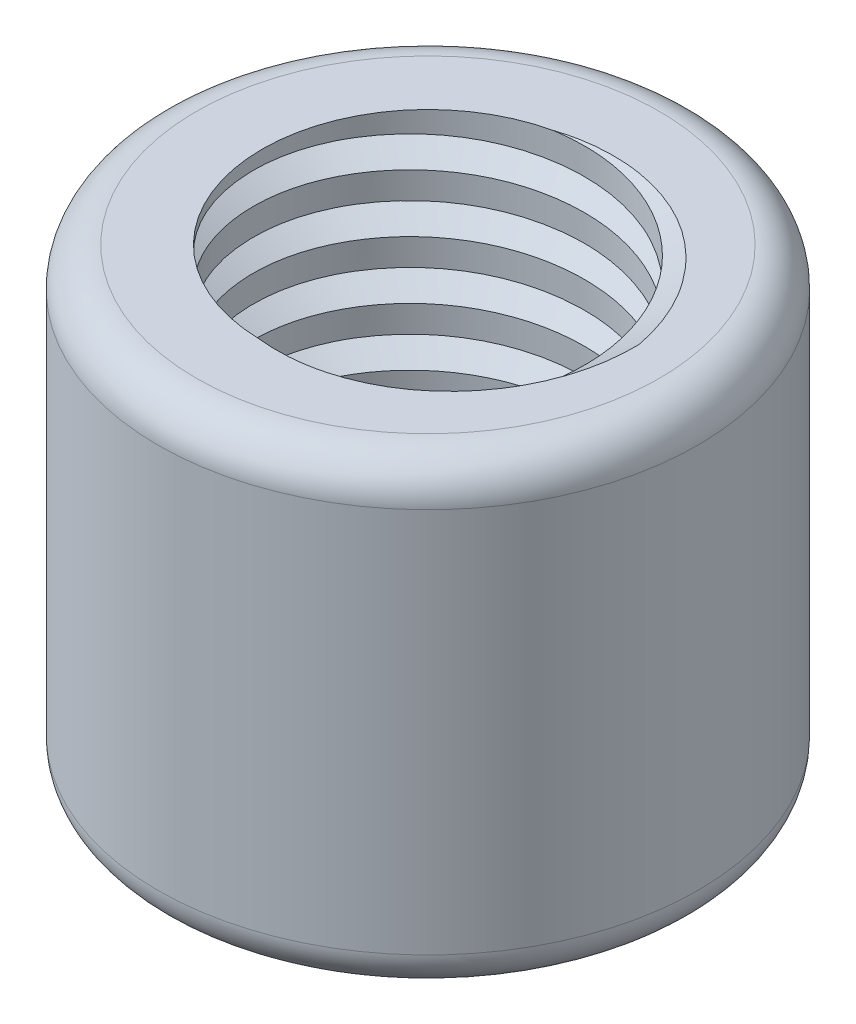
ISO-10303-21;
HEADER;
FILE_DESCRIPTION(('STEP AP214'),'2;1');
FILE_NAME('part.step','',(''),(''),'','','');
FILE_SCHEMA(('AUTOMOTIVE_DESIGN { 1 0 10303 214 1 1 1 1 }'));
ENDSEC;
DATA;
#1=APPLICATION_CONTEXT('core data for automotive mechanical design processes');
#2=APPLICATION_PROTOCOL_DEFINITION('international standard','automotive_design',2000,#1);
#3=PRODUCT_CONTEXT('',#1,'mechanical');
#4=PRODUCT('Part','Part','',(#3));
#5=PRODUCT_RELATED_PRODUCT_CATEGORY('part','',(#4));
#6=PRODUCT_DEFINITION_FORMATION('','',#4);
#7=PRODUCT_DEFINITION_CONTEXT('part definition',#1,'design');
#8=PRODUCT_DEFINITION('design','',#6,#7);
#9=PRODUCT_DEFINITION_SHAPE('','',#8);
#10=(LENGTH_UNIT() NAMED_UNIT(*) SI_UNIT(.MILLI.,.METRE.));
#11=(NAMED_UNIT(*) PLANE_ANGLE_UNIT() SI_UNIT($,.RADIAN.));
#12=(NAMED_UNIT(*) SI_UNIT($,.STERADIAN.) SOLID_ANGLE_UNIT());
#13=UNCERTAINTY_MEASURE_WITH_UNIT(LENGTH_MEASURE(1.E-05),#10,'distance_accuracy_value','');
#14=(GEOMETRIC_REPRESENTATION_CONTEXT(3) GLOBAL_UNCERTAINTY_ASSIGNED_CONTEXT((#13)) GLOBAL_UNIT_ASSIGNED_CONTEXT((#10,
#11,#12)) REPRESENTATION_CONTEXT('',''));
#15=CARTESIAN_POINT('',(0.,0.,0.));
#16=DIRECTION('',(0.,0.,1.));
#17=DIRECTION('',(1.,0.,0.));
#18=AXIS2_PLACEMENT_3D('',#15,#16,#17);
#19=CARTESIAN_POINT('',(0.,6.,0.));
#20=DIRECTION('',(0.,1.,0.));
#21=DIRECTION('',(0.,0.,1.));
#22=AXIS2_PLACEMENT_3D('',#19,#20,#21);
#23=PLANE('',#22);
#24=CARTESIAN_POINT('',(4.97565663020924,6.,-0.492789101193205));
#25=CARTESIAN_POINT('',(4.95148155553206,6.,-0.625900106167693));
#26=CARTESIAN_POINT('',(4.92172776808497,6.,-0.75799564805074));
#27=CARTESIAN_POINT('',(4.85132528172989,6.,-1.01924892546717));
#28=CARTESIAN_POINT('',(4.81067674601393,6.,-1.14840670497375));
#29=CARTESIAN_POINT('',(4.71873681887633,6.,-1.40290852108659));
#30=CARTESIAN_POINT('',(4.66744317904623,6.,-1.5282517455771));
#31=CARTESIAN_POINT('',(4.55457907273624,6.,-1.77421788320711));
#32=CARTESIAN_POINT('',(4.4930088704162,6.,-1.89484091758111));
#33=CARTESIAN_POINT('',(4.35933869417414,6.,-2.13172865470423));
#34=CARTESIAN_POINT('',(4.28713799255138,6.,-2.24793655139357));
#35=CARTESIAN_POINT('',(4.13319757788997,6.,-2.47385385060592));
#36=CARTESIAN_POINT('',(4.05145741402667,6.,-2.58356294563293));
#37=CARTESIAN_POINT('',(3.87902487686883,6.,-2.79569031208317));
#38=CARTESIAN_POINT('',(3.7883344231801,6.,-2.89811013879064));
#39=CARTESIAN_POINT('',(3.64609778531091,6.,-3.04571270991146));
#40=CARTESIAN_POINT('',(3.59764637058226,6.,-3.09391404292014));
#41=CARTESIAN_POINT('',(3.49875083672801,6.,-3.18823456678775));
#42=CARTESIAN_POINT('',(3.44830668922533,6.,-3.23435372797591));
#43=CARTESIAN_POINT('',(3.34538220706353,6.,-3.32455158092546));
#44=CARTESIAN_POINT('',(3.29289671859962,6.,-3.36862439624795));
#45=CARTESIAN_POINT('',(3.18596919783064,6.,-3.45432791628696));
#46=CARTESIAN_POINT('',(3.13152723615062,6.,-3.49595870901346));
#47=CARTESIAN_POINT('',(3.02082392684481,6.,-3.57671729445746));
#48=CARTESIAN_POINT('',(2.96456273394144,6.,-3.61584529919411));
#49=CARTESIAN_POINT('',(2.85032810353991,6.,-3.69151290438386));
#50=CARTESIAN_POINT('',(2.79235458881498,6.,-3.72805238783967));
#51=CARTESIAN_POINT('',(2.61610201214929,6.,-3.83363799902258));
#52=CARTESIAN_POINT('',(2.49540825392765,6.,-3.89871157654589));
#53=CARTESIAN_POINT('',(2.24863764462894,6.,-4.01766596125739));
#54=CARTESIAN_POINT('',(2.12256050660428,6.,-4.07154617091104));
#55=CARTESIAN_POINT('',(1.87441896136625,6.,-4.16453911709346));
#56=CARTESIAN_POINT('',(1.75262934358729,6.,-4.20438593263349));
#57=CARTESIAN_POINT('',(1.50611733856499,6.,-4.27362849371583));
#58=CARTESIAN_POINT('',(1.38139503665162,6.,-4.30302454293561));
#59=CARTESIAN_POINT('',(1.12985063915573,6.,-4.35116456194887));
#60=CARTESIAN_POINT('',(1.00302759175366,6.,-4.36990355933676));
#61=CARTESIAN_POINT('',(0.748234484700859,6.,-4.39658435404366));
#62=CARTESIAN_POINT('',(0.620264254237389,6.,-4.40452451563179));
#63=CARTESIAN_POINT('',(0.364478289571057,6.,-4.40951513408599));
#64=CARTESIAN_POINT('',(0.23666322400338,6.,-4.40659783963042));
#65=CARTESIAN_POINT('',(0.0454984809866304,6.,-4.39420200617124));
#66=CARTESIAN_POINT('',(-0.0181329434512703,6.,-4.38873299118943));
#67=CARTESIAN_POINT('',(-0.145081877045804,6.,-4.3749076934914));
#68=CARTESIAN_POINT('',(-0.208399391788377,6.,-4.36655146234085));
#69=CARTESIAN_POINT('',(-0.397555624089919,6.,-4.33720037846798));
#70=CARTESIAN_POINT('',(-0.522754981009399,6.,-4.3119131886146));
#71=CARTESIAN_POINT('',(-0.770333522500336,6.,-4.25008378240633));
#72=CARTESIAN_POINT('',(-0.892712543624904,6.,-4.21354091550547));
#73=CARTESIAN_POINT('',(-1.12777814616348,6.,-4.13154430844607));
#74=CARTESIAN_POINT('',(-1.24064648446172,6.,-4.08661130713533));
#75=CARTESIAN_POINT('',(-1.46207646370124,6.,-3.98715919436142));
#76=CARTESIAN_POINT('',(-1.57063817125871,6.,-3.93264023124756));
#77=CARTESIAN_POINT('',(-1.7827434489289,6.,-3.81436564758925));
#78=CARTESIAN_POINT('',(-1.88628212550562,6.,-3.75060125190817));
#79=CARTESIAN_POINT('',(-2.08745318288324,6.,-3.61434826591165));
#80=CARTESIAN_POINT('',(-2.18508552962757,6.,-3.54185962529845));
#81=CARTESIAN_POINT('',(-2.37134216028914,6.,-3.390640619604));
#82=CARTESIAN_POINT('',(-2.46013116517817,6.,-3.31211289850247));
#83=CARTESIAN_POINT('',(-2.63076304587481,6.,-3.14781806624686));
#84=CARTESIAN_POINT('',(-2.71260565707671,6.,-3.06205067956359));
#85=CARTESIAN_POINT('',(-2.829728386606,6.,-2.92857144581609));
#86=CARTESIAN_POINT('',(-2.86781412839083,6.,-2.88329391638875));
#87=CARTESIAN_POINT('',(-2.94190328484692,6.,-2.79106780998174));
#88=CARTESIAN_POINT('',(-2.97790680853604,6.,-2.74411932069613));
#89=CARTESIAN_POINT('',(-3.08262964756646,6.,-2.60089660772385));
#90=CARTESIAN_POINT('',(-3.14809264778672,6.,-2.50220950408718));
#91=CARTESIAN_POINT('',(-3.26791402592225,6.,-2.302349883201));
#92=CARTESIAN_POINT('',(-3.32254704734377,6.,-2.2013412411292));
#93=CARTESIAN_POINT('',(-3.42266918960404,6.,-1.99486587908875));
#94=CARTESIAN_POINT('',(-3.46815706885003,6.,-1.88939855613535));
#95=CARTESIAN_POINT('',(-3.5496579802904,6.,-1.67473302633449));
#96=CARTESIAN_POINT('',(-3.58566050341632,6.,-1.56553083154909));
#97=CARTESIAN_POINT('',(-3.64783786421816,6.,-1.34436445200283));
#98=CARTESIAN_POINT('',(-3.67401295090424,6.,-1.23240033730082));
#99=CARTESIAN_POINT('',(-3.71530267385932,6.,-1.012053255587));
#100=CARTESIAN_POINT('',(-3.7308906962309,6.,-0.903758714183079));
#101=CARTESIAN_POINT('',(-3.75287903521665,6.,-0.686215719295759));
#102=CARTESIAN_POINT('',(-3.75927713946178,6.,-0.576967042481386));
#103=CARTESIAN_POINT('',(-3.76279630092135,6.,-0.358608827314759));
#104=CARTESIAN_POINT('',(-3.75994280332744,6.,-0.249499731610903));
#105=CARTESIAN_POINT('',(-3.74886437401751,6.,-0.0863593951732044));
#106=CARTESIAN_POINT('',(-3.74404002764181,6.,-0.0320763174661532));
#107=CARTESIAN_POINT('',(-3.73197245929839,6.,0.0762216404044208));
#108=CARTESIAN_POINT('',(-3.72472954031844,6.,0.130236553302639));
#109=CARTESIAN_POINT('',(-3.71147309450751,6.,0.214307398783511));
#110=CARTESIAN_POINT('',(-3.70630947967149,6.,0.244500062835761));
#111=CARTESIAN_POINT('',(-3.6952060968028,6.,0.30474134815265));
#112=CARTESIAN_POINT('',(-3.68926635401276,6.,0.33478997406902));
#113=CARTESIAN_POINT('',(-3.68294311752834,6.,0.364758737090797));
#114=B_SPLINE_CURVE_WITH_KNOTS('',3,(#24,#25,#26,#27,#28,#29,#30,#31,#32,#33,#34,#35,#36,#37,
#38,#39,#40,#41,#42,#43,#44,#45,#46,#47,#48,#49,#50,#51,#52,#53,#54,#55,#56,#57,#58,#59,#60,#61,
#62,#63,#64,#65,#66,#67,#68,#69,#70,#71,#72,#73,#74,#75,#76,#77,#78,#79,#80,#81,#82,#83,#84,#85,
#86,#87,#88,#89,#90,#91,#92,#93,#94,#95,#96,#97,#98,#99,#100,#101,#102,#103,#104,#105,#106,#107,
#108,#109,#110,#111,#112,#113),.UNSPECIFIED.,.F.,.F.,(4,2,2,2,2,2,2,2,2,2,2,2,2,2,2,2,2,2,2,2,2,
2,2,2,2,2,2,2,2,2,2,2,2,2,2,2,2,2,2,2,2,2,2,2,4),(0.,0.40574488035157,0.811483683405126,
1.21730827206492,1.62312243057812,2.03306407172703,2.4430250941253,2.85289838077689,
3.05788043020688,3.26286539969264,3.46840660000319,3.67394038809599,3.87945674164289,
4.08498237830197,4.4957278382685,4.90649521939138,5.29046535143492,5.67442432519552,
6.05856230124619,6.44275845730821,6.82581439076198,7.01735940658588,7.2089010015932,
7.59151415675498,7.97414943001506,8.33814696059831,8.70213885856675,9.06647852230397,
9.43082028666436,9.78600571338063,10.141204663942,10.3186535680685,10.4960931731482,
10.850830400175,11.194904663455,11.5390256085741,11.883526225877,12.2280181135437,
12.5558617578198,12.8837843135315,13.2108057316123,13.3742570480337,13.5376878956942,
13.6295719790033,13.721453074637),.UNSPECIFIED.);
#115=CARTESIAN_POINT('',(4.97565663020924,6.,-0.492789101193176));
#116=VERTEX_POINT('',#115);
#117=CARTESIAN_POINT('',(-0.942844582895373,6.,-4.19535982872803));
#118=VERTEX_POINT('',#117);
#119=EDGE_CURVE('E76',#116,#118,#114,.T.);
#120=ORIENTED_EDGE('',*,*,#119,.F.);
#121=CARTESIAN_POINT('',(-3.68294311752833,6.,0.364758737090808));
#122=CARTESIAN_POINT('',(-3.6840863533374,6.,0.471708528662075));
#123=CARTESIAN_POINT('',(-3.68069397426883,6.,0.578704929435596));
#124=CARTESIAN_POINT('',(-3.66491123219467,6.,0.792023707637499));
#125=CARTESIAN_POINT('',(-3.65252158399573,6.,0.898346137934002));
#126=CARTESIAN_POINT('',(-3.61884519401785,6.,1.10939471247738));
#127=CARTESIAN_POINT('',(-3.5975729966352,6.,1.21412317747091));
#128=CARTESIAN_POINT('',(-3.54628861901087,6.,1.42141846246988));
#129=CARTESIAN_POINT('',(-3.5162763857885,6.,1.52398526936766));
#130=CARTESIAN_POINT('',(-3.44769680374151,6.,1.7263174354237));
#131=CARTESIAN_POINT('',(-3.40912199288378,6.,1.82608026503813));
#132=CARTESIAN_POINT('',(-3.32371213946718,6.,2.02200445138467));
#133=CARTESIAN_POINT('',(-3.27687722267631,6.,2.11816586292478));
#134=CARTESIAN_POINT('',(-3.17529168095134,6.,2.30618814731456));
#135=CARTESIAN_POINT('',(-3.12054225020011,6.,2.39804966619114));
#136=CARTESIAN_POINT('',(-3.00352131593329,6.,2.57686636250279));
#137=CARTESIAN_POINT('',(-2.94124997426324,6.,2.66382164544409));
#138=CARTESIAN_POINT('',(-2.84256477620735,6.,2.78999609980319));
#139=CARTESIAN_POINT('',(-2.80881073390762,6.,2.83132218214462));
#140=CARTESIAN_POINT('',(-2.73973220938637,6.,2.91264089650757));
#141=CARTESIAN_POINT('',(-2.70440767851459,6.,2.95263348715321));
#142=CARTESIAN_POINT('',(-2.59614461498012,6.,3.07051439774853));
#143=CARTESIAN_POINT('',(-2.52090883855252,6.,3.14631575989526));
#144=CARTESIAN_POINT('',(-2.3647396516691,6.,3.29191118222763));
#145=CARTESIAN_POINT('',(-2.28380188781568,6.,3.36170055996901));
#146=CARTESIAN_POINT('',(-2.11676201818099,6.,3.49479014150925));
#147=CARTESIAN_POINT('',(-2.03066019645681,6.,3.55809070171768));
#148=CARTESIAN_POINT('',(-1.84666889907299,6.,3.68265522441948));
#149=CARTESIAN_POINT('',(-1.74838879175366,6.,3.74334320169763));
#150=CARTESIAN_POINT('',(-1.54708820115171,6.,3.85627204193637));
#151=CARTESIAN_POINT('',(-1.44406756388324,6.,3.90851263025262));
#152=CARTESIAN_POINT('',(-1.23407919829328,6.,4.00415019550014));
#153=CARTESIAN_POINT('',(-1.127114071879,6.,4.04755288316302));
#154=CARTESIAN_POINT('',(-0.909941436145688,6.,4.12525397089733));
#155=CARTESIAN_POINT('',(-0.799734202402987,6.,4.15955314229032));
#156=CARTESIAN_POINT('',(-0.576239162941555,6.,4.21897015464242));
#157=CARTESIAN_POINT('',(-0.462938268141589,6.,4.24403907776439));
#158=CARTESIAN_POINT('',(-0.291738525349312,6.,4.27444931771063));
#159=CARTESIAN_POINT('',(-0.234456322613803,6.,4.28338790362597));
#160=CARTESIAN_POINT('',(-0.119560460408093,6.,4.29883109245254));
#161=CARTESIAN_POINT('',(-0.0619467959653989,6.,4.30533565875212));
#162=CARTESIAN_POINT('',(0.0535411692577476,6.,4.31600327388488));
#163=CARTESIAN_POINT('',(0.111415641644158,6.,4.32016444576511));
#164=CARTESIAN_POINT('',(0.227278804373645,6.,4.3262495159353));
#165=CARTESIAN_POINT('',(0.285267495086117,6.,4.32817340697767));
#166=CARTESIAN_POINT('',(0.459283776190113,6.,4.33053811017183));
#167=CARTESIAN_POINT('',(0.575376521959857,6.,4.32757332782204));
#168=CARTESIAN_POINT('',(0.81132889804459,6.,4.31231173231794));
#169=CARTESIAN_POINT('',(0.931165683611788,6.,4.29966758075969));
#170=CARTESIAN_POINT('',(1.16941701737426,6.,4.26471117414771));
#171=CARTESIAN_POINT('',(1.28783164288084,6.,4.24239944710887));
#172=CARTESIAN_POINT('',(1.52239350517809,6.,4.18827172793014));
#173=CARTESIAN_POINT('',(1.63854205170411,6.,4.15646141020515));
#174=CARTESIAN_POINT('',(1.86788347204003,6.,4.0835418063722));
#175=CARTESIAN_POINT('',(1.98107629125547,6.,4.04243234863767));
#176=CARTESIAN_POINT('',(2.2082503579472,6.,3.94934715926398));
#177=CARTESIAN_POINT('',(2.32207990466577,6.,3.89700060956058));
#178=CARTESIAN_POINT('',(2.54491763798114,6.,3.78292169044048));
#179=CARTESIAN_POINT('',(2.65392616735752,6.,3.72118998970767));
#180=CARTESIAN_POINT('',(2.86643675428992,6.,3.5887304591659));
#181=CARTESIAN_POINT('',(2.96993572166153,6.,3.51799765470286));
#182=CARTESIAN_POINT('',(3.12042980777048,6.,3.4055783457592));
#183=CARTESIAN_POINT('',(3.16980905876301,6.,3.36704572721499));
#184=CARTESIAN_POINT('',(3.26690282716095,6.,3.28793558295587));
#185=CARTESIAN_POINT('',(3.31461727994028,6.,3.24735797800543));
#186=CARTESIAN_POINT('',(3.45564938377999,6.,3.12259654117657));
#187=CARTESIAN_POINT('',(3.5465302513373,6.,3.03562960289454));
#188=CARTESIAN_POINT('',(3.72113466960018,6.,2.85480641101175));
#189=CARTESIAN_POINT('',(3.80485843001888,6.,2.76095035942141));
#190=CARTESIAN_POINT('',(3.96466516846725,6.,2.56692336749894));
#191=CARTESIAN_POINT('',(4.04074733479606,6.,2.46675175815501));
#192=CARTESIAN_POINT('',(4.18477817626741,6.,2.26072494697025));
#193=CARTESIAN_POINT('',(4.25272680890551,6.,2.15486971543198));
#194=CARTESIAN_POINT('',(4.384497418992,6.,1.93059692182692));
#195=CARTESIAN_POINT('',(4.44770467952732,6.,1.81181753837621));
#196=CARTESIAN_POINT('',(4.5638850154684,6.,1.56935364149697));
#197=CARTESIAN_POINT('',(4.61685788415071,6.,1.44566902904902));
#198=CARTESIAN_POINT('',(4.7121922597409,6.,1.19429008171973));
#199=CARTESIAN_POINT('',(4.75455460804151,6.,1.06659606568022));
#200=CARTESIAN_POINT('',(4.82835575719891,6.,0.808156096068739));
#201=CARTESIAN_POINT('',(4.85980086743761,6.,0.677411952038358));
#202=CARTESIAN_POINT('',(4.90248047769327,6.,0.460131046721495));
#203=CARTESIAN_POINT('',(4.91693379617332,6.,0.374211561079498));
#204=CARTESIAN_POINT('',(4.94112319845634,6.,0.201713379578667));
#205=CARTESIAN_POINT('',(4.95085996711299,6.,0.115134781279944));
#206=CARTESIAN_POINT('',(4.96193367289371,6.,-0.0149493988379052));
#207=CARTESIAN_POINT('',(4.96503529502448,6.,-0.0583131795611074));
#208=CARTESIAN_POINT('',(4.97014574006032,6.,-0.145105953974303));
#209=CARTESIAN_POINT('',(4.97215456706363,6.,-0.18853494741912));
#210=CARTESIAN_POINT('',(4.97505946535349,6.,-0.275432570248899));
#211=CARTESIAN_POINT('',(4.97595547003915,6.,-0.318901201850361));
#212=CARTESIAN_POINT('',(4.9766376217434,6.,-0.405846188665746));
#213=CARTESIAN_POINT('',(4.97642379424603,6.,-0.449322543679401));
#214=CARTESIAN_POINT('',(4.97565663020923,6.,-0.492789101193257));
#215=B_SPLINE_CURVE_WITH_KNOTS('',3,(#121,#122,#123,#124,#125,#126,#127,#128,#129,#130,#131,
#132,#133,#134,#135,#136,#137,#138,#139,#140,#141,#142,#143,#144,#145,#146,#147,#148,#149,#150,
#151,#152,#153,#154,#155,#156,#157,#158,#159,#160,#161,#162,#163,#164,#165,#166,#167,#168,#169,
#170,#171,#172,#173,#174,#175,#176,#177,#178,#179,#180,#181,#182,#183,#184,#185,#186,#187,#188,
#189,#190,#191,#192,#193,#194,#195,#196,#197,#198,#199,#200,#201,#202,#203,#204,#205,#206,#207,
#208,#209,#210,#211,#212,#213,#214),.UNSPECIFIED.,.F.,.F.,(4,2,2,2,2,2,2,2,2,2,2,2,2,2,2,2,2,2,
2,2,2,2,2,2,2,2,2,2,2,2,2,2,2,2,2,2,2,2,2,2,2,2,2,2,2,2,4),(0.,0.320770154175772,
0.641514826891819,0.961736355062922,1.28195982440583,1.60246346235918,1.92296222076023,
2.24341267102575,2.56385622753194,2.72389583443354,2.8839404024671,3.2039918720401,
3.52429040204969,3.84457132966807,4.19068291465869,4.53680575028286,4.88270421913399,
5.22857337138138,5.57625001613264,5.75013371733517,5.92402003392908,6.09804542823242,
6.27207138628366,6.62007839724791,6.98119513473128,7.34229215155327,7.70317388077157,
8.06406227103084,8.43947882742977,8.81486864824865,9.19046684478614,9.37832150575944,
9.56618345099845,9.94312712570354,10.3200597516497,10.6970323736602,11.0740069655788,
11.4771731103,11.8803473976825,12.2834897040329,12.6863986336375,12.9476644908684,
13.208892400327,13.3393045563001,13.4697162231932,13.6001356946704,13.7305521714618),.UNSPECIFIED.);
#216=CARTESIAN_POINT('',(-0.120547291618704,5.99999999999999,4.29830994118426));
#217=VERTEX_POINT('',#216);
#218=EDGE_CURVE('E65',#217,#116,#215,.T.);
#219=ORIENTED_EDGE('',*,*,#218,.F.);
#220=CARTESIAN_POINT('',(0.,6.,0.));
#221=DIRECTION('',(0.,1.,0.));
#222=DIRECTION('',(0.,0.,1.));
#223=AXIS2_PLACEMENT_3D('',#220,#221,#222);
#224=CIRCLE('',#223,4.3);
#225=EDGE_CURVE('E79',#118,#217,#224,.T.);
#226=ORIENTED_EDGE('',*,*,#225,.F.);
#227=EDGE_LOOP('',(#120,#219,#226));
#228=FACE_BOUND('',#227,.T.);
#229=CARTESIAN_POINT('',(0.,6.,0.));
#230=DIRECTION('',(0.,1.,0.));
#231=DIRECTION('',(0.,0.,1.));
#232=AXIS2_PLACEMENT_3D('',#229,#230,#231);
#233=CIRCLE('',#232,6.);
#234=CARTESIAN_POINT('',(0.,6.,6.));
#235=VERTEX_POINT('',#234);
#236=EDGE_CURVE('E204',#235,#235,#233,.T.);
#237=ORIENTED_EDGE('',*,*,#236,.T.);
#238=EDGE_LOOP('',(#237));
#239=FACE_BOUND('',#238,.T.);
#240=ADVANCED_FACE('F31',(#228,#239),#23,.T.);
#241=CARTESIAN_POINT('',(0.,-6.,0.));
#242=DIRECTION('',(0.,1.,0.));
#243=DIRECTION('',(0.,0.,1.));
#244=AXIS2_PLACEMENT_3D('',#241,#242,#243);
#245=PLANE('',#244);
#246=CARTESIAN_POINT('',(0.,-6.,0.));
#247=DIRECTION('',(0.,1.,0.));
#248=DIRECTION('',(0.,0.,1.));
#249=AXIS2_PLACEMENT_3D('',#246,#247,#248);
#250=CIRCLE('',#249,6.);
#251=CARTESIAN_POINT('',(0.,-6.,6.));
#252=VERTEX_POINT('',#251);
#253=EDGE_CURVE('E198',#252,#252,#250,.F.);
#254=ORIENTED_EDGE('',*,*,#253,.T.);
#255=EDGE_LOOP('',(#254));
#256=FACE_BOUND('',#255,.T.);
#257=CARTESIAN_POINT('',(-3.68294311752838,-6.,0.364758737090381));
#258=CARTESIAN_POINT('',(-3.68408635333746,-6.,0.471708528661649));
#259=CARTESIAN_POINT('',(-3.68069397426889,-6.,0.578704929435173));
#260=CARTESIAN_POINT('',(-3.66491123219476,-6.,0.79202370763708));
#261=CARTESIAN_POINT('',(-3.65252158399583,-6.,0.898346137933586));
#262=CARTESIAN_POINT('',(-3.61884519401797,-6.,1.10939471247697));
#263=CARTESIAN_POINT('',(-3.59757299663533,-6.,1.21412317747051));
#264=CARTESIAN_POINT('',(-3.54628861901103,-6.,1.42141846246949));
#265=CARTESIAN_POINT('',(-3.51627638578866,-6.,1.52398526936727));
#266=CARTESIAN_POINT('',(-3.4476968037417,-6.,1.72631743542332));
#267=CARTESIAN_POINT('',(-3.40912199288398,-6.,1.82608026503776));
#268=CARTESIAN_POINT('',(-3.3237121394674,-6.,2.02200445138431));
#269=CARTESIAN_POINT('',(-3.27687722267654,-6.,2.11816586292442));
#270=CARTESIAN_POINT('',(-3.17529168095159,-6.,2.30618814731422));
#271=CARTESIAN_POINT('',(-3.12054225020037,-6.,2.3980496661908));
#272=CARTESIAN_POINT('',(-3.00352131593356,-6.,2.57686636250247));
#273=CARTESIAN_POINT('',(-2.94124997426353,-6.,2.66382164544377));
#274=CARTESIAN_POINT('',(-2.84256477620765,-6.,2.78999609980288));
#275=CARTESIAN_POINT('',(-2.80881073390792,-6.,2.83132218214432));
#276=CARTESIAN_POINT('',(-2.73973220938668,-6.,2.91264089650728));
#277=CARTESIAN_POINT('',(-2.70440767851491,-6.,2.95263348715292));
#278=CARTESIAN_POINT('',(-2.59614461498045,-6.,3.07051439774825));
#279=CARTESIAN_POINT('',(-2.52090883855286,-6.,3.14631575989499));
#280=CARTESIAN_POINT('',(-2.36473965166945,-6.,3.29191118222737));
#281=CARTESIAN_POINT('',(-2.28380188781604,-6.,3.36170055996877));
#282=CARTESIAN_POINT('',(-2.11676201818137,-6.,3.49479014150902));
#283=CARTESIAN_POINT('',(-2.03066019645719,-6.,3.55809070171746));
#284=CARTESIAN_POINT('',(-1.84666889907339,-6.,3.68265522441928));
#285=CARTESIAN_POINT('',(-1.74838879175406,-6.,3.74334320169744));
#286=CARTESIAN_POINT('',(-1.54708820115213,-6.,3.8562720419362));
#287=CARTESIAN_POINT('',(-1.44406756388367,-6.,3.90851263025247));
#288=CARTESIAN_POINT('',(-1.23407919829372,-6.,4.0041501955));
#289=CARTESIAN_POINT('',(-1.12711407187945,-6.,4.04755288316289));
#290=CARTESIAN_POINT('',(-0.909941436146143,-6.,4.12525397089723));
#291=CARTESIAN_POINT('',(-0.799734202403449,-6.00000000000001,4.15955314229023));
#292=CARTESIAN_POINT('',(-0.576239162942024,-6.00000000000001,4.21897015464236));
#293=CARTESIAN_POINT('',(-0.462938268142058,-6.,4.24403907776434));
#294=CARTESIAN_POINT('',(-0.291738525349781,-6.,4.27444931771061));
#295=CARTESIAN_POINT('',(-0.234456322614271,-6.,4.28338790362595));
#296=CARTESIAN_POINT('',(-0.119560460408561,-6.,4.29883109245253));
#297=CARTESIAN_POINT('',(-0.0619467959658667,-6.,4.30533565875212));
#298=CARTESIAN_POINT('',(0.0535411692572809,-6.,4.31600327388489));
#299=CARTESIAN_POINT('',(0.111415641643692,-6.,4.32016444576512));
#300=CARTESIAN_POINT('',(0.22727880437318,-6.,4.32624951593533));
#301=CARTESIAN_POINT('',(0.285267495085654,-6.,4.3281734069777));
#302=CARTESIAN_POINT('',(0.459283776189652,-6.,4.33053811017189));
#303=CARTESIAN_POINT('',(0.575376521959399,-6.,4.3275733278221));
#304=CARTESIAN_POINT('',(0.811328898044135,-6.,4.31231173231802));
#305=CARTESIAN_POINT('',(0.931165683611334,-6.,4.29966758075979));
#306=CARTESIAN_POINT('',(1.16941701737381,-6.,4.26471117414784));
#307=CARTESIAN_POINT('',(1.28783164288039,-6.,4.24239944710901));
#308=CARTESIAN_POINT('',(1.52239350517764,-6.,4.1882717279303));
#309=CARTESIAN_POINT('',(1.63854205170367,-6.,4.15646141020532));
#310=CARTESIAN_POINT('',(1.86788347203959,-6.,4.0835418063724));
#311=CARTESIAN_POINT('',(1.98107629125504,-6.,4.04243234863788));
#312=CARTESIAN_POINT('',(2.20825035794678,-6.,3.94934715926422));
#313=CARTESIAN_POINT('',(2.32207990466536,-6.,3.89700060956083));
#314=CARTESIAN_POINT('',(2.54491763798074,-6.,3.78292169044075));
#315=CARTESIAN_POINT('',(2.65392616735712,-6.,3.72118998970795));
#316=CARTESIAN_POINT('',(2.86643675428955,-6.,3.5887304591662));
#317=CARTESIAN_POINT('',(2.96993572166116,-6.,3.51799765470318));
#318=CARTESIAN_POINT('',(3.12042980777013,-6.,3.40557834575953));
#319=CARTESIAN_POINT('',(3.16980905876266,-6.,3.36704572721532));
#320=CARTESIAN_POINT('',(3.2669028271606,-6.,3.28793558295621));
#321=CARTESIAN_POINT('',(3.31461727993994,-6.,3.24735797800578));
#322=CARTESIAN_POINT('',(3.45564938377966,-6.,3.12259654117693));
#323=CARTESIAN_POINT('',(3.54653025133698,-6.,3.03562960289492));
#324=CARTESIAN_POINT('',(3.72113466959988,-6.,2.85480641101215));
#325=CARTESIAN_POINT('',(3.80485843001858,-6.,2.76095035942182));
#326=CARTESIAN_POINT('',(3.96466516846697,-6.,2.56692336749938));
#327=CARTESIAN_POINT('',(4.04074733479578,-6.,2.46675175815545));
#328=CARTESIAN_POINT('',(4.18477817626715,-6.,2.26072494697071));
#329=CARTESIAN_POINT('',(4.25272680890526,-6.,2.15486971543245));
#330=CARTESIAN_POINT('',(4.38449741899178,-6.,1.93059692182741));
#331=CARTESIAN_POINT('',(4.44770467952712,-6.,1.8118175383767));
#332=CARTESIAN_POINT('',(4.56388501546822,-6.,1.56935364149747));
#333=CARTESIAN_POINT('',(4.61685788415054,-6.,1.44566902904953));
#334=CARTESIAN_POINT('',(4.71219225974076,-6.,1.19429008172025));
#335=CARTESIAN_POINT('',(4.7545546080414,-6.,1.06659606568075));
#336=CARTESIAN_POINT('',(4.82835575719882,-6.,0.808156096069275));
#337=CARTESIAN_POINT('',(4.85980086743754,-6.,0.677411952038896));
#338=CARTESIAN_POINT('',(4.90248047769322,-6.,0.460131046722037));
#339=CARTESIAN_POINT('',(4.91693379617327,-6.,0.374211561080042));
#340=CARTESIAN_POINT('',(4.94112319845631,-6.,0.201713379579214));
#341=CARTESIAN_POINT('',(4.95085996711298,-6.,0.115134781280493));
#342=CARTESIAN_POINT('',(4.96193367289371,-6.,-0.0149493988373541));
#343=CARTESIAN_POINT('',(4.96503529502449,-6.,-0.0583131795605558));
#344=CARTESIAN_POINT('',(4.97014574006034,-6.,-0.145105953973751));
#345=CARTESIAN_POINT('',(4.97215456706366,-6.,-0.188534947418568));
#346=CARTESIAN_POINT('',(4.97505946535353,-6.,-0.275432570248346));
#347=CARTESIAN_POINT('',(4.97595547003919,-6.,-0.318901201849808));
#348=CARTESIAN_POINT('',(4.97663762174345,-6.,-0.405846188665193));
#349=CARTESIAN_POINT('',(4.97642379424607,-6.,-0.449322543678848));
#350=CARTESIAN_POINT('',(4.97565663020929,-6.,-0.492789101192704));
#351=B_SPLINE_CURVE_WITH_KNOTS('',3,(#257,#258,#259,#260,#261,#262,#263,#264,#265,#266,#267,
#268,#269,#270,#271,#272,#273,#274,#275,#276,#277,#278,#279,#280,#281,#282,#283,#284,#285,#286,
#287,#288,#289,#290,#291,#292,#293,#294,#295,#296,#297,#298,#299,#300,#301,#302,#303,#304,#305,
#306,#307,#308,#309,#310,#311,#312,#313,#314,#315,#316,#317,#318,#319,#320,#321,#322,#323,#324,
#325,#326,#327,#328,#329,#330,#331,#332,#333,#334,#335,#336,#337,#338,#339,#340,#341,#342,#343,
#344,#345,#346,#347,#348,#349,#350),.UNSPECIFIED.,.F.,.F.,(4,2,2,2,2,2,2,2,2,2,2,2,2,2,2,2,2,2,
2,2,2,2,2,2,2,2,2,2,2,2,2,2,2,2,2,2,2,2,2,2,2,2,2,2,2,2,4),(0.,0.320770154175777,
0.64151482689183,0.961736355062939,1.28195982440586,1.60246346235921,1.92296222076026,
2.24341267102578,2.56385622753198,2.72389583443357,2.88394040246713,3.20399187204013,
3.52429040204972,3.8445713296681,4.19068291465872,4.53680575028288,4.88270421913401,
5.22857337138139,5.57625001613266,5.75013371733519,5.9240200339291,6.09804542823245,
6.27207138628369,6.62007839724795,6.98119513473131,7.34229215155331,7.7031738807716,
8.06406227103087,8.43947882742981,8.81486864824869,9.19046684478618,9.37832150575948,
9.56618345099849,9.94312712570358,10.3200597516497,10.6970323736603,11.0740069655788,
11.4771731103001,11.8803473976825,12.283489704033,12.6863986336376,12.9476644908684,
13.208892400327,13.3393045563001,13.4697162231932,13.6001356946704,13.7305521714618),.UNSPECIFIED.);
#352=CARTESIAN_POINT('',(-0.120547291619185,-6.00000000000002,4.29830994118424));
#353=VERTEX_POINT('',#352);
#354=CARTESIAN_POINT('',(4.97565663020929,-6.,-0.492789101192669));
#355=VERTEX_POINT('',#354);
#356=EDGE_CURVE('E48',#353,#355,#351,.T.);
#357=ORIENTED_EDGE('',*,*,#356,.T.);
#358=CARTESIAN_POINT('',(4.97565663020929,-6.,-0.492789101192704));
#359=CARTESIAN_POINT('',(4.95148155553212,-6.,-0.625900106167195));
#360=CARTESIAN_POINT('',(4.92172776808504,-6.,-0.757995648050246));
#361=CARTESIAN_POINT('',(4.85132528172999,-6.,-1.01924892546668));
#362=CARTESIAN_POINT('',(4.81067674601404,-6.,-1.14840670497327));
#363=CARTESIAN_POINT('',(4.71873681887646,-6.,-1.40290852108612));
#364=CARTESIAN_POINT('',(4.66744317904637,-6.,-1.52825174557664));
#365=CARTESIAN_POINT('',(4.55457907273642,-6.,-1.77421788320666));
#366=CARTESIAN_POINT('',(4.49300887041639,-6.,-1.89484091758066));
#367=CARTESIAN_POINT('',(4.35933869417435,-6.,-2.1317286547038));
#368=CARTESIAN_POINT('',(4.2871379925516,-6.,-2.24793655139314));
#369=CARTESIAN_POINT('',(4.13319757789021,-6.,-2.47385385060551));
#370=CARTESIAN_POINT('',(4.05145741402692,-6.,-2.58356294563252));
#371=CARTESIAN_POINT('',(3.8790248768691,-6.,-2.79569031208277));
#372=CARTESIAN_POINT('',(3.78833442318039,-6.,-2.89811013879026));
#373=CARTESIAN_POINT('',(3.64609778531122,-6.,-3.04571270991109));
#374=CARTESIAN_POINT('',(3.59764637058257,-6.,-3.09391404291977));
#375=CARTESIAN_POINT('',(3.49875083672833,-6.,-3.18823456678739));
#376=CARTESIAN_POINT('',(3.44830668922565,-6.,-3.23435372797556));
#377=CARTESIAN_POINT('',(3.34538220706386,-6.,-3.32455158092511));
#378=CARTESIAN_POINT('',(3.29289671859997,-6.,-3.36862439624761));
#379=CARTESIAN_POINT('',(3.185969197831,-6.,-3.45432791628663));
#380=CARTESIAN_POINT('',(3.13152723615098,-6.,-3.49595870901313));
#381=CARTESIAN_POINT('',(3.02082392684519,-6.,-3.57671729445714));
#382=CARTESIAN_POINT('',(2.96456273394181,-6.,-3.6158452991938));
#383=CARTESIAN_POINT('',(2.8503281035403,-6.,-3.69151290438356));
#384=CARTESIAN_POINT('',(2.79235458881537,-6.,-3.72805238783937));
#385=CARTESIAN_POINT('',(2.6161020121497,-6.,-3.8336379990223));
#386=CARTESIAN_POINT('',(2.49540825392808,-6.,-3.89871157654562));
#387=CARTESIAN_POINT('',(2.24863764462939,-6.,-4.01766596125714));
#388=CARTESIAN_POINT('',(2.12256050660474,-6.,-4.07154617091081));
#389=CARTESIAN_POINT('',(1.87441896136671,-6.,-4.16453911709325));
#390=CARTESIAN_POINT('',(1.75262934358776,-6.,-4.2043859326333));
#391=CARTESIAN_POINT('',(1.50611733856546,-6.,-4.27362849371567));
#392=CARTESIAN_POINT('',(1.38139503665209,-6.,-4.30302454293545));
#393=CARTESIAN_POINT('',(1.1298506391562,-6.,-4.35116456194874));
#394=CARTESIAN_POINT('',(1.00302759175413,-6.,-4.36990355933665));
#395=CARTESIAN_POINT('',(0.748234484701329,-6.,-4.39658435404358));
#396=CARTESIAN_POINT('',(0.620264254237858,-6.,-4.40452451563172));
#397=CARTESIAN_POINT('',(0.364478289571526,-6.,-4.40951513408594));
#398=CARTESIAN_POINT('',(0.23666322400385,-6.,-4.40659783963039));
#399=CARTESIAN_POINT('',(0.0454984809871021,-6.,-4.39420200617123));
#400=CARTESIAN_POINT('',(-0.0181329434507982,-6.,-4.38873299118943));
#401=CARTESIAN_POINT('',(-0.145081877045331,-6.,-4.37490769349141));
#402=CARTESIAN_POINT('',(-0.208399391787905,-6.,-4.36655146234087));
#403=CARTESIAN_POINT('',(-0.397555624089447,-6.,-4.33720037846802));
#404=CARTESIAN_POINT('',(-0.522754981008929,-6.,-4.31191318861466));
#405=CARTESIAN_POINT('',(-0.770333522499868,-6.,-4.25008378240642));
#406=CARTESIAN_POINT('',(-0.892712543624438,-6.,-4.21354091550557));
#407=CARTESIAN_POINT('',(-1.12777814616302,-6.,-4.13154430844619));
#408=CARTESIAN_POINT('',(-1.24064648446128,-6.,-4.08661130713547));
#409=CARTESIAN_POINT('',(-1.46207646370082,-6.,-3.98715919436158));
#410=CARTESIAN_POINT('',(-1.57063817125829,-6.,-3.93264023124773));
#411=CARTESIAN_POINT('',(-1.78274344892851,-6.,-3.81436564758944));
#412=CARTESIAN_POINT('',(-1.88628212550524,-6.,-3.75060125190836));
#413=CARTESIAN_POINT('',(-2.08745318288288,-6.,-3.61434826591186));
#414=CARTESIAN_POINT('',(-2.18508552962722,-6.,-3.54185962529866));
#415=CARTESIAN_POINT('',(-2.37134216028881,-6.,-3.39064061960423));
#416=CARTESIAN_POINT('',(-2.46013116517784,-6.,-3.31211289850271));
#417=CARTESIAN_POINT('',(-2.6307630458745,-6.,-3.14781806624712));
#418=CARTESIAN_POINT('',(-2.7126056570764,-6.,-3.06205067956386));
#419=CARTESIAN_POINT('',(-2.8297283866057,-6.,-2.92857144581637));
#420=CARTESIAN_POINT('',(-2.86781412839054,-6.,-2.88329391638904));
#421=CARTESIAN_POINT('',(-2.94190328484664,-6.,-2.79106780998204));
#422=CARTESIAN_POINT('',(-2.97790680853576,-6.,-2.74411932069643));
#423=CARTESIAN_POINT('',(-3.08262964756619,-6.,-2.60089660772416));
#424=CARTESIAN_POINT('',(-3.14809264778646,-6.,-2.5022095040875));
#425=CARTESIAN_POINT('',(-3.26791402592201,-6.,-2.30234988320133));
#426=CARTESIAN_POINT('',(-3.32254704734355,-6.,-2.20134124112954));
#427=CARTESIAN_POINT('',(-3.42266918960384,-6.,-1.9948658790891));
#428=CARTESIAN_POINT('',(-3.46815706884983,-6.,-1.8893985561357));
#429=CARTESIAN_POINT('',(-3.54965798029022,-6.,-1.67473302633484));
#430=CARTESIAN_POINT('',(-3.58566050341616,-6.,-1.56553083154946));
#431=CARTESIAN_POINT('',(-3.64783786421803,-6.,-1.3443644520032));
#432=CARTESIAN_POINT('',(-3.67401295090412,-6.,-1.2324003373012));
#433=CARTESIAN_POINT('',(-3.71530267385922,-6.,-1.01205325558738));
#434=CARTESIAN_POINT('',(-3.73089069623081,-6.,-0.903758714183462));
#435=CARTESIAN_POINT('',(-3.75287903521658,-6.,-0.686215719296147));
#436=CARTESIAN_POINT('',(-3.75927713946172,-6.,-0.576967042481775));
#437=CARTESIAN_POINT('',(-3.76279630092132,-6.,-0.358608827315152));
#438=CARTESIAN_POINT('',(-3.75994280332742,-6.,-0.249499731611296));
#439=CARTESIAN_POINT('',(-3.7488643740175,-6.,-0.0863593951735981));
#440=CARTESIAN_POINT('',(-3.74404002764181,-6.,-0.0320763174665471));
#441=CARTESIAN_POINT('',(-3.73197245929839,-6.,0.0762216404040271));
#442=CARTESIAN_POINT('',(-3.72472954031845,-6.,0.130236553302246));
#443=CARTESIAN_POINT('',(-3.71147309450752,-6.,0.214307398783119));
#444=CARTESIAN_POINT('',(-3.70630947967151,-6.,0.244500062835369));
#445=CARTESIAN_POINT('',(-3.69520609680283,-6.,0.304741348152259));
#446=CARTESIAN_POINT('',(-3.68926635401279,-6.,0.33478997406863));
#447=CARTESIAN_POINT('',(-3.68294311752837,-6.,0.364758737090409));
#448=B_SPLINE_CURVE_WITH_KNOTS('',3,(#358,#359,#360,#361,#362,#363,#364,#365,#366,#367,#368,
#369,#370,#371,#372,#373,#374,#375,#376,#377,#378,#379,#380,#381,#382,#383,#384,#385,#386,#387,
#388,#389,#390,#391,#392,#393,#394,#395,#396,#397,#398,#399,#400,#401,#402,#403,#404,#405,#406,
#407,#408,#409,#410,#411,#412,#413,#414,#415,#416,#417,#418,#419,#420,#421,#422,#423,#424,#425,
#426,#427,#428,#429,#430,#431,#432,#433,#434,#435,#436,#437,#438,#439,#440,#441,#442,#443,#444,
#445,#446,#447),.UNSPECIFIED.,.F.,.F.,(4,2,2,2,2,2,2,2,2,2,2,2,2,2,2,2,2,2,2,2,2,2,2,2,2,2,2,2,
2,2,2,2,2,2,2,2,2,2,2,2,2,2,2,2,4),(0.,0.405744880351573,0.811483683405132,1.21730827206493,
1.62312243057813,2.03306407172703,2.44302509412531,2.85289838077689,3.05788043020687,
3.26286539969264,3.46840660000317,3.67394038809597,3.87945674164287,4.08498237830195,
4.49572783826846,4.90649521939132,5.29046535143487,5.67442432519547,6.05856230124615,
6.44275845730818,6.82581439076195,7.01735940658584,7.20890100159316,7.59151415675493,
7.97414943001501,8.33814696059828,8.70213885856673,9.06647852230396,9.43082028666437,
9.78600571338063,10.141204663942,10.3186535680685,10.4960931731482,10.850830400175,
11.194904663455,11.5390256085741,11.883526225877,12.2280181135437,12.5558617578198,
12.8837843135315,13.2108057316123,13.3742570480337,13.5376878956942,13.6295719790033,
13.721453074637),.UNSPECIFIED.);
#449=CARTESIAN_POINT('',(-0.942844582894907,-6.,-4.19535982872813));
#450=VERTEX_POINT('',#449);
#451=EDGE_CURVE('E73',#355,#450,#448,.T.);
#452=ORIENTED_EDGE('',*,*,#451,.T.);
#453=CARTESIAN_POINT('',(0.,-6.,0.));
#454=DIRECTION('',(0.,1.,0.));
#455=DIRECTION('',(0.,0.,1.));
#456=AXIS2_PLACEMENT_3D('',#453,#454,#455);
#457=CIRCLE('',#456,4.3);
#458=EDGE_CURVE('E80',#450,#353,#457,.T.);
#459=ORIENTED_EDGE('',*,*,#458,.T.);
#460=EDGE_LOOP('',(#357,#452,#459));
#461=FACE_BOUND('',#460,.T.);
#462=ADVANCED_FACE('F130',(#256,#461),#245,.F.);
#463=CARTESIAN_POINT('',(0.,6.,0.));
#464=DIRECTION('',(0.,-1.,0.));
#465=DIRECTION('',(0.,0.,-1.));
#466=AXIS2_PLACEMENT_3D('',#463,#464,#465);
#467=CYLINDRICAL_SURFACE('',#466,7.);
#468=CARTESIAN_POINT('',(0.,-5.,0.));
#469=DIRECTION('',(0.,1.,0.));
#470=DIRECTION('',(0.,0.,1.));
#471=AXIS2_PLACEMENT_3D('',#468,#469,#470);
#472=CIRCLE('',#471,7.);
#473=CARTESIAN_POINT('',(0.,-5.,7.));
#474=VERTEX_POINT('',#473);
#475=EDGE_CURVE('E201',#474,#474,#472,.T.);
#476=ORIENTED_EDGE('',*,*,#475,.T.);
#477=EDGE_LOOP('',(#476));
#478=FACE_BOUND('',#477,.T.);
#479=CARTESIAN_POINT('',(0.,5.,0.));
#480=DIRECTION('',(0.,1.,0.));
#481=DIRECTION('',(0.,0.,1.));
#482=AXIS2_PLACEMENT_3D('',#479,#480,#481);
#483=CIRCLE('',#482,7.);
#484=CARTESIAN_POINT('',(0.,5.,7.));
#485=VERTEX_POINT('',#484);
#486=EDGE_CURVE('E202',#485,#485,#483,.F.);
#487=ORIENTED_EDGE('',*,*,#486,.T.);
#488=EDGE_LOOP('',(#487));
#489=FACE_BOUND('',#488,.T.);
#490=ADVANCED_FACE('F134',(#478,#489),#467,.T.);
#491=CARTESIAN_POINT('',(0.,6.,0.));
#492=DIRECTION('',(0.,-1.,0.));
#493=DIRECTION('',(0.,0.,-1.));
#494=AXIS2_PLACEMENT_3D('',#491,#492,#493);
#495=CYLINDRICAL_SURFACE('',#494,4.3);
#496=CARTESIAN_POINT('',(3.04055931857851,6.88559154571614,3.04055899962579));
#497=CARTESIAN_POINT('',(1.78111854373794,6.79184154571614,4.2999999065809));
#498=CARTESIAN_POINT('',(2.25533635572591E-07,6.69809154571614,4.29999999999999));
#499=CARTESIAN_POINT('',(-1.78111809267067,6.60434154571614,4.30000009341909));
#500=CARTESIAN_POINT('',(-3.04055899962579,6.51059154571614,3.04055931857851));
#501=CARTESIAN_POINT('',(-4.2999999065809,6.41684154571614,1.78111854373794));
#502=CARTESIAN_POINT('',(-4.29999999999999,6.32309154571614,2.25533635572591E-07));
#503=CARTESIAN_POINT('',(-4.30000009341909,6.22934154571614,-1.78111809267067));
#504=CARTESIAN_POINT('',(-3.04055931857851,6.13559154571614,-3.04055899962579));
#505=CARTESIAN_POINT('',(-1.78111854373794,6.04184154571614,-4.2999999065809));
#506=CARTESIAN_POINT('',(-2.25533636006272E-07,5.94809154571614,-4.29999999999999));
#507=CARTESIAN_POINT('',(1.78111809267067,5.85434154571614,-4.30000009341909));
#508=CARTESIAN_POINT('',(3.04055899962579,5.76059154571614,-3.04055931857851));
#509=CARTESIAN_POINT('',(4.2999999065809,5.66684154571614,-1.78111854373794));
#510=CARTESIAN_POINT('',(4.29999999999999,5.57309154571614,-2.25533636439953E-07));
#511=CARTESIAN_POINT('',(4.30000009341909,5.47934154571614,1.78111809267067));
#512=CARTESIAN_POINT('',(3.04055931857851,5.38559154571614,3.04055899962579));
#513=CARTESIAN_POINT('',(1.78111854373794,5.29184154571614,4.2999999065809));
#514=CARTESIAN_POINT('',(2.25533635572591E-07,5.19809154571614,4.29999999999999));
#515=CARTESIAN_POINT('',(-1.78111809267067,5.10434154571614,4.30000009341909));
#516=CARTESIAN_POINT('',(-3.04055899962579,5.01059154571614,3.04055931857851));
#517=CARTESIAN_POINT('',(-4.2999999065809,4.91684154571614,1.78111854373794));
#518=CARTESIAN_POINT('',(-4.29999999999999,4.82309154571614,2.25533635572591E-07));
#519=CARTESIAN_POINT('',(-4.30000009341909,4.72934154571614,-1.78111809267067));
#520=CARTESIAN_POINT('',(-3.04055931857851,4.63559154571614,-3.04055899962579));
#521=CARTESIAN_POINT('',(-1.78111854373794,4.54184154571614,-4.2999999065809));
#522=CARTESIAN_POINT('',(-2.25533636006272E-07,4.44809154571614,-4.29999999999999));
#523=CARTESIAN_POINT('',(1.78111809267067,4.35434154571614,-4.30000009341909));
#524=CARTESIAN_POINT('',(3.04055899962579,4.26059154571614,-3.04055931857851));
#525=CARTESIAN_POINT('',(4.2999999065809,4.16684154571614,-1.78111854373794));
#526=CARTESIAN_POINT('',(4.29999999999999,4.07309154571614,-2.25533636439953E-07));
#527=CARTESIAN_POINT('',(4.30000009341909,3.97934154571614,1.78111809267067));
#528=CARTESIAN_POINT('',(3.04055931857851,3.88559154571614,3.04055899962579));
#529=CARTESIAN_POINT('',(1.78111854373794,3.79184154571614,4.2999999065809));
#530=CARTESIAN_POINT('',(2.25533635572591E-07,3.69809154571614,4.29999999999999));
#531=CARTESIAN_POINT('',(-1.78111809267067,3.60434154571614,4.30000009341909));
#532=CARTESIAN_POINT('',(-3.04055899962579,3.51059154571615,3.04055931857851));
#533=CARTESIAN_POINT('',(-4.2999999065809,3.41684154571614,1.78111854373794));
#534=CARTESIAN_POINT('',(-4.29999999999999,3.32309154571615,2.25533635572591E-07));
#535=CARTESIAN_POINT('',(-4.30000009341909,3.22934154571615,-1.78111809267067));
#536=CARTESIAN_POINT('',(-3.04055931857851,3.13559154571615,-3.04055899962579));
#537=CARTESIAN_POINT('',(-1.78111854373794,3.04184154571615,-4.2999999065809));
#538=CARTESIAN_POINT('',(-2.25533636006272E-07,2.94809154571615,-4.29999999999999));
#539=CARTESIAN_POINT('',(1.78111809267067,2.85434154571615,-4.30000009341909));
#540=CARTESIAN_POINT('',(3.04055899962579,2.76059154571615,-3.04055931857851));
#541=CARTESIAN_POINT('',(4.2999999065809,2.66684154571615,-1.78111854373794));
#542=CARTESIAN_POINT('',(4.29999999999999,2.57309154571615,-2.25533636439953E-07));
#543=CARTESIAN_POINT('',(4.30000009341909,2.47934154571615,1.78111809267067));
#544=CARTESIAN_POINT('',(3.04055931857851,2.38559154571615,3.04055899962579));
#545=CARTESIAN_POINT('',(1.78111854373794,2.29184154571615,4.2999999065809));
#546=CARTESIAN_POINT('',(2.25533635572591E-07,2.19809154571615,4.29999999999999));
#547=CARTESIAN_POINT('',(-1.78111809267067,2.10434154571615,4.30000009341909));
#548=CARTESIAN_POINT('',(-3.04055899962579,2.01059154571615,3.04055931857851));
#549=CARTESIAN_POINT('',(-4.2999999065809,1.91684154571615,1.78111854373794));
#550=CARTESIAN_POINT('',(-4.29999999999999,1.82309154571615,2.25533635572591E-07));
#551=CARTESIAN_POINT('',(-4.30000009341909,1.72934154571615,-1.78111809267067));
#552=CARTESIAN_POINT('',(-3.04055931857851,1.63559154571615,-3.04055899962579));
#553=CARTESIAN_POINT('',(-1.78111854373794,1.54184154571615,-4.2999999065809));
#554=CARTESIAN_POINT('',(-2.25533636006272E-07,1.44809154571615,-4.29999999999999));
#555=CARTESIAN_POINT('',(1.78111809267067,1.35434154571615,-4.30000009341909));
#556=CARTESIAN_POINT('',(3.04055899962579,1.26059154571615,-3.04055931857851));
#557=CARTESIAN_POINT('',(4.2999999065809,1.16684154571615,-1.78111854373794));
#558=CARTESIAN_POINT('',(4.29999999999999,1.07309154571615,-2.25533636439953E-07));
#559=CARTESIAN_POINT('',(4.30000009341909,0.979341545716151,1.78111809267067));
#560=CARTESIAN_POINT('',(3.04055931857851,0.885591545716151,3.04055899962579));
#561=CARTESIAN_POINT('',(1.78111854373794,0.79184154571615,4.2999999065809));
#562=CARTESIAN_POINT('',(2.25533635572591E-07,0.698091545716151,4.29999999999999));
#563=CARTESIAN_POINT('',(-1.78111809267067,0.604341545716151,4.30000009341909));
#564=CARTESIAN_POINT('',(-3.04055899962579,0.510591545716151,3.04055931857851));
#565=CARTESIAN_POINT('',(-4.2999999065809,0.416841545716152,1.78111854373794));
#566=CARTESIAN_POINT('',(-4.29999999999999,0.323091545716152,2.25533635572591E-07));
#567=CARTESIAN_POINT('',(-4.30000009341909,0.229341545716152,-1.78111809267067));
#568=CARTESIAN_POINT('',(-3.04055931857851,0.135591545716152,-3.04055899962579));
#569=CARTESIAN_POINT('',(-1.78111854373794,0.0418415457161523,-4.2999999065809));
#570=CARTESIAN_POINT('',(-2.25533636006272E-07,-0.0519084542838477,-4.29999999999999));
#571=CARTESIAN_POINT('',(1.78111809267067,-0.145658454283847,-4.30000009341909));
#572=CARTESIAN_POINT('',(3.04055899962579,-0.239408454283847,-3.04055931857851));
#573=CARTESIAN_POINT('',(4.2999999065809,-0.333158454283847,-1.78111854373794));
#574=CARTESIAN_POINT('',(4.29999999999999,-0.426908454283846,-2.25533636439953E-07));
#575=CARTESIAN_POINT('',(4.30000009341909,-0.520658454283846,1.78111809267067));
#576=CARTESIAN_POINT('',(3.04055931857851,-0.614408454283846,3.04055899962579));
#577=CARTESIAN_POINT('',(1.78111854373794,-0.708158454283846,4.2999999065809));
#578=CARTESIAN_POINT('',(2.25533635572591E-07,-0.801908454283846,4.29999999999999));
#579=CARTESIAN_POINT('',(-1.78111809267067,-0.895658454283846,4.30000009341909));
#580=CARTESIAN_POINT('',(-3.04055899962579,-0.989408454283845,3.04055931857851));
#581=CARTESIAN_POINT('',(-4.2999999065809,-1.08315845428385,1.78111854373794));
#582=CARTESIAN_POINT('',(-4.29999999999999,-1.17690845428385,2.25533635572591E-07));
#583=CARTESIAN_POINT('',(-4.30000009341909,-1.27065845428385,-1.78111809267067));
#584=CARTESIAN_POINT('',(-3.04055931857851,-1.36440845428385,-3.04055899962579));
#585=CARTESIAN_POINT('',(-1.78111854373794,-1.45815845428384,-4.2999999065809));
#586=CARTESIAN_POINT('',(-2.25533636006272E-07,-1.55190845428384,-4.29999999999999));
#587=CARTESIAN_POINT('',(1.78111809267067,-1.64565845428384,-4.30000009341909));
#588=CARTESIAN_POINT('',(3.04055899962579,-1.73940845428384,-3.04055931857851));
#589=CARTESIAN_POINT('',(4.2999999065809,-1.83315845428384,-1.78111854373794));
#590=CARTESIAN_POINT('',(4.29999999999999,-1.92690845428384,-2.25533636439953E-07));
#591=CARTESIAN_POINT('',(4.30000009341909,-2.02065845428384,1.78111809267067));
#592=CARTESIAN_POINT('',(3.04055931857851,-2.11440845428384,3.04055899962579));
#593=CARTESIAN_POINT('',(1.78111854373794,-2.20815845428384,4.2999999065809));
#594=CARTESIAN_POINT('',(2.25533635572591E-07,-2.30190845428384,4.29999999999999));
#595=CARTESIAN_POINT('',(-1.78111809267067,-2.39565845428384,4.30000009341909));
#596=CARTESIAN_POINT('',(-3.04055899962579,-2.48940845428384,3.04055931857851));
#597=CARTESIAN_POINT('',(-4.2999999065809,-2.58315845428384,1.78111854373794));
#598=CARTESIAN_POINT('',(-4.29999999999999,-2.67690845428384,2.25533635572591E-07));
#599=CARTESIAN_POINT('',(-4.30000009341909,-2.77065845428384,-1.78111809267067));
#600=CARTESIAN_POINT('',(-3.04055931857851,-2.86440845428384,-3.04055899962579));
#601=CARTESIAN_POINT('',(-1.78111854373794,-2.95815845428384,-4.2999999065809));
#602=CARTESIAN_POINT('',(-2.25533636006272E-07,-3.05190845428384,-4.29999999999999));
#603=CARTESIAN_POINT('',(1.78111809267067,-3.14565845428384,-4.30000009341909));
#604=CARTESIAN_POINT('',(3.04055899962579,-3.23940845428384,-3.04055931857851));
#605=CARTESIAN_POINT('',(4.2999999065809,-3.33315845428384,-1.78111854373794));
#606=CARTESIAN_POINT('',(4.29999999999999,-3.42690845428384,-2.25533636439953E-07));
#607=CARTESIAN_POINT('',(4.30000009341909,-3.52065845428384,1.78111809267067));
#608=CARTESIAN_POINT('',(3.04055931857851,-3.61440845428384,3.04055899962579));
#609=CARTESIAN_POINT('',(1.78111854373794,-3.70815845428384,4.2999999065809));
#610=CARTESIAN_POINT('',(2.25533635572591E-07,-3.80190845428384,4.29999999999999));
#611=CARTESIAN_POINT('',(-1.78111809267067,-3.89565845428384,4.30000009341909));
#612=CARTESIAN_POINT('',(-3.04055899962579,-3.98940845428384,3.04055931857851));
#613=CARTESIAN_POINT('',(-4.2999999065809,-4.08315845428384,1.78111854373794));
#614=CARTESIAN_POINT('',(-4.29999999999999,-4.17690845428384,2.25533635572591E-07));
#615=CARTESIAN_POINT('',(-4.30000009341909,-4.27065845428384,-1.78111809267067));
#616=CARTESIAN_POINT('',(-3.04055931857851,-4.36440845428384,-3.04055899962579));
#617=CARTESIAN_POINT('',(-1.78111854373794,-4.45815845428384,-4.2999999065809));
#618=CARTESIAN_POINT('',(-2.25533636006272E-07,-4.55190845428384,-4.29999999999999));
#619=CARTESIAN_POINT('',(1.78111809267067,-4.64565845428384,-4.30000009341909));
#620=CARTESIAN_POINT('',(3.04055899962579,-4.73940845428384,-3.04055931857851));
#621=CARTESIAN_POINT('',(4.2999999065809,-4.83315845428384,-1.78111854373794));
#622=CARTESIAN_POINT('',(4.29999999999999,-4.92690845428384,-2.25533636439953E-07));
#623=CARTESIAN_POINT('',(4.30000009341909,-5.02065845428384,1.78111809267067));
#624=CARTESIAN_POINT('',(3.04055931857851,-5.11440845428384,3.04055899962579));
#625=CARTESIAN_POINT('',(1.78111854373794,-5.20815845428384,4.2999999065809));
#626=CARTESIAN_POINT('',(2.25533635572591E-07,-5.30190845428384,4.29999999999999));
#627=CARTESIAN_POINT('',(-1.78111809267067,-5.39565845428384,4.30000009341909));
#628=CARTESIAN_POINT('',(-3.04055899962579,-5.48940845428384,3.04055931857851));
#629=CARTESIAN_POINT('',(-4.2999999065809,-5.58315845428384,1.78111854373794));
#630=CARTESIAN_POINT('',(-4.29999999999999,-5.67690845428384,2.25533635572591E-07));
#631=CARTESIAN_POINT('',(-4.30000009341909,-5.77065845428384,-1.78111809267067));
#632=CARTESIAN_POINT('',(-3.04055931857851,-5.86440845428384,-3.04055899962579));
#633=CARTESIAN_POINT('',(-1.78111854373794,-5.95815845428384,-4.2999999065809));
#634=CARTESIAN_POINT('',(-2.25533636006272E-07,-6.05190845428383,-4.29999999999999));
#635=CARTESIAN_POINT('',(1.78111809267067,-6.14565845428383,-4.30000009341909));
#636=CARTESIAN_POINT('',(3.04055899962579,-6.23940845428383,-3.04055931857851));
#637=CARTESIAN_POINT('',(4.2999999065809,-6.33315845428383,-1.78111854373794));
#638=CARTESIAN_POINT('',(4.29999999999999,-6.42690845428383,-2.25533636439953E-07));
#639=CARTESIAN_POINT('',(4.30000009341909,-6.52065845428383,1.78111809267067));
#640=CARTESIAN_POINT('',(3.04055931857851,-6.61440845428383,3.04055899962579));
#641=CARTESIAN_POINT('',(1.78111854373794,-6.70815845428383,4.2999999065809));
#642=CARTESIAN_POINT('',(2.25533635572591E-07,-6.80190845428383,4.29999999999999));
#643=CARTESIAN_POINT('',(-1.78111809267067,-6.89565845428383,4.30000009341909));
#644=CARTESIAN_POINT('',(-3.04055899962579,-6.98940845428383,3.04055931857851));
#645=CARTESIAN_POINT('',(-4.2999999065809,-7.08315845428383,1.78111854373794));
#646=CARTESIAN_POINT('',(-4.29999999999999,-7.17690845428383,2.25533635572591E-07));
#647=CARTESIAN_POINT('',(-4.30000009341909,-7.27065845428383,-1.78111809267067));
#648=CARTESIAN_POINT('',(-3.04055931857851,-7.36440845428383,-3.04055899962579));
#649=CARTESIAN_POINT('',(-1.78111854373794,-7.45815845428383,-4.2999999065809));
#650=CARTESIAN_POINT('',(-2.25533636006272E-07,-7.55190845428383,-4.29999999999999));
#651=CARTESIAN_POINT('',(1.78111809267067,-7.64565845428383,-4.30000009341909));
#652=CARTESIAN_POINT('',(3.04055899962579,-7.73940845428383,-3.04055931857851));
#653=CARTESIAN_POINT('',(4.2999999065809,-7.83315845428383,-1.78111854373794));
#654=CARTESIAN_POINT('',(4.29999999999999,-7.92690845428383,-2.25533636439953E-07));
#655=CARTESIAN_POINT('',(4.30000009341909,-8.02065845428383,1.78111809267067));
#656=CARTESIAN_POINT('',(3.04055931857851,-8.11440845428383,3.04055899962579));
#657=CARTESIAN_POINT('',(1.78111854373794,-8.20815845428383,4.2999999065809));
#658=CARTESIAN_POINT('',(2.25533635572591E-07,-8.30190845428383,4.29999999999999));
#659=CARTESIAN_POINT('',(-1.78111809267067,-8.39565845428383,4.30000009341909));
#660=CARTESIAN_POINT('',(-3.04055899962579,-8.48940845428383,3.04055931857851));
#661=CARTESIAN_POINT('',(-4.2999999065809,-8.58315845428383,1.78111854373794));
#662=CARTESIAN_POINT('',(-4.29999999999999,-8.67690845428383,2.25533635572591E-07));
#663=CARTESIAN_POINT('',(-4.30000009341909,-8.77065845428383,-1.78111809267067));
#664=CARTESIAN_POINT('',(-3.04055931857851,-8.86440845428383,-3.04055899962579));
#665=CARTESIAN_POINT('',(-1.78111854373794,-8.95815845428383,-4.2999999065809));
#666=CARTESIAN_POINT('',(-2.25533636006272E-07,-9.05190845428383,-4.29999999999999));
#667=CARTESIAN_POINT('',(1.78111809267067,-9.14565845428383,-4.30000009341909));
#668=CARTESIAN_POINT('',(3.04055899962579,-9.23940845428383,-3.04055931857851));
#669=CARTESIAN_POINT('',(4.2999999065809,-9.33315845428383,-1.78111854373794));
#670=CARTESIAN_POINT('',(4.29999999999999,-9.42690845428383,-2.25533636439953E-07));
#671=CARTESIAN_POINT('',(4.30000009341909,-9.52065845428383,1.78111809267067));
#672=CARTESIAN_POINT('',(3.04055931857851,-9.61440845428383,3.04055899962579));
#673=(BOUNDED_CURVE() B_SPLINE_CURVE(2,(#496,#497,#498,#499,#500,#501,#502,#503,#504,#505,#506,
#507,#508,#509,#510,#511,#512,#513,#514,#515,#516,#517,#518,#519,#520,#521,#522,#523,#524,#525,
#526,#527,#528,#529,#530,#531,#532,#533,#534,#535,#536,#537,#538,#539,#540,#541,#542,#543,#544,
#545,#546,#547,#548,#549,#550,#551,#552,#553,#554,#555,#556,#557,#558,#559,#560,#561,#562,#563,
#564,#565,#566,#567,#568,#569,#570,#571,#572,#573,#574,#575,#576,#577,#578,#579,#580,#581,#582,
#583,#584,#585,#586,#587,#588,#589,#590,#591,#592,#593,#594,#595,#596,#597,#598,#599,#600,#601,
#602,#603,#604,#605,#606,#607,#608,#609,#610,#611,#612,#613,#614,#615,#616,#617,#618,#619,#620,
#621,#622,#623,#624,#625,#626,#627,#628,#629,#630,#631,#632,#633,#634,#635,#636,#637,#638,#639,
#640,#641,#642,#643,#644,#645,#646,#647,#648,#649,#650,#651,#652,#653,#654,#655,#656,#657,#658,
#659,#660,#661,#662,#663,#664,#665,#666,#667,#668,#669,#670,#671,#672),.UNSPECIFIED.,.F.,
.F.) B_SPLINE_CURVE_WITH_KNOTS((3,2,2,2,2,2,2,2,2,2,2,2,2,2,2,2,2,2,2,2,2,2,2,2,2,2,2,2,2,2,2,2,
2,2,2,2,2,2,2,2,2,2,2,2,2,2,2,2,2,2,2,2,2,2,2,2,2,2,2,2,2,2,2,2,2,2,2,2,2,2,2,2,2,2,2,2,2,2,2,2,
2,2,2,2,2,2,2,2,3),(0.,0.0113636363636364,0.0227272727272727,0.0340909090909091,
0.0454545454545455,0.0568181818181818,0.0681818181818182,0.0795454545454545,0.0909090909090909,
0.102272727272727,0.113636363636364,0.125,0.136363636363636,0.147727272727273,0.159090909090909,
0.170454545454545,0.181818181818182,0.193181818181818,0.204545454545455,0.215909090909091,
0.227272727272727,0.238636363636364,0.25,0.261363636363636,0.272727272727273,0.284090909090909,
0.295454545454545,0.306818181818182,0.318181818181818,0.329545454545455,0.340909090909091,
0.352272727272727,0.363636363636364,0.375,0.386363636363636,0.397727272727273,0.409090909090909,
0.420454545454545,0.431818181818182,0.443181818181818,0.454545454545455,0.465909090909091,
0.477272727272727,0.488636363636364,0.5,0.511363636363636,0.522727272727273,0.534090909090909,
0.545454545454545,0.556818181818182,0.568181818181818,0.579545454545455,0.590909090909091,
0.602272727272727,0.613636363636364,0.625,0.636363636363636,0.647727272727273,0.659090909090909,
0.670454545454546,0.681818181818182,0.693181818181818,0.704545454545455,0.715909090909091,
0.727272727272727,0.738636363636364,0.75,0.761363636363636,0.772727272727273,0.784090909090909,
0.795454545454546,0.806818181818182,0.818181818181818,0.829545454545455,0.840909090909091,
0.852272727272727,0.863636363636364,0.875,0.886363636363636,0.897727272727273,0.909090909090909,
0.920454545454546,0.931818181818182,0.943181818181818,0.954545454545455,0.965909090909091,
0.977272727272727,0.988636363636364,1.),
.UNSPECIFIED.) CURVE() GEOMETRIC_REPRESENTATION_ITEM() RATIONAL_B_SPLINE_CURVE((1.,
0.923879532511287,1.,0.923879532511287,1.,0.923879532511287,1.,0.923879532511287,1.,
0.923879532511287,1.,0.923879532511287,1.,0.923879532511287,1.,0.923879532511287,1.,
0.923879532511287,1.,0.923879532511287,1.,0.923879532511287,1.,0.923879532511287,1.,
0.923879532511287,1.,0.923879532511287,1.,0.923879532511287,1.,0.923879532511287,1.,
0.923879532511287,1.,0.923879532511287,1.,0.923879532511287,1.,0.923879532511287,1.,
0.923879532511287,1.,0.923879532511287,1.,0.923879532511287,1.,0.923879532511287,1.,
0.923879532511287,1.,0.923879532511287,1.,0.923879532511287,1.,0.923879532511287,1.,
0.923879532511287,1.,0.923879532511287,1.,0.923879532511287,1.,0.923879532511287,1.,
0.923879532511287,1.,0.923879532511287,1.,0.923879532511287,1.,0.923879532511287,1.,
0.923879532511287,1.,0.923879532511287,1.,0.923879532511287,1.,0.923879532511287,1.,
0.923879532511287,1.,0.923879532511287,1.,0.923879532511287,1.,0.923879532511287,1.,
0.923879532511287,1.,0.923879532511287,1.,0.923879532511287,1.,0.923879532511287,1.,
0.923879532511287,1.,0.923879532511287,1.,0.923879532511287,1.,0.923879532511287,1.,
0.923879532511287,1.,0.923879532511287,1.,0.923879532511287,1.,0.923879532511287,1.,
0.923879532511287,1.,0.923879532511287,1.,0.923879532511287,1.,0.923879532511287,1.,
0.923879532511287,1.,0.923879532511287,1.,0.923879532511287,1.,0.923879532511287,1.,
0.923879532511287,1.,0.923879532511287,1.,0.923879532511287,1.,0.923879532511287,1.,
0.923879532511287,1.,0.923879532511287,1.,0.923879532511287,1.,0.923879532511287,1.,
0.923879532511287,1.,0.923879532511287,1.,0.923879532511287,1.,0.923879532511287,1.,
0.923879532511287,1.,0.923879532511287,1.,0.923879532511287,1.,0.923879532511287,1.,
0.923879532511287,1.,0.923879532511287,1.,0.923879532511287,1.,0.923879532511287,1.,
0.923879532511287,1.,0.923879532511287,1.,0.923879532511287,1.,0.923879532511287,1.)) REPRESENTATION_ITEM(''));
#674=EDGE_CURVE('E11',#118,#450,#673,.T.);
#675=ORIENTED_EDGE('',*,*,#674,.F.);
#676=ORIENTED_EDGE('',*,*,#225,.T.);
#677=CARTESIAN_POINT('',(3.04055931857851,7.69388192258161,3.04055899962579));
#678=CARTESIAN_POINT('',(1.78111854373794,7.60013192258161,4.2999999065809));
#679=CARTESIAN_POINT('',(2.25533635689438E-07,7.50638192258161,4.29999999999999));
#680=CARTESIAN_POINT('',(-1.78111809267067,7.41263192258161,4.30000009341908));
#681=CARTESIAN_POINT('',(-3.04055899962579,7.31888192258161,3.04055931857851));
#682=CARTESIAN_POINT('',(-4.2999999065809,7.22513192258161,1.78111854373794));
#683=CARTESIAN_POINT('',(-4.29999999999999,7.13138192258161,2.25533635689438E-07));
#684=CARTESIAN_POINT('',(-4.30000009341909,7.03763192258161,-1.78111809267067));
#685=CARTESIAN_POINT('',(-3.04055931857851,6.94388192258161,-3.04055899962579));
#686=CARTESIAN_POINT('',(-1.78111854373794,6.85013192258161,-4.2999999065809));
#687=CARTESIAN_POINT('',(-2.25533636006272E-07,6.75638192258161,-4.29999999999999));
#688=CARTESIAN_POINT('',(1.78111809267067,6.66263192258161,-4.30000009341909));
#689=CARTESIAN_POINT('',(3.04055899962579,6.56888192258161,-3.04055931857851));
#690=CARTESIAN_POINT('',(4.2999999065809,6.47513192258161,-1.78111854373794));
#691=CARTESIAN_POINT('',(4.29999999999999,6.38138192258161,-2.25533636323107E-07));
#692=CARTESIAN_POINT('',(4.30000009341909,6.28763192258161,1.78111809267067));
#693=CARTESIAN_POINT('',(3.04055931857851,6.19388192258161,3.04055899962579));
#694=CARTESIAN_POINT('',(1.78111854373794,6.10013192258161,4.2999999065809));
#695=CARTESIAN_POINT('',(2.25533635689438E-07,6.00638192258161,4.29999999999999));
#696=CARTESIAN_POINT('',(-1.78111809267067,5.91263192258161,4.30000009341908));
#697=CARTESIAN_POINT('',(-3.04055899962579,5.81888192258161,3.04055931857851));
#698=CARTESIAN_POINT('',(-4.2999999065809,5.72513192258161,1.78111854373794));
#699=CARTESIAN_POINT('',(-4.29999999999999,5.63138192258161,2.25533635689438E-07));
#700=CARTESIAN_POINT('',(-4.30000009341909,5.53763192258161,-1.78111809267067));
#701=CARTESIAN_POINT('',(-3.04055931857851,5.44388192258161,-3.04055899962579));
#702=CARTESIAN_POINT('',(-1.78111854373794,5.35013192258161,-4.2999999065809));
#703=CARTESIAN_POINT('',(-2.25533636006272E-07,5.25638192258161,-4.29999999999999));
#704=CARTESIAN_POINT('',(1.78111809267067,5.16263192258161,-4.30000009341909));
#705=CARTESIAN_POINT('',(3.04055899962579,5.06888192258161,-3.04055931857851));
#706=CARTESIAN_POINT('',(4.2999999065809,4.97513192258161,-1.78111854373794));
#707=CARTESIAN_POINT('',(4.29999999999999,4.88138192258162,-2.25533636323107E-07));
#708=CARTESIAN_POINT('',(4.30000009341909,4.78763192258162,1.78111809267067));
#709=CARTESIAN_POINT('',(3.04055931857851,4.69388192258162,3.04055899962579));
#710=CARTESIAN_POINT('',(1.78111854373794,4.60013192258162,4.2999999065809));
#711=CARTESIAN_POINT('',(2.25533635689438E-07,4.50638192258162,4.29999999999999));
#712=CARTESIAN_POINT('',(-1.78111809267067,4.41263192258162,4.30000009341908));
#713=CARTESIAN_POINT('',(-3.04055899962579,4.31888192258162,3.04055931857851));
#714=CARTESIAN_POINT('',(-4.2999999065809,4.22513192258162,1.78111854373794));
#715=CARTESIAN_POINT('',(-4.29999999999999,4.13138192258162,2.25533635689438E-07));
#716=CARTESIAN_POINT('',(-4.30000009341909,4.03763192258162,-1.78111809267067));
#717=CARTESIAN_POINT('',(-3.04055931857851,3.94388192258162,-3.04055899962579));
#718=CARTESIAN_POINT('',(-1.78111854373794,3.85013192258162,-4.2999999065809));
#719=CARTESIAN_POINT('',(-2.25533636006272E-07,3.75638192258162,-4.29999999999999));
#720=CARTESIAN_POINT('',(1.78111809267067,3.66263192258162,-4.30000009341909));
#721=CARTESIAN_POINT('',(3.04055899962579,3.56888192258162,-3.04055931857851));
#722=CARTESIAN_POINT('',(4.2999999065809,3.47513192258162,-1.78111854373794));
#723=CARTESIAN_POINT('',(4.29999999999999,3.38138192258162,-2.25533636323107E-07));
#724=CARTESIAN_POINT('',(4.30000009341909,3.28763192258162,1.78111809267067));
#725=CARTESIAN_POINT('',(3.04055931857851,3.19388192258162,3.04055899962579));
#726=CARTESIAN_POINT('',(1.78111854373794,3.10013192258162,4.2999999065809));
#727=CARTESIAN_POINT('',(2.25533635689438E-07,3.00638192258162,4.29999999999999));
#728=CARTESIAN_POINT('',(-1.78111809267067,2.91263192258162,4.30000009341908));
#729=CARTESIAN_POINT('',(-3.04055899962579,2.81888192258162,3.04055931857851));
#730=CARTESIAN_POINT('',(-4.2999999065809,2.72513192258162,1.78111854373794));
#731=CARTESIAN_POINT('',(-4.29999999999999,2.63138192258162,2.25533635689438E-07));
#732=CARTESIAN_POINT('',(-4.30000009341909,2.53763192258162,-1.78111809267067));
#733=CARTESIAN_POINT('',(-3.04055931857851,2.44388192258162,-3.04055899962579));
#734=CARTESIAN_POINT('',(-1.78111854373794,2.35013192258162,-4.2999999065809));
#735=CARTESIAN_POINT('',(-2.25533636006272E-07,2.25638192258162,-4.29999999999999));
#736=CARTESIAN_POINT('',(1.78111809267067,2.16263192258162,-4.30000009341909));
#737=CARTESIAN_POINT('',(3.04055899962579,2.06888192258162,-3.04055931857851));
#738=CARTESIAN_POINT('',(4.2999999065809,1.97513192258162,-1.78111854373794));
#739=CARTESIAN_POINT('',(4.29999999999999,1.88138192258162,-2.25533636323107E-07));
#740=CARTESIAN_POINT('',(4.30000009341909,1.78763192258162,1.78111809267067));
#741=CARTESIAN_POINT('',(3.04055931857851,1.69388192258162,3.04055899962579));
#742=CARTESIAN_POINT('',(1.78111854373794,1.60013192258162,4.2999999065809));
#743=CARTESIAN_POINT('',(2.25533635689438E-07,1.50638192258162,4.29999999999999));
#744=CARTESIAN_POINT('',(-1.78111809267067,1.41263192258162,4.30000009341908));
#745=CARTESIAN_POINT('',(-3.04055899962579,1.31888192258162,3.04055931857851));
#746=CARTESIAN_POINT('',(-4.2999999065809,1.22513192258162,1.78111854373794));
#747=CARTESIAN_POINT('',(-4.29999999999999,1.13138192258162,2.25533635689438E-07));
#748=CARTESIAN_POINT('',(-4.30000009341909,1.03763192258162,-1.78111809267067));
#749=CARTESIAN_POINT('',(-3.04055931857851,0.943881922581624,-3.04055899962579));
#750=CARTESIAN_POINT('',(-1.78111854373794,0.850131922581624,-4.2999999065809));
#751=CARTESIAN_POINT('',(-2.25533636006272E-07,0.756381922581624,-4.29999999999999));
#752=CARTESIAN_POINT('',(1.78111809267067,0.662631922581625,-4.30000009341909));
#753=CARTESIAN_POINT('',(3.04055899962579,0.568881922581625,-3.04055931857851));
#754=CARTESIAN_POINT('',(4.2999999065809,0.475131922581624,-1.78111854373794));
#755=CARTESIAN_POINT('',(4.29999999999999,0.381381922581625,-2.25533636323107E-07));
#756=CARTESIAN_POINT('',(4.30000009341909,0.287631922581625,1.78111809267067));
#757=CARTESIAN_POINT('',(3.04055931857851,0.193881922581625,3.04055899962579));
#758=CARTESIAN_POINT('',(1.78111854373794,0.100131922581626,4.2999999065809));
#759=CARTESIAN_POINT('',(2.25533635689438E-07,0.00638192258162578,4.29999999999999));
#760=CARTESIAN_POINT('',(-1.78111809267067,-0.0873680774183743,4.30000009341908));
#761=CARTESIAN_POINT('',(-3.04055899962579,-0.181118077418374,3.04055931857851));
#762=CARTESIAN_POINT('',(-4.2999999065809,-0.274868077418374,1.78111854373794));
#763=CARTESIAN_POINT('',(-4.29999999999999,-0.368618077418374,2.25533635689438E-07));
#764=CARTESIAN_POINT('',(-4.30000009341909,-0.462368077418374,-1.78111809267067));
#765=CARTESIAN_POINT('',(-3.04055931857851,-0.556118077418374,-3.04055899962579));
#766=CARTESIAN_POINT('',(-1.78111854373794,-0.649868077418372,-4.2999999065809));
#767=CARTESIAN_POINT('',(-2.25533636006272E-07,-0.743618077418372,-4.29999999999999));
#768=CARTESIAN_POINT('',(1.78111809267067,-0.837368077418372,-4.30000009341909));
#769=CARTESIAN_POINT('',(3.04055899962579,-0.931118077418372,-3.04055931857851));
#770=CARTESIAN_POINT('',(4.2999999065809,-1.02486807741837,-1.78111854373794));
#771=CARTESIAN_POINT('',(4.29999999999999,-1.11861807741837,-2.25533636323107E-07));
#772=CARTESIAN_POINT('',(4.30000009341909,-1.21236807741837,1.78111809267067));
#773=CARTESIAN_POINT('',(3.04055931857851,-1.30611807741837,3.04055899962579));
#774=CARTESIAN_POINT('',(1.78111854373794,-1.39986807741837,4.2999999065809));
#775=CARTESIAN_POINT('',(2.25533635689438E-07,-1.49361807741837,4.29999999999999));
#776=CARTESIAN_POINT('',(-1.78111809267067,-1.58736807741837,4.30000009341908));
#777=CARTESIAN_POINT('',(-3.04055899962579,-1.68111807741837,3.04055931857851));
#778=CARTESIAN_POINT('',(-4.2999999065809,-1.77486807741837,1.78111854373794));
#779=CARTESIAN_POINT('',(-4.29999999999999,-1.86861807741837,2.25533635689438E-07));
#780=CARTESIAN_POINT('',(-4.30000009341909,-1.96236807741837,-1.78111809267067));
#781=CARTESIAN_POINT('',(-3.04055931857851,-2.05611807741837,-3.04055899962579));
#782=CARTESIAN_POINT('',(-1.78111854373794,-2.14986807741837,-4.2999999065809));
#783=CARTESIAN_POINT('',(-2.25533636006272E-07,-2.24361807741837,-4.29999999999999));
#784=CARTESIAN_POINT('',(1.78111809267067,-2.33736807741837,-4.30000009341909));
#785=CARTESIAN_POINT('',(3.04055899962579,-2.43111807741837,-3.04055931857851));
#786=CARTESIAN_POINT('',(4.2999999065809,-2.52486807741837,-1.78111854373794));
#787=CARTESIAN_POINT('',(4.29999999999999,-2.61861807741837,-2.25533636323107E-07));
#788=CARTESIAN_POINT('',(4.30000009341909,-2.71236807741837,1.78111809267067));
#789=CARTESIAN_POINT('',(3.04055931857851,-2.80611807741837,3.04055899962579));
#790=CARTESIAN_POINT('',(1.78111854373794,-2.89986807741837,4.2999999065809));
#791=CARTESIAN_POINT('',(2.25533635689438E-07,-2.99361807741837,4.29999999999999));
#792=CARTESIAN_POINT('',(-1.78111809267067,-3.08736807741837,4.30000009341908));
#793=CARTESIAN_POINT('',(-3.04055899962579,-3.18111807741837,3.04055931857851));
#794=CARTESIAN_POINT('',(-4.2999999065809,-3.27486807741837,1.78111854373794));
#795=CARTESIAN_POINT('',(-4.29999999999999,-3.36861807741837,2.25533635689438E-07));
#796=CARTESIAN_POINT('',(-4.30000009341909,-3.46236807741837,-1.78111809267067));
#797=CARTESIAN_POINT('',(-3.04055931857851,-3.55611807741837,-3.04055899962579));
#798=CARTESIAN_POINT('',(-1.78111854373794,-3.64986807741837,-4.2999999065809));
#799=CARTESIAN_POINT('',(-2.25533636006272E-07,-3.74361807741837,-4.29999999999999));
#800=CARTESIAN_POINT('',(1.78111809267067,-3.83736807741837,-4.30000009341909));
#801=CARTESIAN_POINT('',(3.04055899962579,-3.93111807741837,-3.04055931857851));
#802=CARTESIAN_POINT('',(4.2999999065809,-4.02486807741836,-1.78111854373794));
#803=CARTESIAN_POINT('',(4.29999999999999,-4.11861807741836,-2.25533636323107E-07));
#804=CARTESIAN_POINT('',(4.30000009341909,-4.21236807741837,1.78111809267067));
#805=CARTESIAN_POINT('',(3.04055931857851,-4.30611807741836,3.04055899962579));
#806=CARTESIAN_POINT('',(1.78111854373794,-4.39986807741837,4.2999999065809));
#807=CARTESIAN_POINT('',(2.25533635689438E-07,-4.49361807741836,4.29999999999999));
#808=CARTESIAN_POINT('',(-1.78111809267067,-4.58736807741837,4.30000009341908));
#809=CARTESIAN_POINT('',(-3.04055899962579,-4.68111807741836,3.04055931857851));
#810=CARTESIAN_POINT('',(-4.2999999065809,-4.77486807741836,1.78111854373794));
#811=CARTESIAN_POINT('',(-4.29999999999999,-4.86861807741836,2.25533635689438E-07));
#812=CARTESIAN_POINT('',(-4.30000009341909,-4.96236807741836,-1.78111809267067));
#813=CARTESIAN_POINT('',(-3.04055931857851,-5.05611807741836,-3.04055899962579));
#814=CARTESIAN_POINT('',(-1.78111854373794,-5.14986807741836,-4.2999999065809));
#815=CARTESIAN_POINT('',(-2.25533636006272E-07,-5.24361807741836,-4.29999999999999));
#816=CARTESIAN_POINT('',(1.78111809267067,-5.33736807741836,-4.30000009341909));
#817=CARTESIAN_POINT('',(3.04055899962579,-5.43111807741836,-3.04055931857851));
#818=CARTESIAN_POINT('',(4.2999999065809,-5.52486807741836,-1.78111854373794));
#819=CARTESIAN_POINT('',(4.29999999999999,-5.61861807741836,-2.25533636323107E-07));
#820=CARTESIAN_POINT('',(4.30000009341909,-5.71236807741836,1.78111809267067));
#821=CARTESIAN_POINT('',(3.04055931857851,-5.80611807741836,3.04055899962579));
#822=CARTESIAN_POINT('',(1.78111854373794,-5.89986807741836,4.2999999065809));
#823=CARTESIAN_POINT('',(2.25533635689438E-07,-5.99361807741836,4.29999999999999));
#824=CARTESIAN_POINT('',(-1.78111809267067,-6.08736807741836,4.30000009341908));
#825=CARTESIAN_POINT('',(-3.04055899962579,-6.18111807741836,3.04055931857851));
#826=CARTESIAN_POINT('',(-4.2999999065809,-6.27486807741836,1.78111854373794));
#827=CARTESIAN_POINT('',(-4.29999999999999,-6.36861807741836,2.25533635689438E-07));
#828=CARTESIAN_POINT('',(-4.30000009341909,-6.46236807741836,-1.78111809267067));
#829=CARTESIAN_POINT('',(-3.04055931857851,-6.55611807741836,-3.04055899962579));
#830=CARTESIAN_POINT('',(-1.78111854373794,-6.64986807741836,-4.2999999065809));
#831=CARTESIAN_POINT('',(-2.25533636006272E-07,-6.74361807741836,-4.29999999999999));
#832=CARTESIAN_POINT('',(1.78111809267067,-6.83736807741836,-4.30000009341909));
#833=CARTESIAN_POINT('',(3.04055899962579,-6.93111807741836,-3.04055931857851));
#834=CARTESIAN_POINT('',(4.2999999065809,-7.02486807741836,-1.78111854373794));
#835=CARTESIAN_POINT('',(4.29999999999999,-7.11861807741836,-2.25533636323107E-07));
#836=CARTESIAN_POINT('',(4.30000009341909,-7.21236807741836,1.78111809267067));
#837=CARTESIAN_POINT('',(3.04055931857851,-7.30611807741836,3.04055899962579));
#838=CARTESIAN_POINT('',(1.78111854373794,-7.39986807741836,4.2999999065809));
#839=CARTESIAN_POINT('',(2.25533635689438E-07,-7.49361807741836,4.29999999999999));
#840=CARTESIAN_POINT('',(-1.78111809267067,-7.58736807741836,4.30000009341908));
#841=CARTESIAN_POINT('',(-3.04055899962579,-7.68111807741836,3.04055931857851));
#842=CARTESIAN_POINT('',(-4.2999999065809,-7.77486807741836,1.78111854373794));
#843=CARTESIAN_POINT('',(-4.29999999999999,-7.86861807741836,2.25533635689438E-07));
#844=CARTESIAN_POINT('',(-4.30000009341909,-7.96236807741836,-1.78111809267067));
#845=CARTESIAN_POINT('',(-3.04055931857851,-8.05611807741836,-3.04055899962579));
#846=CARTESIAN_POINT('',(-1.78111854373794,-8.14986807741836,-4.2999999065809));
#847=CARTESIAN_POINT('',(-2.25533636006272E-07,-8.24361807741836,-4.29999999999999));
#848=CARTESIAN_POINT('',(1.78111809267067,-8.33736807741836,-4.30000009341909));
#849=CARTESIAN_POINT('',(3.04055899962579,-8.43111807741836,-3.04055931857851));
#850=CARTESIAN_POINT('',(4.2999999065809,-8.52486807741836,-1.78111854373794));
#851=CARTESIAN_POINT('',(4.29999999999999,-8.61861807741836,-2.25533636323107E-07));
#852=CARTESIAN_POINT('',(4.30000009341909,-8.71236807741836,1.78111809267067));
#853=CARTESIAN_POINT('',(3.04055931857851,-8.80611807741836,3.04055899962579));
#854=(BOUNDED_CURVE() B_SPLINE_CURVE(2,(#677,#678,#679,#680,#681,#682,#683,#684,#685,#686,#687,
#688,#689,#690,#691,#692,#693,#694,#695,#696,#697,#698,#699,#700,#701,#702,#703,#704,#705,#706,
#707,#708,#709,#710,#711,#712,#713,#714,#715,#716,#717,#718,#719,#720,#721,#722,#723,#724,#725,
#726,#727,#728,#729,#730,#731,#732,#733,#734,#735,#736,#737,#738,#739,#740,#741,#742,#743,#744,
#745,#746,#747,#748,#749,#750,#751,#752,#753,#754,#755,#756,#757,#758,#759,#760,#761,#762,#763,
#764,#765,#766,#767,#768,#769,#770,#771,#772,#773,#774,#775,#776,#777,#778,#779,#780,#781,#782,
#783,#784,#785,#786,#787,#788,#789,#790,#791,#792,#793,#794,#795,#796,#797,#798,#799,#800,#801,
#802,#803,#804,#805,#806,#807,#808,#809,#810,#811,#812,#813,#814,#815,#816,#817,#818,#819,#820,
#821,#822,#823,#824,#825,#826,#827,#828,#829,#830,#831,#832,#833,#834,#835,#836,#837,#838,#839,
#840,#841,#842,#843,#844,#845,#846,#847,#848,#849,#850,#851,#852,#853),.UNSPECIFIED.,.F.,
.F.) B_SPLINE_CURVE_WITH_KNOTS((3,2,2,2,2,2,2,2,2,2,2,2,2,2,2,2,2,2,2,2,2,2,2,2,2,2,2,2,2,2,2,2,
2,2,2,2,2,2,2,2,2,2,2,2,2,2,2,2,2,2,2,2,2,2,2,2,2,2,2,2,2,2,2,2,2,2,2,2,2,2,2,2,2,2,2,2,2,2,2,2,
2,2,2,2,2,2,2,2,3),(0.,0.0113636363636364,0.0227272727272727,0.0340909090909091,
0.0454545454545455,0.0568181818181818,0.0681818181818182,0.0795454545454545,0.0909090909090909,
0.102272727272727,0.113636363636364,0.125,0.136363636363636,0.147727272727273,0.159090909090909,
0.170454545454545,0.181818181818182,0.193181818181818,0.204545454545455,0.215909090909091,
0.227272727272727,0.238636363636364,0.25,0.261363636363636,0.272727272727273,0.284090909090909,
0.295454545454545,0.306818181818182,0.318181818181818,0.329545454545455,0.340909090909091,
0.352272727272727,0.363636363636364,0.375,0.386363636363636,0.397727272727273,0.409090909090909,
0.420454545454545,0.431818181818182,0.443181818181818,0.454545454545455,0.465909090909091,
0.477272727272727,0.488636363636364,0.5,0.511363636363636,0.522727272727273,0.534090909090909,
0.545454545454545,0.556818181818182,0.568181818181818,0.579545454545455,0.590909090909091,
0.602272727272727,0.613636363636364,0.625,0.636363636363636,0.647727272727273,0.659090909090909,
0.670454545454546,0.681818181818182,0.693181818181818,0.704545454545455,0.715909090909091,
0.727272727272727,0.738636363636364,0.75,0.761363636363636,0.772727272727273,0.784090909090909,
0.795454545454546,0.806818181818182,0.818181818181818,0.829545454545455,0.840909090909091,
0.852272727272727,0.863636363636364,0.875,0.886363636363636,0.897727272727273,0.909090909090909,
0.920454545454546,0.931818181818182,0.943181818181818,0.954545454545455,0.965909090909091,
0.977272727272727,0.988636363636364,1.),
.UNSPECIFIED.) CURVE() GEOMETRIC_REPRESENTATION_ITEM() RATIONAL_B_SPLINE_CURVE((1.,
0.923879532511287,1.,0.923879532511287,1.,0.923879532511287,1.,0.923879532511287,1.,
0.923879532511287,1.,0.923879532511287,1.,0.923879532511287,1.,0.923879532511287,1.,
0.923879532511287,1.,0.923879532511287,1.,0.923879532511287,1.,0.923879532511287,1.,
0.923879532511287,1.,0.923879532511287,1.,0.923879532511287,1.,0.923879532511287,1.,
0.923879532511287,1.,0.923879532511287,1.,0.923879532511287,1.,0.923879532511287,1.,
0.923879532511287,1.,0.923879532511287,1.,0.923879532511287,1.,0.923879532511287,1.,
0.923879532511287,1.,0.923879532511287,1.,0.923879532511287,1.,0.923879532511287,1.,
0.923879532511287,1.,0.923879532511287,1.,0.923879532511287,1.,0.923879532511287,1.,
0.923879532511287,1.,0.923879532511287,1.,0.923879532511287,1.,0.923879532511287,1.,
0.923879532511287,1.,0.923879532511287,1.,0.923879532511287,1.,0.923879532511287,1.,
0.923879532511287,1.,0.923879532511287,1.,0.923879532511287,1.,0.923879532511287,1.,
0.923879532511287,1.,0.923879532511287,1.,0.923879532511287,1.,0.923879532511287,1.,
0.923879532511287,1.,0.923879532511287,1.,0.923879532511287,1.,0.923879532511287,1.,
0.923879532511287,1.,0.923879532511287,1.,0.923879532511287,1.,0.923879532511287,1.,
0.923879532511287,1.,0.923879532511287,1.,0.923879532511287,1.,0.923879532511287,1.,
0.923879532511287,1.,0.923879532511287,1.,0.923879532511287,1.,0.923879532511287,1.,
0.923879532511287,1.,0.923879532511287,1.,0.923879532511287,1.,0.923879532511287,1.,
0.923879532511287,1.,0.923879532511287,1.,0.923879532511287,1.,0.923879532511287,1.,
0.923879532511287,1.,0.923879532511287,1.,0.923879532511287,1.,0.923879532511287,1.,
0.923879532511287,1.,0.923879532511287,1.,0.923879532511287,1.,0.923879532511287,1.,
0.923879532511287,1.,0.923879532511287,1.,0.923879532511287,1.,0.923879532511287,1.,
0.923879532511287,1.,0.923879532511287,1.,0.923879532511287,1.,0.923879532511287,1.)) REPRESENTATION_ITEM(''));
#855=EDGE_CURVE('E41',#353,#217,#854,.F.);
#856=ORIENTED_EDGE('',*,*,#855,.F.);
#857=ORIENTED_EDGE('',*,*,#458,.F.);
#858=EDGE_LOOP('',(#675,#676,#856,#857));
#859=FACE_BOUND('',#858,.T.);
#860=ADVANCED_FACE('F113',(#859),#495,.F.);
#861=CARTESIAN_POINT('',(0.,-5.,0.));
#862=DIRECTION('',(0.,1.,0.));
#863=DIRECTION('',(0.,0.,1.));
#864=AXIS2_PLACEMENT_3D('',#861,#862,#863);
#865=TOROIDAL_SURFACE('',#864,6.,1.);
#866=ORIENTED_EDGE('',*,*,#253,.F.);
#867=EDGE_LOOP('',(#866));
#868=FACE_BOUND('',#867,.T.);
#869=ORIENTED_EDGE('',*,*,#475,.F.);
#870=EDGE_LOOP('',(#869));
#871=FACE_BOUND('',#870,.T.);
#872=ADVANCED_FACE('F139',(#868,#871),#865,.T.);
#873=CARTESIAN_POINT('',(0.,5.,0.));
#874=DIRECTION('',(0.,1.,0.));
#875=DIRECTION('',(0.,0.,1.));
#876=AXIS2_PLACEMENT_3D('',#873,#874,#875);
#877=TOROIDAL_SURFACE('',#876,6.,1.);
#878=ORIENTED_EDGE('',*,*,#486,.F.);
#879=EDGE_LOOP('',(#878));
#880=FACE_BOUND('',#879,.T.);
#881=ORIENTED_EDGE('',*,*,#236,.F.);
#882=EDGE_LOOP('',(#881));
#883=FACE_BOUND('',#882,.T.);
#884=ADVANCED_FACE('F33',(#880,#883),#877,.T.);
#885=CARTESIAN_POINT('',(2.61697538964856,6.53973673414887,2.61697511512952));
#886=CARTESIAN_POINT('',(1.53298880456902,6.44598673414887,3.70096181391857));
#887=CARTESIAN_POINT('',(1.9411427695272E-07,6.35223673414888,3.70096189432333));
#888=CARTESIAN_POINT('',(-1.53298841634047,6.25848673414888,3.7009619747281));
#889=CARTESIAN_POINT('',(-2.61697511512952,6.16473673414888,2.61697538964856));
#890=CARTESIAN_POINT('',(-3.70096181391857,6.07098673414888,1.53298880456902));
#891=CARTESIAN_POINT('',(-3.70096189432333,5.97723673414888,1.9411427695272E-07));
#892=CARTESIAN_POINT('',(-3.7009619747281,5.88348673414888,-1.53298841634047));
#893=CARTESIAN_POINT('',(-2.61697538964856,5.78973673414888,-2.61697511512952));
#894=CARTESIAN_POINT('',(-1.53298880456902,5.69598673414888,-3.70096181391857));
#895=CARTESIAN_POINT('',(-1.94114277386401E-07,5.60223673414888,-3.70096189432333));
#896=CARTESIAN_POINT('',(1.53298841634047,5.50848673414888,-3.7009619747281));
#897=CARTESIAN_POINT('',(2.61697511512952,5.41473673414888,-2.61697538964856));
#898=CARTESIAN_POINT('',(3.70096181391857,5.32098673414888,-1.53298880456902));
#899=CARTESIAN_POINT('',(3.70096189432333,5.22723673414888,-1.94114277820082E-07));
#900=CARTESIAN_POINT('',(3.7009619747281,5.13348673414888,1.53298841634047));
#901=CARTESIAN_POINT('',(2.61697538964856,5.03973673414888,2.61697511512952));
#902=CARTESIAN_POINT('',(1.53298880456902,4.94598673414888,3.70096181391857));
#903=CARTESIAN_POINT('',(1.9411427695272E-07,4.85223673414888,3.70096189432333));
#904=CARTESIAN_POINT('',(-1.53298841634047,4.75848673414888,3.7009619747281));
#905=CARTESIAN_POINT('',(-2.61697511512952,4.66473673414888,2.61697538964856));
#906=CARTESIAN_POINT('',(-3.70096181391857,4.57098673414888,1.53298880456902));
#907=CARTESIAN_POINT('',(-3.70096189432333,4.47723673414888,1.9411427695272E-07));
#908=CARTESIAN_POINT('',(-3.7009619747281,4.38348673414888,-1.53298841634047));
#909=CARTESIAN_POINT('',(-2.61697538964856,4.28973673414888,-2.61697511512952));
#910=CARTESIAN_POINT('',(-1.53298880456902,4.19598673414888,-3.70096181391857));
#911=CARTESIAN_POINT('',(-1.94114277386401E-07,4.10223673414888,-3.70096189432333));
#912=CARTESIAN_POINT('',(1.53298841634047,4.00848673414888,-3.7009619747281));
#913=CARTESIAN_POINT('',(2.61697511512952,3.91473673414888,-2.61697538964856));
#914=CARTESIAN_POINT('',(3.70096181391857,3.82098673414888,-1.53298880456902));
#915=CARTESIAN_POINT('',(3.70096189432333,3.72723673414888,-1.94114277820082E-07));
#916=CARTESIAN_POINT('',(3.7009619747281,3.63348673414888,1.53298841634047));
#917=CARTESIAN_POINT('',(2.61697538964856,3.53973673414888,2.61697511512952));
#918=CARTESIAN_POINT('',(1.53298880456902,3.44598673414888,3.70096181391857));
#919=CARTESIAN_POINT('',(1.9411427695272E-07,3.35223673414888,3.70096189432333));
#920=CARTESIAN_POINT('',(-1.53298841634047,3.25848673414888,3.7009619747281));
#921=CARTESIAN_POINT('',(-2.61697511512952,3.16473673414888,2.61697538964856));
#922=CARTESIAN_POINT('',(-3.70096181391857,3.07098673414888,1.53298880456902));
#923=CARTESIAN_POINT('',(-3.70096189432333,2.97723673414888,1.9411427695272E-07));
#924=CARTESIAN_POINT('',(-3.7009619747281,2.88348673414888,-1.53298841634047));
#925=CARTESIAN_POINT('',(-2.61697538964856,2.78973673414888,-2.61697511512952));
#926=CARTESIAN_POINT('',(-1.53298880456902,2.69598673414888,-3.70096181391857));
#927=CARTESIAN_POINT('',(-1.94114277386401E-07,2.60223673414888,-3.70096189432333));
#928=CARTESIAN_POINT('',(1.53298841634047,2.50848673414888,-3.7009619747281));
#929=CARTESIAN_POINT('',(2.61697511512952,2.41473673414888,-2.61697538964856));
#930=CARTESIAN_POINT('',(3.70096181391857,2.32098673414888,-1.53298880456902));
#931=CARTESIAN_POINT('',(3.70096189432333,2.22723673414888,-1.94114277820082E-07));
#932=CARTESIAN_POINT('',(3.7009619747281,2.13348673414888,1.53298841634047));
#933=CARTESIAN_POINT('',(2.61697538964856,2.03973673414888,2.61697511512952));
#934=CARTESIAN_POINT('',(1.53298880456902,1.94598673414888,3.70096181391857));
#935=CARTESIAN_POINT('',(1.9411427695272E-07,1.85223673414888,3.70096189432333));
#936=CARTESIAN_POINT('',(-1.53298841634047,1.75848673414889,3.7009619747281));
#937=CARTESIAN_POINT('',(-2.61697511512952,1.66473673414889,2.61697538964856));
#938=CARTESIAN_POINT('',(-3.70096181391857,1.57098673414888,1.53298880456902));
#939=CARTESIAN_POINT('',(-3.70096189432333,1.47723673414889,1.9411427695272E-07));
#940=CARTESIAN_POINT('',(-3.7009619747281,1.38348673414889,-1.53298841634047));
#941=CARTESIAN_POINT('',(-2.61697538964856,1.28973673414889,-2.61697511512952));
#942=CARTESIAN_POINT('',(-1.53298880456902,1.19598673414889,-3.70096181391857));
#943=CARTESIAN_POINT('',(-1.94114277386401E-07,1.10223673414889,-3.70096189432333));
#944=CARTESIAN_POINT('',(1.53298841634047,1.00848673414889,-3.7009619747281));
#945=CARTESIAN_POINT('',(2.61697511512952,0.914736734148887,-2.61697538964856));
#946=CARTESIAN_POINT('',(3.70096181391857,0.820986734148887,-1.53298880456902));
#947=CARTESIAN_POINT('',(3.70096189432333,0.727236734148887,-1.94114277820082E-07));
#948=CARTESIAN_POINT('',(3.7009619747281,0.633486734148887,1.53298841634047));
#949=CARTESIAN_POINT('',(2.61697538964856,0.539736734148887,2.61697511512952));
#950=CARTESIAN_POINT('',(1.53298880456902,0.445986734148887,3.70096181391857));
#951=CARTESIAN_POINT('',(1.9411427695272E-07,0.352236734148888,3.70096189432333));
#952=CARTESIAN_POINT('',(-1.53298841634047,0.258486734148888,3.7009619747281));
#953=CARTESIAN_POINT('',(-2.61697511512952,0.164736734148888,2.61697538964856));
#954=CARTESIAN_POINT('',(-3.70096181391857,0.0709867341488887,1.53298880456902));
#955=CARTESIAN_POINT('',(-3.70096189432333,-0.0227632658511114,1.9411427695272E-07));
#956=CARTESIAN_POINT('',(-3.7009619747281,-0.116513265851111,-1.53298841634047));
#957=CARTESIAN_POINT('',(-2.61697538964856,-0.210263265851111,-2.61697511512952));
#958=CARTESIAN_POINT('',(-1.53298880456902,-0.304013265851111,-3.70096181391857));
#959=CARTESIAN_POINT('',(-1.94114277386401E-07,-0.397763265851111,-3.70096189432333));
#960=CARTESIAN_POINT('',(1.53298841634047,-0.49151326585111,-3.7009619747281));
#961=CARTESIAN_POINT('',(2.61697511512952,-0.58526326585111,-2.61697538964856));
#962=CARTESIAN_POINT('',(3.70096181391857,-0.67901326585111,-1.53298880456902));
#963=CARTESIAN_POINT('',(3.70096189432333,-0.772763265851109,-1.94114277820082E-07));
#964=CARTESIAN_POINT('',(3.7009619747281,-0.86651326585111,1.53298841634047));
#965=CARTESIAN_POINT('',(2.61697538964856,-0.96026326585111,2.61697511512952));
#966=CARTESIAN_POINT('',(1.53298880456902,-1.05401326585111,3.70096181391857));
#967=CARTESIAN_POINT('',(1.9411427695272E-07,-1.14776326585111,3.70096189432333));
#968=CARTESIAN_POINT('',(-1.53298841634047,-1.24151326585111,3.7009619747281));
#969=CARTESIAN_POINT('',(-2.61697511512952,-1.33526326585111,2.61697538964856));
#970=CARTESIAN_POINT('',(-3.70096181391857,-1.42901326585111,1.53298880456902));
#971=CARTESIAN_POINT('',(-3.70096189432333,-1.52276326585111,1.9411427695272E-07));
#972=CARTESIAN_POINT('',(-3.7009619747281,-1.61651326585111,-1.53298841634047));
#973=CARTESIAN_POINT('',(-2.61697538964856,-1.71026326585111,-2.61697511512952));
#974=CARTESIAN_POINT('',(-1.53298880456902,-1.80401326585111,-3.70096181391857));
#975=CARTESIAN_POINT('',(-1.94114277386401E-07,-1.89776326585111,-3.70096189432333));
#976=CARTESIAN_POINT('',(1.53298841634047,-1.99151326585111,-3.7009619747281));
#977=CARTESIAN_POINT('',(2.61697511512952,-2.08526326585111,-2.61697538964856));
#978=CARTESIAN_POINT('',(3.70096181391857,-2.17901326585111,-1.53298880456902));
#979=CARTESIAN_POINT('',(3.70096189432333,-2.27276326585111,-1.94114277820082E-07));
#980=CARTESIAN_POINT('',(3.7009619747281,-2.36651326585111,1.53298841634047));
#981=CARTESIAN_POINT('',(2.61697538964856,-2.46026326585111,2.61697511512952));
#982=CARTESIAN_POINT('',(1.53298880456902,-2.55401326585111,3.70096181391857));
#983=CARTESIAN_POINT('',(1.9411427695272E-07,-2.64776326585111,3.70096189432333));
#984=CARTESIAN_POINT('',(-1.53298841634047,-2.74151326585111,3.7009619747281));
#985=CARTESIAN_POINT('',(-2.61697511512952,-2.83526326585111,2.61697538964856));
#986=CARTESIAN_POINT('',(-3.70096181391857,-2.9290132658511,1.53298880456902));
#987=CARTESIAN_POINT('',(-3.70096189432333,-3.0227632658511,1.9411427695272E-07));
#988=CARTESIAN_POINT('',(-3.7009619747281,-3.1165132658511,-1.53298841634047));
#989=CARTESIAN_POINT('',(-2.61697538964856,-3.2102632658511,-2.61697511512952));
#990=CARTESIAN_POINT('',(-1.53298880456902,-3.3040132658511,-3.70096181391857));
#991=CARTESIAN_POINT('',(-1.94114277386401E-07,-3.3977632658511,-3.70096189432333));
#992=CARTESIAN_POINT('',(1.53298841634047,-3.4915132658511,-3.7009619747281));
#993=CARTESIAN_POINT('',(2.61697511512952,-3.5852632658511,-2.61697538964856));
#994=CARTESIAN_POINT('',(3.70096181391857,-3.6790132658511,-1.53298880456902));
#995=CARTESIAN_POINT('',(3.70096189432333,-3.7727632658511,-1.94114277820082E-07));
#996=CARTESIAN_POINT('',(3.7009619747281,-3.8665132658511,1.53298841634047));
#997=CARTESIAN_POINT('',(2.61697538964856,-3.9602632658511,2.61697511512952));
#998=CARTESIAN_POINT('',(1.53298880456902,-4.0540132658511,3.70096181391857));
#999=CARTESIAN_POINT('',(1.9411427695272E-07,-4.1477632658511,3.70096189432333));
#1000=CARTESIAN_POINT('',(-1.53298841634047,-4.2415132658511,3.7009619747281));
#1001=CARTESIAN_POINT('',(-2.61697511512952,-4.3352632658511,2.61697538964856));
#1002=CARTESIAN_POINT('',(-3.70096181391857,-4.4290132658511,1.53298880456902));
#1003=CARTESIAN_POINT('',(-3.70096189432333,-4.5227632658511,1.9411427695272E-07));
#1004=CARTESIAN_POINT('',(-3.7009619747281,-4.6165132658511,-1.53298841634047));
#1005=CARTESIAN_POINT('',(-2.61697538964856,-4.7102632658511,-2.61697511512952));
#1006=CARTESIAN_POINT('',(-1.53298880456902,-4.8040132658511,-3.70096181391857));
#1007=CARTESIAN_POINT('',(-1.94114277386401E-07,-4.8977632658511,-3.70096189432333));
#1008=CARTESIAN_POINT('',(1.53298841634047,-4.9915132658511,-3.7009619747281));
#1009=CARTESIAN_POINT('',(2.61697511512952,-5.0852632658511,-2.61697538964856));
#1010=CARTESIAN_POINT('',(3.70096181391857,-5.1790132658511,-1.53298880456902));
#1011=CARTESIAN_POINT('',(3.70096189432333,-5.2727632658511,-1.94114277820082E-07));
#1012=CARTESIAN_POINT('',(3.7009619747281,-5.3665132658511,1.53298841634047));
#1013=CARTESIAN_POINT('',(2.61697538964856,-5.4602632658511,2.61697511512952));
#1014=CARTESIAN_POINT('',(1.53298880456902,-5.5540132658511,3.70096181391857));
#1015=CARTESIAN_POINT('',(1.9411427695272E-07,-5.6477632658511,3.70096189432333));
#1016=CARTESIAN_POINT('',(-1.53298841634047,-5.7415132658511,3.7009619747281));
#1017=CARTESIAN_POINT('',(-2.61697511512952,-5.8352632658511,2.61697538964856));
#1018=CARTESIAN_POINT('',(-3.70096181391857,-5.9290132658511,1.53298880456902));
#1019=CARTESIAN_POINT('',(-3.70096189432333,-6.0227632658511,1.9411427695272E-07));
#1020=CARTESIAN_POINT('',(-3.7009619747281,-6.1165132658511,-1.53298841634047));
#1021=CARTESIAN_POINT('',(-2.61697538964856,-6.2102632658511,-2.61697511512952));
#1022=CARTESIAN_POINT('',(-1.53298880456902,-6.3040132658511,-3.70096181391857));
#1023=CARTESIAN_POINT('',(-1.94114277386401E-07,-6.3977632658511,-3.70096189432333));
#1024=CARTESIAN_POINT('',(1.53298841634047,-6.4915132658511,-3.7009619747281));
#1025=CARTESIAN_POINT('',(2.61697511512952,-6.5852632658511,-2.61697538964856));
#1026=CARTESIAN_POINT('',(3.70096181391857,-6.6790132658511,-1.53298880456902));
#1027=CARTESIAN_POINT('',(3.70096189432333,-6.7727632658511,-1.94114277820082E-07));
#1028=CARTESIAN_POINT('',(3.7009619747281,-6.8665132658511,1.53298841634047));
#1029=CARTESIAN_POINT('',(2.61697538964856,-6.9602632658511,2.61697511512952));
#1030=CARTESIAN_POINT('',(1.53298880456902,-7.0540132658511,3.70096181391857));
#1031=CARTESIAN_POINT('',(1.9411427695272E-07,-7.1477632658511,3.70096189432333));
#1032=CARTESIAN_POINT('',(-1.53298841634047,-7.2415132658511,3.7009619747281));
#1033=CARTESIAN_POINT('',(-2.61697511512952,-7.3352632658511,2.61697538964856));
#1034=CARTESIAN_POINT('',(-3.70096181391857,-7.4290132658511,1.53298880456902));
#1035=CARTESIAN_POINT('',(-3.70096189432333,-7.52276326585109,1.9411427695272E-07));
#1036=CARTESIAN_POINT('',(-3.7009619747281,-7.61651326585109,-1.53298841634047));
#1037=CARTESIAN_POINT('',(-2.61697538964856,-7.7102632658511,-2.61697511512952));
#1038=CARTESIAN_POINT('',(-1.53298880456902,-7.8040132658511,-3.70096181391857));
#1039=CARTESIAN_POINT('',(-1.94114277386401E-07,-7.8977632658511,-3.70096189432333));
#1040=CARTESIAN_POINT('',(1.53298841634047,-7.9915132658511,-3.7009619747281));
#1041=CARTESIAN_POINT('',(2.61697511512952,-8.08526326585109,-2.61697538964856));
#1042=CARTESIAN_POINT('',(3.70096181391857,-8.17901326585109,-1.53298880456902));
#1043=CARTESIAN_POINT('',(3.70096189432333,-8.27276326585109,-1.94114277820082E-07));
#1044=CARTESIAN_POINT('',(3.7009619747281,-8.36651326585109,1.53298841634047));
#1045=CARTESIAN_POINT('',(2.61697538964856,-8.46026326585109,2.61697511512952));
#1046=CARTESIAN_POINT('',(1.53298880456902,-8.55401326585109,3.70096181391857));
#1047=CARTESIAN_POINT('',(1.9411427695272E-07,-8.64776326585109,3.70096189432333));
#1048=CARTESIAN_POINT('',(-1.53298841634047,-8.74151326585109,3.7009619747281));
#1049=CARTESIAN_POINT('',(-2.61697511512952,-8.83526326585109,2.61697538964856));
#1050=CARTESIAN_POINT('',(-3.70096181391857,-8.92901326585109,1.53298880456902));
#1051=CARTESIAN_POINT('',(-3.70096189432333,-9.02276326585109,1.9411427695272E-07));
#1052=CARTESIAN_POINT('',(-3.7009619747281,-9.11651326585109,-1.53298841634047));
#1053=CARTESIAN_POINT('',(-2.61697538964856,-9.21026326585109,-2.61697511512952));
#1054=CARTESIAN_POINT('',(-1.53298880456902,-9.30401326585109,-3.70096181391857));
#1055=CARTESIAN_POINT('',(-1.94114277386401E-07,-9.39776326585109,-3.70096189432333));
#1056=CARTESIAN_POINT('',(1.53298841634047,-9.49151326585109,-3.7009619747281));
#1057=CARTESIAN_POINT('',(2.61697511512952,-9.58526326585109,-2.61697538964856));
#1058=CARTESIAN_POINT('',(3.70096181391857,-9.67901326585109,-1.53298880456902));
#1059=CARTESIAN_POINT('',(3.70096189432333,-9.77276326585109,-1.94114277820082E-07));
#1060=CARTESIAN_POINT('',(3.7009619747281,-9.86651326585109,1.53298841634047));
#1061=CARTESIAN_POINT('',(2.61697538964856,-9.96026326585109,2.61697511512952));
#1062=CARTESIAN_POINT('',(3.53553409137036,7.28973673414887,3.5355337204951));
#1063=CARTESIAN_POINT('',(2.07106807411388,7.19598673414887,4.99999989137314));
#1064=CARTESIAN_POINT('',(2.62248413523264E-07,7.10223673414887,4.99999999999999));
#1065=CARTESIAN_POINT('',(-2.07106754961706,7.00848673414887,5.00000010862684));
#1066=CARTESIAN_POINT('',(-3.5355337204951,6.91473673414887,3.53553409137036));
#1067=CARTESIAN_POINT('',(-4.99999989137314,6.82098673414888,2.07106807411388));
#1068=CARTESIAN_POINT('',(-4.99999999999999,6.72723673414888,2.62248413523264E-07));
#1069=CARTESIAN_POINT('',(-5.00000010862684,6.63348673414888,-2.07106754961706));
#1070=CARTESIAN_POINT('',(-3.53553409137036,6.53973673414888,-3.5355337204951));
#1071=CARTESIAN_POINT('',(-2.07106807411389,6.44598673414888,-4.99999989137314));
#1072=CARTESIAN_POINT('',(-2.62248413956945E-07,6.35223673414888,-4.99999999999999));
#1073=CARTESIAN_POINT('',(2.07106754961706,6.25848673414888,-5.00000010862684));
#1074=CARTESIAN_POINT('',(3.5355337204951,6.16473673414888,-3.53553409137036));
#1075=CARTESIAN_POINT('',(4.99999989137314,6.07098673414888,-2.07106807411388));
#1076=CARTESIAN_POINT('',(4.99999999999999,5.97723673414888,-2.62248414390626E-07));
#1077=CARTESIAN_POINT('',(5.00000010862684,5.88348673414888,2.07106754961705));
#1078=CARTESIAN_POINT('',(3.53553409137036,5.78973673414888,3.5355337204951));
#1079=CARTESIAN_POINT('',(2.07106807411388,5.69598673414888,4.99999989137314));
#1080=CARTESIAN_POINT('',(2.62248413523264E-07,5.60223673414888,4.99999999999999));
#1081=CARTESIAN_POINT('',(-2.07106754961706,5.50848673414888,5.00000010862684));
#1082=CARTESIAN_POINT('',(-3.5355337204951,5.41473673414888,3.53553409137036));
#1083=CARTESIAN_POINT('',(-4.99999989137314,5.32098673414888,2.07106807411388));
#1084=CARTESIAN_POINT('',(-4.99999999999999,5.22723673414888,2.62248413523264E-07));
#1085=CARTESIAN_POINT('',(-5.00000010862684,5.13348673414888,-2.07106754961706));
#1086=CARTESIAN_POINT('',(-3.53553409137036,5.03973673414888,-3.5355337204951));
#1087=CARTESIAN_POINT('',(-2.07106807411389,4.94598673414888,-4.99999989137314));
#1088=CARTESIAN_POINT('',(-2.62248413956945E-07,4.85223673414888,-4.99999999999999));
#1089=CARTESIAN_POINT('',(2.07106754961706,4.75848673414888,-5.00000010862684));
#1090=CARTESIAN_POINT('',(3.5355337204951,4.66473673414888,-3.53553409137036));
#1091=CARTESIAN_POINT('',(4.99999989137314,4.57098673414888,-2.07106807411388));
#1092=CARTESIAN_POINT('',(4.99999999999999,4.47723673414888,-2.62248414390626E-07));
#1093=CARTESIAN_POINT('',(5.00000010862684,4.38348673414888,2.07106754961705));
#1094=CARTESIAN_POINT('',(3.53553409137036,4.28973673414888,3.5355337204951));
#1095=CARTESIAN_POINT('',(2.07106807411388,4.19598673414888,4.99999989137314));
#1096=CARTESIAN_POINT('',(2.62248413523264E-07,4.10223673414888,4.99999999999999));
#1097=CARTESIAN_POINT('',(-2.07106754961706,4.00848673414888,5.00000010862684));
#1098=CARTESIAN_POINT('',(-3.5355337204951,3.91473673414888,3.53553409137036));
#1099=CARTESIAN_POINT('',(-4.99999989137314,3.82098673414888,2.07106807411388));
#1100=CARTESIAN_POINT('',(-4.99999999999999,3.72723673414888,2.62248413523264E-07));
#1101=CARTESIAN_POINT('',(-5.00000010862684,3.63348673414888,-2.07106754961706));
#1102=CARTESIAN_POINT('',(-3.53553409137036,3.53973673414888,-3.5355337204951));
#1103=CARTESIAN_POINT('',(-2.07106807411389,3.44598673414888,-4.99999989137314));
#1104=CARTESIAN_POINT('',(-2.62248413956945E-07,3.35223673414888,-4.99999999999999));
#1105=CARTESIAN_POINT('',(2.07106754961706,3.25848673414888,-5.00000010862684));
#1106=CARTESIAN_POINT('',(3.5355337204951,3.16473673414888,-3.53553409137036));
#1107=CARTESIAN_POINT('',(4.99999989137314,3.07098673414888,-2.07106807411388));
#1108=CARTESIAN_POINT('',(4.99999999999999,2.97723673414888,-2.62248414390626E-07));
#1109=CARTESIAN_POINT('',(5.00000010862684,2.88348673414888,2.07106754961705));
#1110=CARTESIAN_POINT('',(3.53553409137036,2.78973673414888,3.5355337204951));
#1111=CARTESIAN_POINT('',(2.07106807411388,2.69598673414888,4.99999989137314));
#1112=CARTESIAN_POINT('',(2.62248413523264E-07,2.60223673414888,4.99999999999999));
#1113=CARTESIAN_POINT('',(-2.07106754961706,2.50848673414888,5.00000010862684));
#1114=CARTESIAN_POINT('',(-3.5355337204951,2.41473673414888,3.53553409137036));
#1115=CARTESIAN_POINT('',(-4.99999989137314,2.32098673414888,2.07106807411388));
#1116=CARTESIAN_POINT('',(-4.99999999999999,2.22723673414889,2.62248413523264E-07));
#1117=CARTESIAN_POINT('',(-5.00000010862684,2.13348673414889,-2.07106754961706));
#1118=CARTESIAN_POINT('',(-3.53553409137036,2.03973673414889,-3.5355337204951));
#1119=CARTESIAN_POINT('',(-2.07106807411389,1.94598673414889,-4.99999989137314));
#1120=CARTESIAN_POINT('',(-2.62248413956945E-07,1.85223673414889,-4.99999999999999));
#1121=CARTESIAN_POINT('',(2.07106754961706,1.75848673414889,-5.00000010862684));
#1122=CARTESIAN_POINT('',(3.5355337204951,1.66473673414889,-3.53553409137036));
#1123=CARTESIAN_POINT('',(4.99999989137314,1.57098673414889,-2.07106807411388));
#1124=CARTESIAN_POINT('',(4.99999999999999,1.47723673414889,-2.62248414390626E-07));
#1125=CARTESIAN_POINT('',(5.00000010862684,1.38348673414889,2.07106754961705));
#1126=CARTESIAN_POINT('',(3.53553409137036,1.28973673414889,3.5355337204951));
#1127=CARTESIAN_POINT('',(2.07106807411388,1.19598673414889,4.99999989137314));
#1128=CARTESIAN_POINT('',(2.62248413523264E-07,1.10223673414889,4.99999999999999));
#1129=CARTESIAN_POINT('',(-2.07106754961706,1.00848673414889,5.00000010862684));
#1130=CARTESIAN_POINT('',(-3.5355337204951,0.914736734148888,3.53553409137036));
#1131=CARTESIAN_POINT('',(-4.99999989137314,0.820986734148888,2.07106807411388));
#1132=CARTESIAN_POINT('',(-4.99999999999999,0.727236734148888,2.62248413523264E-07));
#1133=CARTESIAN_POINT('',(-5.00000010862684,0.633486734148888,-2.07106754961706));
#1134=CARTESIAN_POINT('',(-3.53553409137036,0.539736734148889,-3.5355337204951));
#1135=CARTESIAN_POINT('',(-2.07106807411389,0.445986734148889,-4.99999989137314));
#1136=CARTESIAN_POINT('',(-2.62248413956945E-07,0.352236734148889,-4.99999999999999));
#1137=CARTESIAN_POINT('',(2.07106754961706,0.25848673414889,-5.00000010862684));
#1138=CARTESIAN_POINT('',(3.5355337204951,0.16473673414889,-3.53553409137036));
#1139=CARTESIAN_POINT('',(4.99999989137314,0.0709867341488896,-2.07106807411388));
#1140=CARTESIAN_POINT('',(4.99999999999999,-0.0227632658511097,-2.62248414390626E-07));
#1141=CARTESIAN_POINT('',(5.00000010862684,-0.11651326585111,2.07106754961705));
#1142=CARTESIAN_POINT('',(3.53553409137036,-0.21026326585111,3.5355337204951));
#1143=CARTESIAN_POINT('',(2.07106807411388,-0.304013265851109,4.99999989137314));
#1144=CARTESIAN_POINT('',(2.62248413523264E-07,-0.397763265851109,4.99999999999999));
#1145=CARTESIAN_POINT('',(-2.07106754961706,-0.491513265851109,5.00000010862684));
#1146=CARTESIAN_POINT('',(-3.5355337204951,-0.585263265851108,3.53553409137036));
#1147=CARTESIAN_POINT('',(-4.99999989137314,-0.679013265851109,2.07106807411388));
#1148=CARTESIAN_POINT('',(-4.99999999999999,-0.772763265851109,2.62248413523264E-07));
#1149=CARTESIAN_POINT('',(-5.00000010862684,-0.866513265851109,-2.07106754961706));
#1150=CARTESIAN_POINT('',(-3.53553409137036,-0.960263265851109,-3.5355337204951));
#1151=CARTESIAN_POINT('',(-2.07106807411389,-1.05401326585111,-4.99999989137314));
#1152=CARTESIAN_POINT('',(-2.62248413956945E-07,-1.14776326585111,-4.99999999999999));
#1153=CARTESIAN_POINT('',(2.07106754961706,-1.24151326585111,-5.00000010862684));
#1154=CARTESIAN_POINT('',(3.5355337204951,-1.33526326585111,-3.53553409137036));
#1155=CARTESIAN_POINT('',(4.99999989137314,-1.42901326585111,-2.07106807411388));
#1156=CARTESIAN_POINT('',(4.99999999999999,-1.52276326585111,-2.62248414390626E-07));
#1157=CARTESIAN_POINT('',(5.00000010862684,-1.61651326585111,2.07106754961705));
#1158=CARTESIAN_POINT('',(3.53553409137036,-1.71026326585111,3.5355337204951));
#1159=CARTESIAN_POINT('',(2.07106807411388,-1.80401326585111,4.99999989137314));
#1160=CARTESIAN_POINT('',(2.62248413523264E-07,-1.89776326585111,4.99999999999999));
#1161=CARTESIAN_POINT('',(-2.07106754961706,-1.99151326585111,5.00000010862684));
#1162=CARTESIAN_POINT('',(-3.5355337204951,-2.08526326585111,3.53553409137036));
#1163=CARTESIAN_POINT('',(-4.99999989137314,-2.1790132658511,2.07106807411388));
#1164=CARTESIAN_POINT('',(-4.99999999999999,-2.2727632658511,2.62248413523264E-07));
#1165=CARTESIAN_POINT('',(-5.00000010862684,-2.3665132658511,-2.07106754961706));
#1166=CARTESIAN_POINT('',(-3.53553409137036,-2.4602632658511,-3.5355337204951));
#1167=CARTESIAN_POINT('',(-2.07106807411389,-2.5540132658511,-4.99999989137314));
#1168=CARTESIAN_POINT('',(-2.62248413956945E-07,-2.6477632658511,-4.99999999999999));
#1169=CARTESIAN_POINT('',(2.07106754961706,-2.7415132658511,-5.00000010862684));
#1170=CARTESIAN_POINT('',(3.5355337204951,-2.8352632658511,-3.53553409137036));
#1171=CARTESIAN_POINT('',(4.99999989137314,-2.9290132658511,-2.07106807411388));
#1172=CARTESIAN_POINT('',(4.99999999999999,-3.0227632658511,-2.62248414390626E-07));
#1173=CARTESIAN_POINT('',(5.00000010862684,-3.1165132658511,2.07106754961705));
#1174=CARTESIAN_POINT('',(3.53553409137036,-3.2102632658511,3.5355337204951));
#1175=CARTESIAN_POINT('',(2.07106807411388,-3.3040132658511,4.99999989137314));
#1176=CARTESIAN_POINT('',(2.62248413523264E-07,-3.3977632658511,4.99999999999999));
#1177=CARTESIAN_POINT('',(-2.07106754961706,-3.4915132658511,5.00000010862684));
#1178=CARTESIAN_POINT('',(-3.5355337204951,-3.5852632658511,3.53553409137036));
#1179=CARTESIAN_POINT('',(-4.99999989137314,-3.6790132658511,2.07106807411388));
#1180=CARTESIAN_POINT('',(-4.99999999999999,-3.7727632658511,2.62248413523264E-07));
#1181=CARTESIAN_POINT('',(-5.00000010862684,-3.8665132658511,-2.07106754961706));
#1182=CARTESIAN_POINT('',(-3.53553409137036,-3.9602632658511,-3.5355337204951));
#1183=CARTESIAN_POINT('',(-2.07106807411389,-4.0540132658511,-4.99999989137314));
#1184=CARTESIAN_POINT('',(-2.62248413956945E-07,-4.1477632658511,-4.99999999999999));
#1185=CARTESIAN_POINT('',(2.07106754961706,-4.2415132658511,-5.00000010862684));
#1186=CARTESIAN_POINT('',(3.5355337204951,-4.3352632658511,-3.53553409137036));
#1187=CARTESIAN_POINT('',(4.99999989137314,-4.4290132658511,-2.07106807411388));
#1188=CARTESIAN_POINT('',(4.99999999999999,-4.5227632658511,-2.62248414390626E-07));
#1189=CARTESIAN_POINT('',(5.00000010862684,-4.6165132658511,2.07106754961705));
#1190=CARTESIAN_POINT('',(3.53553409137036,-4.7102632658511,3.5355337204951));
#1191=CARTESIAN_POINT('',(2.07106807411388,-4.8040132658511,4.99999989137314));
#1192=CARTESIAN_POINT('',(2.62248413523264E-07,-4.8977632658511,4.99999999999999));
#1193=CARTESIAN_POINT('',(-2.07106754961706,-4.9915132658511,5.00000010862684));
#1194=CARTESIAN_POINT('',(-3.5355337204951,-5.0852632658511,3.53553409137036));
#1195=CARTESIAN_POINT('',(-4.99999989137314,-5.1790132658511,2.07106807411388));
#1196=CARTESIAN_POINT('',(-4.99999999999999,-5.2727632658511,2.62248413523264E-07));
#1197=CARTESIAN_POINT('',(-5.00000010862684,-5.3665132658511,-2.07106754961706));
#1198=CARTESIAN_POINT('',(-3.53553409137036,-5.4602632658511,-3.5355337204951));
#1199=CARTESIAN_POINT('',(-2.07106807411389,-5.5540132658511,-4.99999989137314));
#1200=CARTESIAN_POINT('',(-2.62248413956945E-07,-5.6477632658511,-4.99999999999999));
#1201=CARTESIAN_POINT('',(2.07106754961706,-5.7415132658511,-5.00000010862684));
#1202=CARTESIAN_POINT('',(3.5355337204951,-5.8352632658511,-3.53553409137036));
#1203=CARTESIAN_POINT('',(4.99999989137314,-5.9290132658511,-2.07106807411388));
#1204=CARTESIAN_POINT('',(4.99999999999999,-6.0227632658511,-2.62248414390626E-07));
#1205=CARTESIAN_POINT('',(5.00000010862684,-6.1165132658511,2.07106754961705));
#1206=CARTESIAN_POINT('',(3.53553409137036,-6.2102632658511,3.5355337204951));
#1207=CARTESIAN_POINT('',(2.07106807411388,-6.3040132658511,4.99999989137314));
#1208=CARTESIAN_POINT('',(2.62248413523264E-07,-6.3977632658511,4.99999999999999));
#1209=CARTESIAN_POINT('',(-2.07106754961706,-6.4915132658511,5.00000010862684));
#1210=CARTESIAN_POINT('',(-3.5355337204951,-6.5852632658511,3.53553409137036));
#1211=CARTESIAN_POINT('',(-4.99999989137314,-6.6790132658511,2.07106807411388));
#1212=CARTESIAN_POINT('',(-4.99999999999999,-6.7727632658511,2.62248413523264E-07));
#1213=CARTESIAN_POINT('',(-5.00000010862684,-6.8665132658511,-2.07106754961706));
#1214=CARTESIAN_POINT('',(-3.53553409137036,-6.9602632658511,-3.5355337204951));
#1215=CARTESIAN_POINT('',(-2.07106807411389,-7.0540132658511,-4.99999989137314));
#1216=CARTESIAN_POINT('',(-2.62248413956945E-07,-7.1477632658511,-4.99999999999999));
#1217=CARTESIAN_POINT('',(2.07106754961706,-7.2415132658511,-5.00000010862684));
#1218=CARTESIAN_POINT('',(3.5355337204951,-7.33526326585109,-3.53553409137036));
#1219=CARTESIAN_POINT('',(4.99999989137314,-7.42901326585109,-2.07106807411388));
#1220=CARTESIAN_POINT('',(4.99999999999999,-7.52276326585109,-2.62248414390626E-07));
#1221=CARTESIAN_POINT('',(5.00000010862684,-7.61651326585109,2.07106754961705));
#1222=CARTESIAN_POINT('',(3.53553409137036,-7.71026326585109,3.5355337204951));
#1223=CARTESIAN_POINT('',(2.07106807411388,-7.8040132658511,4.99999989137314));
#1224=CARTESIAN_POINT('',(2.62248413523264E-07,-7.89776326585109,4.99999999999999));
#1225=CARTESIAN_POINT('',(-2.07106754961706,-7.99151326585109,5.00000010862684));
#1226=CARTESIAN_POINT('',(-3.5355337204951,-8.08526326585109,3.53553409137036));
#1227=CARTESIAN_POINT('',(-4.99999989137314,-8.17901326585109,2.07106807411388));
#1228=CARTESIAN_POINT('',(-4.99999999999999,-8.27276326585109,2.62248413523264E-07));
#1229=CARTESIAN_POINT('',(-5.00000010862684,-8.36651326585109,-2.07106754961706));
#1230=CARTESIAN_POINT('',(-3.53553409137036,-8.46026326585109,-3.5355337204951));
#1231=CARTESIAN_POINT('',(-2.07106807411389,-8.55401326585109,-4.99999989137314));
#1232=CARTESIAN_POINT('',(-2.62248413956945E-07,-8.64776326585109,-4.99999999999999));
#1233=CARTESIAN_POINT('',(2.07106754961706,-8.74151326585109,-5.00000010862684));
#1234=CARTESIAN_POINT('',(3.5355337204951,-8.83526326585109,-3.53553409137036));
#1235=CARTESIAN_POINT('',(4.99999989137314,-8.92901326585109,-2.07106807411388));
#1236=CARTESIAN_POINT('',(4.99999999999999,-9.02276326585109,-2.62248414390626E-07));
#1237=CARTESIAN_POINT('',(5.00000010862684,-9.11651326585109,2.07106754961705));
#1238=CARTESIAN_POINT('',(3.53553409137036,-9.21026326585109,3.5355337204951));
#1239=(BOUNDED_SURFACE() B_SPLINE_SURFACE(1,2,((#885,#886,#887,#888,#889,#890,#891,#892,#893,
#894,#895,#896,#897,#898,#899,#900,#901,#902,#903,#904,#905,#906,#907,#908,#909,#910,#911,#912,
#913,#914,#915,#916,#917,#918,#919,#920,#921,#922,#923,#924,#925,#926,#927,#928,#929,#930,#931,
#932,#933,#934,#935,#936,#937,#938,#939,#940,#941,#942,#943,#944,#945,#946,#947,#948,#949,#950,
#951,#952,#953,#954,#955,#956,#957,#958,#959,#960,#961,#962,#963,#964,#965,#966,#967,#968,#969,
#970,#971,#972,#973,#974,#975,#976,#977,#978,#979,#980,#981,#982,#983,#984,#985,#986,#987,#988,
#989,#990,#991,#992,#993,#994,#995,#996,#997,#998,#999,#1000,#1001,#1002,#1003,#1004,#1005,
#1006,#1007,#1008,#1009,#1010,#1011,#1012,#1013,#1014,#1015,#1016,#1017,#1018,#1019,#1020,#1021,
#1022,#1023,#1024,#1025,#1026,#1027,#1028,#1029,#1030,#1031,#1032,#1033,#1034,#1035,#1036,#1037,
#1038,#1039,#1040,#1041,#1042,#1043,#1044,#1045,#1046,#1047,#1048,#1049,#1050,#1051,#1052,#1053,
#1054,#1055,#1056,#1057,#1058,#1059,#1060,#1061),(#1062,#1063,#1064,#1065,#1066,#1067,#1068,
#1069,#1070,#1071,#1072,#1073,#1074,#1075,#1076,#1077,#1078,#1079,#1080,#1081,#1082,#1083,#1084,
#1085,#1086,#1087,#1088,#1089,#1090,#1091,#1092,#1093,#1094,#1095,#1096,#1097,#1098,#1099,#1100,
#1101,#1102,#1103,#1104,#1105,#1106,#1107,#1108,#1109,#1110,#1111,#1112,#1113,#1114,#1115,#1116,
#1117,#1118,#1119,#1120,#1121,#1122,#1123,#1124,#1125,#1126,#1127,#1128,#1129,#1130,#1131,#1132,
#1133,#1134,#1135,#1136,#1137,#1138,#1139,#1140,#1141,#1142,#1143,#1144,#1145,#1146,#1147,#1148,
#1149,#1150,#1151,#1152,#1153,#1154,#1155,#1156,#1157,#1158,#1159,#1160,#1161,#1162,#1163,#1164,
#1165,#1166,#1167,#1168,#1169,#1170,#1171,#1172,#1173,#1174,#1175,#1176,#1177,#1178,#1179,#1180,
#1181,#1182,#1183,#1184,#1185,#1186,#1187,#1188,#1189,#1190,#1191,#1192,#1193,#1194,#1195,#1196,
#1197,#1198,#1199,#1200,#1201,#1202,#1203,#1204,#1205,#1206,#1207,#1208,#1209,#1210,#1211,#1212,
#1213,#1214,#1215,#1216,#1217,#1218,#1219,#1220,#1221,#1222,#1223,#1224,#1225,#1226,#1227,#1228,
#1229,#1230,#1231,#1232,#1233,#1234,#1235,#1236,#1237,#1238)),.UNSPECIFIED.,.F.,.F.,
.F.) B_SPLINE_SURFACE_WITH_KNOTS((2,2),(3,2,2,2,2,2,2,2,2,2,2,2,2,2,2,2,2,2,2,2,2,2,2,2,2,2,2,2,
2,2,2,2,2,2,2,2,2,2,2,2,2,2,2,2,2,2,2,2,2,2,2,2,2,2,2,2,2,2,2,2,2,2,2,2,2,2,2,2,2,2,2,2,2,2,2,2,
2,2,2,2,2,2,2,2,2,2,2,2,3),(0.,1.),(0.,0.0113636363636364,0.0227272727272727,0.0340909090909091,
0.0454545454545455,0.0568181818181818,0.0681818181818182,0.0795454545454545,0.0909090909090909,
0.102272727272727,0.113636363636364,0.125,0.136363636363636,0.147727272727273,0.159090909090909,
0.170454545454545,0.181818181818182,0.193181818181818,0.204545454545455,0.215909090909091,
0.227272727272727,0.238636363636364,0.25,0.261363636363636,0.272727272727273,0.284090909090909,
0.295454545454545,0.306818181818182,0.318181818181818,0.329545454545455,0.340909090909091,
0.352272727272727,0.363636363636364,0.375,0.386363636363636,0.397727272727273,0.409090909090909,
0.420454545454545,0.431818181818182,0.443181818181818,0.454545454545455,0.465909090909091,
0.477272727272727,0.488636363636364,0.5,0.511363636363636,0.522727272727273,0.534090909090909,
0.545454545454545,0.556818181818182,0.568181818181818,0.579545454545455,0.590909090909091,
0.602272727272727,0.613636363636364,0.625,0.636363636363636,0.647727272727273,0.659090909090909,
0.670454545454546,0.681818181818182,0.693181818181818,0.704545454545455,0.715909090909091,
0.727272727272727,0.738636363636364,0.75,0.761363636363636,0.772727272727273,0.784090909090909,
0.795454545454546,0.806818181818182,0.818181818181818,0.829545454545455,0.840909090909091,
0.852272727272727,0.863636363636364,0.875,0.886363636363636,0.897727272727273,0.909090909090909,
0.920454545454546,0.931818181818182,0.943181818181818,0.954545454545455,0.965909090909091,
0.977272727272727,0.988636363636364,1.),
.UNSPECIFIED.) GEOMETRIC_REPRESENTATION_ITEM() RATIONAL_B_SPLINE_SURFACE(((1.,0.923879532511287,
1.,0.923879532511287,1.,0.923879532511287,1.,0.923879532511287,1.,0.923879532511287,1.,
0.923879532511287,1.,0.923879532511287,1.,0.923879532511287,1.,0.923879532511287,1.,
0.923879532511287,1.,0.923879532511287,1.,0.923879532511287,1.,0.923879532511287,1.,
0.923879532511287,1.,0.923879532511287,1.,0.923879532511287,1.,0.923879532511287,1.,
0.923879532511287,1.,0.923879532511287,1.,0.923879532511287,1.,0.923879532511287,1.,
0.923879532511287,1.,0.923879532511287,1.,0.923879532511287,1.,0.923879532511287,1.,
0.923879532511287,1.,0.923879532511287,1.,0.923879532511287,1.,0.923879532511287,1.,
0.923879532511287,1.,0.923879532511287,1.,0.923879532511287,1.,0.923879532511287,1.,
0.923879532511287,1.,0.923879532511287,1.,0.923879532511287,1.,0.923879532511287,1.,
0.923879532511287,1.,0.923879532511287,1.,0.923879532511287,1.,0.923879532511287,1.,
0.923879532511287,1.,0.923879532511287,1.,0.923879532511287,1.,0.923879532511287,1.,
0.923879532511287,1.,0.923879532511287,1.,0.923879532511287,1.,0.923879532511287,1.,
0.923879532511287,1.,0.923879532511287,1.,0.923879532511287,1.,0.923879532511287,1.,
0.923879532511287,1.,0.923879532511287,1.,0.923879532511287,1.,0.923879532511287,1.,
0.923879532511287,1.,0.923879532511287,1.,0.923879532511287,1.,0.923879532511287,1.,
0.923879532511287,1.,0.923879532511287,1.,0.923879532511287,1.,0.923879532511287,1.,
0.923879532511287,1.,0.923879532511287,1.,0.923879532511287,1.,0.923879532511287,1.,
0.923879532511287,1.,0.923879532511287,1.,0.923879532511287,1.,0.923879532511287,1.,
0.923879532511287,1.,0.923879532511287,1.,0.923879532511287,1.,0.923879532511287,1.,
0.923879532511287,1.,0.923879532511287,1.,0.923879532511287,1.,0.923879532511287,1.,
0.923879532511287,1.,0.923879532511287,1.,0.923879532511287,1.,0.923879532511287,1.,
0.923879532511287,1.,0.923879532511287,1.,0.923879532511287,1.),(1.,0.923879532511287,1.,
0.923879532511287,1.,0.923879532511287,1.,0.923879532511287,1.,0.923879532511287,1.,
0.923879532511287,1.,0.923879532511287,1.,0.923879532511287,1.,0.923879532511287,1.,
0.923879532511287,1.,0.923879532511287,1.,0.923879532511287,1.,0.923879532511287,1.,
0.923879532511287,1.,0.923879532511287,1.,0.923879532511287,1.,0.923879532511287,1.,
0.923879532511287,1.,0.923879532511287,1.,0.923879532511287,1.,0.923879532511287,1.,
0.923879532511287,1.,0.923879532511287,1.,0.923879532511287,1.,0.923879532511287,1.,
0.923879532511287,1.,0.923879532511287,1.,0.923879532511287,1.,0.923879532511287,1.,
0.923879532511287,1.,0.923879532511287,1.,0.923879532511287,1.,0.923879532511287,1.,
0.923879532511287,1.,0.923879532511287,1.,0.923879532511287,1.,0.923879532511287,1.,
0.923879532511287,1.,0.923879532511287,1.,0.923879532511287,1.,0.923879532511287,1.,
0.923879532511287,1.,0.923879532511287,1.,0.923879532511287,1.,0.923879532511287,1.,
0.923879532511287,1.,0.923879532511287,1.,0.923879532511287,1.,0.923879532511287,1.,
0.923879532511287,1.,0.923879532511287,1.,0.923879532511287,1.,0.923879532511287,1.,
0.923879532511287,1.,0.923879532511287,1.,0.923879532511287,1.,0.923879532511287,1.,
0.923879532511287,1.,0.923879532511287,1.,0.923879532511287,1.,0.923879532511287,1.,
0.923879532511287,1.,0.923879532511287,1.,0.923879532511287,1.,0.923879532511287,1.,
0.923879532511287,1.,0.923879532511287,1.,0.923879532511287,1.,0.923879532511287,1.,
0.923879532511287,1.,0.923879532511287,1.,0.923879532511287,1.,0.923879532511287,1.,
0.923879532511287,1.,0.923879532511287,1.,0.923879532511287,1.,0.923879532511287,1.,
0.923879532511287,1.,0.923879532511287,1.,0.923879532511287,1.,0.923879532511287,1.,
0.923879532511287,1.,0.923879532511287,1.,0.923879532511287,1.,0.923879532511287,1.,
0.923879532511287,1.,0.923879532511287,1.,0.923879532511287,1.))) REPRESENTATION_ITEM('') SURFACE());
#1240=CARTESIAN_POINT('',(3.53553409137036,7.28973673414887,3.5355337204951));
#1241=CARTESIAN_POINT('',(2.07106807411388,7.19598673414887,4.99999989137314));
#1242=CARTESIAN_POINT('',(2.62248413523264E-07,7.10223673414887,4.99999999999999));
#1243=CARTESIAN_POINT('',(-2.07106754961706,7.00848673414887,5.00000010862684));
#1244=CARTESIAN_POINT('',(-3.5355337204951,6.91473673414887,3.53553409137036));
#1245=CARTESIAN_POINT('',(-4.99999989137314,6.82098673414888,2.07106807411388));
#1246=CARTESIAN_POINT('',(-4.99999999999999,6.72723673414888,2.62248413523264E-07));
#1247=CARTESIAN_POINT('',(-5.00000010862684,6.63348673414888,-2.07106754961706));
#1248=CARTESIAN_POINT('',(-3.53553409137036,6.53973673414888,-3.5355337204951));
#1249=CARTESIAN_POINT('',(-2.07106807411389,6.44598673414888,-4.99999989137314));
#1250=CARTESIAN_POINT('',(-2.62248413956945E-07,6.35223673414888,-4.99999999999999));
#1251=CARTESIAN_POINT('',(2.07106754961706,6.25848673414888,-5.00000010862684));
#1252=CARTESIAN_POINT('',(3.5355337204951,6.16473673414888,-3.53553409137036));
#1253=CARTESIAN_POINT('',(4.99999989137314,6.07098673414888,-2.07106807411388));
#1254=CARTESIAN_POINT('',(4.99999999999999,5.97723673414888,-2.62248414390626E-07));
#1255=CARTESIAN_POINT('',(5.00000010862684,5.88348673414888,2.07106754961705));
#1256=CARTESIAN_POINT('',(3.53553409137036,5.78973673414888,3.5355337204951));
#1257=CARTESIAN_POINT('',(2.07106807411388,5.69598673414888,4.99999989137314));
#1258=CARTESIAN_POINT('',(2.62248414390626E-07,5.60223673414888,4.99999999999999));
#1259=CARTESIAN_POINT('',(-2.07106754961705,5.50848673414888,5.00000010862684));
#1260=CARTESIAN_POINT('',(-3.5355337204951,5.41473673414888,3.53553409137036));
#1261=CARTESIAN_POINT('',(-4.99999989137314,5.32098673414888,2.07106807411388));
#1262=CARTESIAN_POINT('',(-4.99999999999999,5.22723673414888,2.62248419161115E-07));
#1263=CARTESIAN_POINT('',(-5.00000010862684,5.13348673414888,-2.07106754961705));
#1264=CARTESIAN_POINT('',(-3.53553409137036,5.03973673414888,-3.5355337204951));
#1265=CARTESIAN_POINT('',(-2.07106807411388,4.94598673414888,-4.99999989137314));
#1266=CARTESIAN_POINT('',(-2.62248410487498E-07,4.85223673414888,-4.99999999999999));
#1267=CARTESIAN_POINT('',(2.07106754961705,4.75848673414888,-5.00000010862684));
#1268=CARTESIAN_POINT('',(3.5355337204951,4.66473673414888,-3.53553409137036));
#1269=CARTESIAN_POINT('',(4.99999989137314,4.57098673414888,-2.07106807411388));
#1270=CARTESIAN_POINT('',(4.99999999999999,4.47723673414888,-2.62248420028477E-07));
#1271=CARTESIAN_POINT('',(5.00000010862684,4.38348673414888,2.07106754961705));
#1272=CARTESIAN_POINT('',(3.53553409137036,4.28973673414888,3.5355337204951));
#1273=CARTESIAN_POINT('',(2.07106807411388,4.19598673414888,4.99999989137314));
#1274=CARTESIAN_POINT('',(2.6224841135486E-07,4.10223673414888,4.99999999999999));
#1275=CARTESIAN_POINT('',(-2.07106754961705,4.00848673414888,5.00000010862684));
#1276=CARTESIAN_POINT('',(-3.5355337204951,3.91473673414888,3.53553409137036));
#1277=CARTESIAN_POINT('',(-4.99999989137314,3.82098673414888,2.07106807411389));
#1278=CARTESIAN_POINT('',(-4.99999999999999,3.72723673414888,2.62248420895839E-07));
#1279=CARTESIAN_POINT('',(-5.00000010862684,3.63348673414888,-2.07106754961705));
#1280=CARTESIAN_POINT('',(-3.53553409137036,3.53973673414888,-3.5355337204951));
#1281=CARTESIAN_POINT('',(-2.07106807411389,3.44598673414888,-4.99999989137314));
#1282=CARTESIAN_POINT('',(-2.62248412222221E-07,3.35223673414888,-4.99999999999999));
#1283=CARTESIAN_POINT('',(2.07106754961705,3.25848673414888,-5.00000010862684));
#1284=CARTESIAN_POINT('',(3.53553372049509,3.16473673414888,-3.53553409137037));
#1285=CARTESIAN_POINT('',(4.99999989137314,3.07098673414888,-2.07106807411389));
#1286=CARTESIAN_POINT('',(4.99999999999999,2.97723673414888,-2.6224842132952E-07));
#1287=CARTESIAN_POINT('',(5.00000010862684,2.88348673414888,2.07106754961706));
#1288=CARTESIAN_POINT('',(3.53553409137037,2.78973673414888,3.5355337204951));
#1289=CARTESIAN_POINT('',(2.0710680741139,2.69598673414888,4.99999989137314));
#1290=CARTESIAN_POINT('',(2.62248412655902E-07,2.60223673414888,4.99999999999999));
#1291=CARTESIAN_POINT('',(-2.07106754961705,2.50848673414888,5.00000010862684));
#1292=CARTESIAN_POINT('',(-3.5355337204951,2.41473673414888,3.53553409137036));
#1293=CARTESIAN_POINT('',(-4.99999989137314,2.32098673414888,2.07106807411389));
#1294=CARTESIAN_POINT('',(-4.99999999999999,2.22723673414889,2.6224842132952E-07));
#1295=CARTESIAN_POINT('',(-5.00000010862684,2.13348673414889,-2.07106754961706));
#1296=CARTESIAN_POINT('',(-3.53553409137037,2.03973673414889,-3.5355337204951));
#1297=CARTESIAN_POINT('',(-2.0710680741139,1.94598673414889,-4.99999989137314));
#1298=CARTESIAN_POINT('',(-2.62248413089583E-07,1.85223673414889,-4.99999999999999));
#1299=CARTESIAN_POINT('',(2.07106754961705,1.75848673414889,-5.00000010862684));
#1300=CARTESIAN_POINT('',(3.53553372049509,1.66473673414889,-3.53553409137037));
#1301=CARTESIAN_POINT('',(4.99999989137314,1.57098673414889,-2.07106807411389));
#1302=CARTESIAN_POINT('',(4.99999999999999,1.47723673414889,-2.62248422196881E-07));
#1303=CARTESIAN_POINT('',(5.00000010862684,1.38348673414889,2.07106754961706));
#1304=CARTESIAN_POINT('',(3.53553409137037,1.28973673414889,3.5355337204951));
#1305=CARTESIAN_POINT('',(2.0710680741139,1.19598673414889,4.99999989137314));
#1306=CARTESIAN_POINT('',(2.62248413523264E-07,1.10223673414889,4.99999999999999));
#1307=CARTESIAN_POINT('',(-2.07106754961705,1.00848673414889,5.00000010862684));
#1308=CARTESIAN_POINT('',(-3.5355337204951,0.914736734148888,3.53553409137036));
#1309=CARTESIAN_POINT('',(-4.99999989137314,0.820986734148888,2.07106807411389));
#1310=CARTESIAN_POINT('',(-4.99999999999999,0.727236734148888,2.62248423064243E-07));
#1311=CARTESIAN_POINT('',(-5.00000010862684,0.633486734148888,-2.07106754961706));
#1312=CARTESIAN_POINT('',(-3.53553409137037,0.539736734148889,-3.5355337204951));
#1313=CARTESIAN_POINT('',(-2.0710680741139,0.445986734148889,-4.99999989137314));
#1314=CARTESIAN_POINT('',(-2.62248414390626E-07,0.352236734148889,-4.99999999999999));
#1315=CARTESIAN_POINT('',(2.07106754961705,0.25848673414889,-5.00000010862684));
#1316=CARTESIAN_POINT('',(3.53553372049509,0.16473673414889,-3.53553409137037));
#1317=CARTESIAN_POINT('',(4.99999989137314,0.0709867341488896,-2.07106807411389));
#1318=CARTESIAN_POINT('',(4.99999999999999,-0.0227632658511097,-2.62248423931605E-07));
#1319=CARTESIAN_POINT('',(5.00000010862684,-0.11651326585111,2.07106754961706));
#1320=CARTESIAN_POINT('',(3.53553409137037,-0.21026326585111,3.5355337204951));
#1321=CARTESIAN_POINT('',(2.0710680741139,-0.304013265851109,4.99999989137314));
#1322=CARTESIAN_POINT('',(2.62248433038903E-07,-0.397763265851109,4.99999999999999));
#1323=CARTESIAN_POINT('',(-2.07106754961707,-0.491513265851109,5.00000010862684));
#1324=CARTESIAN_POINT('',(-3.5355337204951,-0.585263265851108,3.53553409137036));
#1325=CARTESIAN_POINT('',(-4.99999989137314,-0.679013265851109,2.07106807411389));
#1326=CARTESIAN_POINT('',(-4.99999999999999,-0.772763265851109,2.62248424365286E-07));
#1327=CARTESIAN_POINT('',(-5.00000010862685,-0.866513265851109,-2.07106754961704));
#1328=CARTESIAN_POINT('',(-3.53553409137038,-0.960263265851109,-3.53553372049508));
#1329=CARTESIAN_POINT('',(-2.07106807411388,-1.05401326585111,-4.99999989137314));
#1330=CARTESIAN_POINT('',(-2.62248416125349E-07,-1.14776326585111,-4.99999999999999));
#1331=CARTESIAN_POINT('',(2.07106754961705,-1.24151326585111,-5.00000010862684));
#1332=CARTESIAN_POINT('',(3.53553372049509,-1.33526326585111,-3.53553409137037));
#1333=CARTESIAN_POINT('',(4.99999989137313,-1.42901326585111,-2.07106807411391));
#1334=CARTESIAN_POINT('',(4.99999999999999,-1.52276326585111,-2.62248407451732E-07));
#1335=CARTESIAN_POINT('',(5.00000010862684,-1.61651326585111,2.07106754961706));
#1336=CARTESIAN_POINT('',(3.53553409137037,-1.71026326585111,3.53553372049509));
#1337=CARTESIAN_POINT('',(2.0710680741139,-1.80401326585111,4.99999989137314));
#1338=CARTESIAN_POINT('',(2.62248434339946E-07,-1.89776326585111,4.99999999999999));
#1339=CARTESIAN_POINT('',(-2.07106754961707,-1.99151326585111,5.00000010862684));
#1340=CARTESIAN_POINT('',(-3.5355337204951,-2.08526326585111,3.53553409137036));
#1341=CARTESIAN_POINT('',(-4.99999989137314,-2.1790132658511,2.07106807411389));
#1342=CARTESIAN_POINT('',(-4.99999999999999,-2.2727632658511,2.62248425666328E-07));
#1343=CARTESIAN_POINT('',(-5.00000010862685,-2.3665132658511,-2.07106754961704));
#1344=CARTESIAN_POINT('',(-3.53553409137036,-2.4602632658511,-3.53553372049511));
#1345=CARTESIAN_POINT('',(-2.07106807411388,-2.5540132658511,-4.99999989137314));
#1346=CARTESIAN_POINT('',(-2.62248416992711E-07,-2.6477632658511,-4.99999999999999));
#1347=CARTESIAN_POINT('',(2.07106754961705,-2.7415132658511,-5.00000010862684));
#1348=CARTESIAN_POINT('',(3.53553372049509,-2.8352632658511,-3.53553409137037));
#1349=CARTESIAN_POINT('',(4.99999989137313,-2.9290132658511,-2.07106807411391));
#1350=CARTESIAN_POINT('',(4.99999999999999,-3.0227632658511,-2.62248408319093E-07));
#1351=CARTESIAN_POINT('',(5.00000010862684,-3.1165132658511,2.07106754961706));
#1352=CARTESIAN_POINT('',(3.53553409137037,-3.2102632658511,3.53553372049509));
#1353=CARTESIAN_POINT('',(2.0710680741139,-3.3040132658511,4.99999989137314));
#1354=CARTESIAN_POINT('',(2.62248435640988E-07,-3.3977632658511,4.99999999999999));
#1355=CARTESIAN_POINT('',(-2.07106754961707,-3.4915132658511,5.00000010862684));
#1356=CARTESIAN_POINT('',(-3.5355337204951,-3.5852632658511,3.53553409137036));
#1357=CARTESIAN_POINT('',(-4.99999989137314,-3.6790132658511,2.07106807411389));
#1358=CARTESIAN_POINT('',(-4.99999999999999,-3.7727632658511,2.62248426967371E-07));
#1359=CARTESIAN_POINT('',(-5.00000010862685,-3.8665132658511,-2.07106754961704));
#1360=CARTESIAN_POINT('',(-3.53553409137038,-3.9602632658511,-3.53553372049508));
#1361=CARTESIAN_POINT('',(-2.07106807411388,-4.0540132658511,-4.99999989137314));
#1362=CARTESIAN_POINT('',(-2.62248418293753E-07,-4.1477632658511,-4.99999999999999));
#1363=CARTESIAN_POINT('',(2.07106754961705,-4.2415132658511,-5.00000010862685));
#1364=CARTESIAN_POINT('',(3.53553372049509,-4.3352632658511,-3.53553409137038));
#1365=CARTESIAN_POINT('',(4.99999989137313,-4.4290132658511,-2.07106807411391));
#1366=CARTESIAN_POINT('',(4.99999999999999,-4.5227632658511,-2.62248409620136E-07));
#1367=CARTESIAN_POINT('',(5.00000010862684,-4.6165132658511,2.07106754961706));
#1368=CARTESIAN_POINT('',(3.53553409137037,-4.7102632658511,3.53553372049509));
#1369=CARTESIAN_POINT('',(2.0710680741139,-4.8040132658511,4.99999989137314));
#1370=CARTESIAN_POINT('',(2.6224843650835E-07,-4.8977632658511,4.99999999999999));
#1371=CARTESIAN_POINT('',(-2.07106754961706,-4.9915132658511,5.00000010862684));
#1372=CARTESIAN_POINT('',(-3.5355337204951,-5.0852632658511,3.53553409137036));
#1373=CARTESIAN_POINT('',(-4.99999989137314,-5.1790132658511,2.07106807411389));
#1374=CARTESIAN_POINT('',(-4.99999999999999,-5.2727632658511,2.62248427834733E-07));
#1375=CARTESIAN_POINT('',(-5.00000010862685,-5.3665132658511,-2.07106754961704));
#1376=CARTESIAN_POINT('',(-3.53553409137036,-5.4602632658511,-3.5355337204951));
#1377=CARTESIAN_POINT('',(-2.07106807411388,-5.5540132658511,-4.99999989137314));
#1378=CARTESIAN_POINT('',(-2.62248419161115E-07,-5.6477632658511,-4.99999999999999));
#1379=CARTESIAN_POINT('',(2.07106754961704,-5.7415132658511,-5.00000010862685));
#1380=CARTESIAN_POINT('',(3.53553372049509,-5.8352632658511,-3.53553409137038));
#1381=CARTESIAN_POINT('',(4.99999989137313,-5.9290132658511,-2.07106807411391));
#1382=CARTESIAN_POINT('',(4.99999999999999,-6.0227632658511,-2.62248410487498E-07));
#1383=CARTESIAN_POINT('',(5.00000010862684,-6.1165132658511,2.07106754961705));
#1384=CARTESIAN_POINT('',(3.53553409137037,-6.2102632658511,3.53553372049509));
#1385=CARTESIAN_POINT('',(2.0710680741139,-6.3040132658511,4.99999989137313));
#1386=CARTESIAN_POINT('',(2.62248437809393E-07,-6.3977632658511,4.99999999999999));
#1387=CARTESIAN_POINT('',(-2.07106754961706,-6.4915132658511,5.00000010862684));
#1388=CARTESIAN_POINT('',(-3.5355337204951,-6.5852632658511,3.53553409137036));
#1389=CARTESIAN_POINT('',(-4.99999989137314,-6.6790132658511,2.07106807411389));
#1390=CARTESIAN_POINT('',(-4.99999999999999,-6.7727632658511,2.62248429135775E-07));
#1391=CARTESIAN_POINT('',(-5.00000010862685,-6.8665132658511,-2.07106754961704));
#1392=CARTESIAN_POINT('',(-3.53553409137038,-6.9602632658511,-3.53553372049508));
#1393=CARTESIAN_POINT('',(-2.07106807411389,-7.0540132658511,-4.99999989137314));
#1394=CARTESIAN_POINT('',(-2.62248420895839E-07,-7.1477632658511,-4.99999999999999));
#1395=CARTESIAN_POINT('',(2.07106754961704,-7.2415132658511,-5.00000010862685));
#1396=CARTESIAN_POINT('',(3.53553372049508,-7.33526326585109,-3.53553409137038));
#1397=CARTESIAN_POINT('',(4.99999989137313,-7.42901326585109,-2.07106807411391));
#1398=CARTESIAN_POINT('',(4.99999999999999,-7.52276326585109,-2.62248412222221E-07));
#1399=CARTESIAN_POINT('',(5.00000010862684,-7.61651326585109,2.07106754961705));
#1400=CARTESIAN_POINT('',(3.53553409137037,-7.71026326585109,3.53553372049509));
#1401=CARTESIAN_POINT('',(2.0710680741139,-7.8040132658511,4.99999989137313));
#1402=CARTESIAN_POINT('',(2.62248438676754E-07,-7.89776326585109,4.99999999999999));
#1403=CARTESIAN_POINT('',(-2.07106754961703,-7.99151326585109,5.00000010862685));
#1404=CARTESIAN_POINT('',(-3.53553372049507,-8.08526326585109,3.53553409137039));
#1405=CARTESIAN_POINT('',(-4.99999989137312,-8.17901326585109,2.07106807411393));
#1406=CARTESIAN_POINT('',(-4.99999999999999,-8.27276326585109,2.62248394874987E-07));
#1407=CARTESIAN_POINT('',(-5.00000010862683,-8.36651326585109,-2.07106754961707));
#1408=CARTESIAN_POINT('',(-3.53553409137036,-8.46026326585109,-3.5355337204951));
#1409=CARTESIAN_POINT('',(-2.07106807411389,-8.55401326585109,-4.99999989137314));
#1410=CARTESIAN_POINT('',(-2.6224842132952E-07,-8.64776326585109,-4.99999999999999));
#1411=CARTESIAN_POINT('',(2.07106754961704,-8.74151326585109,-5.00000010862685));
#1412=CARTESIAN_POINT('',(3.53553372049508,-8.83526326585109,-3.53553409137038));
#1413=CARTESIAN_POINT('',(4.99999989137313,-8.92901326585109,-2.07106807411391));
#1414=CARTESIAN_POINT('',(4.99999999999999,-9.02276326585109,-2.62248449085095E-07));
#1415=CARTESIAN_POINT('',(5.00000010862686,-9.11651326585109,2.07106754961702));
#1416=CARTESIAN_POINT('',(3.5355340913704,-9.21026326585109,3.53553372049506));
#1417=(BOUNDED_CURVE() B_SPLINE_CURVE(2,(#1240,#1241,#1242,#1243,#1244,#1245,#1246,#1247,#1248,
#1249,#1250,#1251,#1252,#1253,#1254,#1255,#1256,#1257,#1258,#1259,#1260,#1261,#1262,#1263,#1264,
#1265,#1266,#1267,#1268,#1269,#1270,#1271,#1272,#1273,#1274,#1275,#1276,#1277,#1278,#1279,#1280,
#1281,#1282,#1283,#1284,#1285,#1286,#1287,#1288,#1289,#1290,#1291,#1292,#1293,#1294,#1295,#1296,
#1297,#1298,#1299,#1300,#1301,#1302,#1303,#1304,#1305,#1306,#1307,#1308,#1309,#1310,#1311,#1312,
#1313,#1314,#1315,#1316,#1317,#1318,#1319,#1320,#1321,#1322,#1323,#1324,#1325,#1326,#1327,#1328,
#1329,#1330,#1331,#1332,#1333,#1334,#1335,#1336,#1337,#1338,#1339,#1340,#1341,#1342,#1343,#1344,
#1345,#1346,#1347,#1348,#1349,#1350,#1351,#1352,#1353,#1354,#1355,#1356,#1357,#1358,#1359,#1360,
#1361,#1362,#1363,#1364,#1365,#1366,#1367,#1368,#1369,#1370,#1371,#1372,#1373,#1374,#1375,#1376,
#1377,#1378,#1379,#1380,#1381,#1382,#1383,#1384,#1385,#1386,#1387,#1388,#1389,#1390,#1391,#1392,
#1393,#1394,#1395,#1396,#1397,#1398,#1399,#1400,#1401,#1402,#1403,#1404,#1405,#1406,#1407,#1408,
#1409,#1410,#1411,#1412,#1413,#1414,#1415,#1416),.UNSPECIFIED.,.F.,
.F.) B_SPLINE_CURVE_WITH_KNOTS((3,2,2,2,2,2,2,2,2,2,2,2,2,2,2,2,2,2,2,2,2,2,2,2,2,2,2,2,2,2,2,2,
2,2,2,2,2,2,2,2,2,2,2,2,2,2,2,2,2,2,2,2,2,2,2,2,2,2,2,2,2,2,2,2,2,2,2,2,2,2,2,2,2,2,2,2,2,2,2,2,
2,2,2,2,2,2,2,2,3),(0.,0.0113636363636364,0.0227272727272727,0.0340909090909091,
0.0454545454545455,0.0568181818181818,0.0681818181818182,0.0795454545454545,0.0909090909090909,
0.102272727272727,0.113636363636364,0.125,0.136363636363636,0.147727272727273,0.159090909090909,
0.170454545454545,0.181818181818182,0.193181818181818,0.204545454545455,0.215909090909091,
0.227272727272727,0.238636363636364,0.25,0.261363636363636,0.272727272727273,0.284090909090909,
0.295454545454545,0.306818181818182,0.318181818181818,0.329545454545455,0.340909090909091,
0.352272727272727,0.363636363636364,0.375,0.386363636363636,0.397727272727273,0.409090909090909,
0.420454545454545,0.431818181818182,0.443181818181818,0.454545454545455,0.465909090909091,
0.477272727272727,0.488636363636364,0.5,0.511363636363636,0.522727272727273,0.534090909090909,
0.545454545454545,0.556818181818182,0.568181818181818,0.579545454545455,0.590909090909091,
0.602272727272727,0.613636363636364,0.625,0.636363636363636,0.647727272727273,0.659090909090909,
0.670454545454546,0.681818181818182,0.693181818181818,0.704545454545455,0.715909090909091,
0.727272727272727,0.738636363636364,0.75,0.761363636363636,0.772727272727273,0.784090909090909,
0.795454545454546,0.806818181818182,0.818181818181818,0.829545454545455,0.840909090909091,
0.852272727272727,0.863636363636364,0.875,0.886363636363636,0.897727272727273,0.909090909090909,
0.920454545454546,0.931818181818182,0.943181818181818,0.954545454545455,0.965909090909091,
0.977272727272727,0.988636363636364,1.),
.UNSPECIFIED.) CURVE() GEOMETRIC_REPRESENTATION_ITEM() RATIONAL_B_SPLINE_CURVE((1.,
0.923879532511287,1.,0.923879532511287,1.,0.923879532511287,1.,0.923879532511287,1.,
0.923879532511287,1.,0.923879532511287,1.,0.923879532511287,1.,0.923879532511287,1.,
0.923879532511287,1.,0.923879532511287,1.,0.923879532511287,1.,0.923879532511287,1.,
0.923879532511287,1.,0.923879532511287,1.,0.923879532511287,1.,0.923879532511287,1.,
0.923879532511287,1.,0.923879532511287,1.,0.923879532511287,1.,0.923879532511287,1.,
0.923879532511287,1.,0.923879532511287,1.,0.923879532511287,1.,0.923879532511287,1.,
0.923879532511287,1.,0.923879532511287,1.,0.923879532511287,1.,0.923879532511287,1.,
0.923879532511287,1.,0.923879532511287,1.,0.923879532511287,1.,0.923879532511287,1.,
0.923879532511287,1.,0.923879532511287,1.,0.923879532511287,1.,0.923879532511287,1.,
0.923879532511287,1.,0.923879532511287,1.,0.923879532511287,1.,0.923879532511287,1.,
0.923879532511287,1.,0.923879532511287,1.,0.923879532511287,1.,0.923879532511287,1.,
0.923879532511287,1.,0.923879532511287,1.,0.923879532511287,1.,0.923879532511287,1.,
0.923879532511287,1.,0.923879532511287,1.,0.923879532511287,1.,0.923879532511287,1.,
0.923879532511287,1.,0.923879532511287,1.,0.923879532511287,1.,0.923879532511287,1.,
0.923879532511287,1.,0.923879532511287,1.,0.923879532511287,1.,0.923879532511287,1.,
0.923879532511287,1.,0.923879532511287,1.,0.923879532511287,1.,0.923879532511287,1.,
0.923879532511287,1.,0.923879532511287,1.,0.923879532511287,1.,0.923879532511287,1.,
0.923879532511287,1.,0.923879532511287,1.,0.923879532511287,1.,0.923879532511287,1.,
0.923879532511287,1.,0.923879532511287,1.,0.923879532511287,1.,0.923879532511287,1.,
0.923879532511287,1.,0.923879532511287,1.,0.923879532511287,1.,0.923879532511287,1.,
0.923879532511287,1.,0.923879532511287,1.,0.923879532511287,1.,0.923879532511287,1.,
0.923879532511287,1.,0.923879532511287,1.,0.923879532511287,1.,0.923879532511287,1.)) REPRESENTATION_ITEM(''));
#1418=EDGE_CURVE('E68',#116,#355,#1417,.T.);
#1419=ORIENTED_EDGE('',*,*,#119,.T.);
#1420=ORIENTED_EDGE('',*,*,#674,.T.);
#1421=ORIENTED_EDGE('',*,*,#451,.F.);
#1422=ORIENTED_EDGE('',*,*,#1418,.F.);
#1423=EDGE_LOOP('',(#1419,#1420,#1421,#1422));
#1424=FACE_BOUND('',#1423,.T.);
#1425=ADVANCED_FACE('F75',(#1424),#1239,.F.);
#1426=CARTESIAN_POINT('',(3.53553409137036,7.28973673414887,3.5355337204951));
#1427=CARTESIAN_POINT('',(2.07106807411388,7.19598673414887,4.99999989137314));
#1428=CARTESIAN_POINT('',(2.62248413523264E-07,7.10223673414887,4.99999999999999));
#1429=CARTESIAN_POINT('',(-2.07106754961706,7.00848673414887,5.00000010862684));
#1430=CARTESIAN_POINT('',(-3.5355337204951,6.91473673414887,3.53553409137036));
#1431=CARTESIAN_POINT('',(-4.99999989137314,6.82098673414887,2.07106807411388));
#1432=CARTESIAN_POINT('',(-4.99999999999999,6.72723673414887,2.62248413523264E-07));
#1433=CARTESIAN_POINT('',(-5.00000010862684,6.63348673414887,-2.07106754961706));
#1434=CARTESIAN_POINT('',(-3.53553409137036,6.53973673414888,-3.5355337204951));
#1435=CARTESIAN_POINT('',(-2.07106807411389,6.44598673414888,-4.99999989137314));
#1436=CARTESIAN_POINT('',(-2.62248413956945E-07,6.35223673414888,-4.99999999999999));
#1437=CARTESIAN_POINT('',(2.07106754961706,6.25848673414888,-5.00000010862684));
#1438=CARTESIAN_POINT('',(3.5355337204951,6.16473673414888,-3.53553409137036));
#1439=CARTESIAN_POINT('',(4.99999989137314,6.07098673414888,-2.07106807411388));
#1440=CARTESIAN_POINT('',(4.99999999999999,5.97723673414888,-2.62248414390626E-07));
#1441=CARTESIAN_POINT('',(5.00000010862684,5.88348673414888,2.07106754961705));
#1442=CARTESIAN_POINT('',(3.53553409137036,5.78973673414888,3.5355337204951));
#1443=CARTESIAN_POINT('',(2.07106807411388,5.69598673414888,4.99999989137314));
#1444=CARTESIAN_POINT('',(2.62248413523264E-07,5.60223673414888,4.99999999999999));
#1445=CARTESIAN_POINT('',(-2.07106754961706,5.50848673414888,5.00000010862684));
#1446=CARTESIAN_POINT('',(-3.5355337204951,5.41473673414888,3.53553409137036));
#1447=CARTESIAN_POINT('',(-4.99999989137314,5.32098673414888,2.07106807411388));
#1448=CARTESIAN_POINT('',(-4.99999999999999,5.22723673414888,2.62248413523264E-07));
#1449=CARTESIAN_POINT('',(-5.00000010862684,5.13348673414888,-2.07106754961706));
#1450=CARTESIAN_POINT('',(-3.53553409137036,5.03973673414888,-3.5355337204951));
#1451=CARTESIAN_POINT('',(-2.07106807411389,4.94598673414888,-4.99999989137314));
#1452=CARTESIAN_POINT('',(-2.62248413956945E-07,4.85223673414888,-4.99999999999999));
#1453=CARTESIAN_POINT('',(2.07106754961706,4.75848673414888,-5.00000010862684));
#1454=CARTESIAN_POINT('',(3.5355337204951,4.66473673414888,-3.53553409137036));
#1455=CARTESIAN_POINT('',(4.99999989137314,4.57098673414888,-2.07106807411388));
#1456=CARTESIAN_POINT('',(4.99999999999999,4.47723673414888,-2.62248414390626E-07));
#1457=CARTESIAN_POINT('',(5.00000010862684,4.38348673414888,2.07106754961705));
#1458=CARTESIAN_POINT('',(3.53553409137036,4.28973673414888,3.5355337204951));
#1459=CARTESIAN_POINT('',(2.07106807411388,4.19598673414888,4.99999989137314));
#1460=CARTESIAN_POINT('',(2.62248413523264E-07,4.10223673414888,4.99999999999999));
#1461=CARTESIAN_POINT('',(-2.07106754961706,4.00848673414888,5.00000010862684));
#1462=CARTESIAN_POINT('',(-3.5355337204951,3.91473673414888,3.53553409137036));
#1463=CARTESIAN_POINT('',(-4.99999989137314,3.82098673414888,2.07106807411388));
#1464=CARTESIAN_POINT('',(-4.99999999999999,3.72723673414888,2.62248413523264E-07));
#1465=CARTESIAN_POINT('',(-5.00000010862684,3.63348673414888,-2.07106754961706));
#1466=CARTESIAN_POINT('',(-3.53553409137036,3.53973673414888,-3.5355337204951));
#1467=CARTESIAN_POINT('',(-2.07106807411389,3.44598673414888,-4.99999989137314));
#1468=CARTESIAN_POINT('',(-2.62248413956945E-07,3.35223673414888,-4.99999999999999));
#1469=CARTESIAN_POINT('',(2.07106754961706,3.25848673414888,-5.00000010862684));
#1470=CARTESIAN_POINT('',(3.5355337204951,3.16473673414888,-3.53553409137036));
#1471=CARTESIAN_POINT('',(4.99999989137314,3.07098673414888,-2.07106807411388));
#1472=CARTESIAN_POINT('',(4.99999999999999,2.97723673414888,-2.62248414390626E-07));
#1473=CARTESIAN_POINT('',(5.00000010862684,2.88348673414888,2.07106754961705));
#1474=CARTESIAN_POINT('',(3.53553409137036,2.78973673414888,3.5355337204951));
#1475=CARTESIAN_POINT('',(2.07106807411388,2.69598673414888,4.99999989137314));
#1476=CARTESIAN_POINT('',(2.62248413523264E-07,2.60223673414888,4.99999999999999));
#1477=CARTESIAN_POINT('',(-2.07106754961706,2.50848673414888,5.00000010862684));
#1478=CARTESIAN_POINT('',(-3.5355337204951,2.41473673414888,3.53553409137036));
#1479=CARTESIAN_POINT('',(-4.99999989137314,2.32098673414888,2.07106807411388));
#1480=CARTESIAN_POINT('',(-4.99999999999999,2.22723673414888,2.62248413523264E-07));
#1481=CARTESIAN_POINT('',(-5.00000010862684,2.13348673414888,-2.07106754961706));
#1482=CARTESIAN_POINT('',(-3.53553409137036,2.03973673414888,-3.5355337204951));
#1483=CARTESIAN_POINT('',(-2.07106807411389,1.94598673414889,-4.99999989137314));
#1484=CARTESIAN_POINT('',(-2.62248413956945E-07,1.85223673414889,-4.99999999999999));
#1485=CARTESIAN_POINT('',(2.07106754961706,1.75848673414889,-5.00000010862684));
#1486=CARTESIAN_POINT('',(3.5355337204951,1.66473673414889,-3.53553409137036));
#1487=CARTESIAN_POINT('',(4.99999989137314,1.57098673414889,-2.07106807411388));
#1488=CARTESIAN_POINT('',(4.99999999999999,1.47723673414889,-2.62248414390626E-07));
#1489=CARTESIAN_POINT('',(5.00000010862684,1.38348673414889,2.07106754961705));
#1490=CARTESIAN_POINT('',(3.53553409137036,1.28973673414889,3.5355337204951));
#1491=CARTESIAN_POINT('',(2.07106807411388,1.19598673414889,4.99999989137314));
#1492=CARTESIAN_POINT('',(2.62248413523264E-07,1.10223673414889,4.99999999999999));
#1493=CARTESIAN_POINT('',(-2.07106754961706,1.00848673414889,5.00000010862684));
#1494=CARTESIAN_POINT('',(-3.5355337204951,0.914736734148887,3.53553409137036));
#1495=CARTESIAN_POINT('',(-4.99999989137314,0.820986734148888,2.07106807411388));
#1496=CARTESIAN_POINT('',(-4.99999999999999,0.727236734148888,2.62248413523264E-07));
#1497=CARTESIAN_POINT('',(-5.00000010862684,0.633486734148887,-2.07106754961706));
#1498=CARTESIAN_POINT('',(-3.53553409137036,0.539736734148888,-3.5355337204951));
#1499=CARTESIAN_POINT('',(-2.07106807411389,0.445986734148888,-4.99999989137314));
#1500=CARTESIAN_POINT('',(-2.62248413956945E-07,0.352236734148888,-4.99999999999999));
#1501=CARTESIAN_POINT('',(2.07106754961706,0.258486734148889,-5.00000010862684));
#1502=CARTESIAN_POINT('',(3.5355337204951,0.164736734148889,-3.53553409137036));
#1503=CARTESIAN_POINT('',(4.99999989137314,0.0709867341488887,-2.07106807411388));
#1504=CARTESIAN_POINT('',(4.99999999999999,-0.0227632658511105,-2.62248414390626E-07));
#1505=CARTESIAN_POINT('',(5.00000010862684,-0.116513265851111,2.07106754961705));
#1506=CARTESIAN_POINT('',(3.53553409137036,-0.210263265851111,3.5355337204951));
#1507=CARTESIAN_POINT('',(2.07106807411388,-0.30401326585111,4.99999989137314));
#1508=CARTESIAN_POINT('',(2.62248413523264E-07,-0.39776326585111,4.99999999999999));
#1509=CARTESIAN_POINT('',(-2.07106754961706,-0.49151326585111,5.00000010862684));
#1510=CARTESIAN_POINT('',(-3.5355337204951,-0.585263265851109,3.53553409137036));
#1511=CARTESIAN_POINT('',(-4.99999989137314,-0.679013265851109,2.07106807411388));
#1512=CARTESIAN_POINT('',(-4.99999999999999,-0.772763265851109,2.62248413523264E-07));
#1513=CARTESIAN_POINT('',(-5.00000010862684,-0.86651326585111,-2.07106754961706));
#1514=CARTESIAN_POINT('',(-3.53553409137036,-0.96026326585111,-3.5355337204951));
#1515=CARTESIAN_POINT('',(-2.07106807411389,-1.05401326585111,-4.99999989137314));
#1516=CARTESIAN_POINT('',(-2.62248413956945E-07,-1.14776326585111,-4.99999999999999));
#1517=CARTESIAN_POINT('',(2.07106754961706,-1.24151326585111,-5.00000010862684));
#1518=CARTESIAN_POINT('',(3.5355337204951,-1.33526326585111,-3.53553409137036));
#1519=CARTESIAN_POINT('',(4.99999989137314,-1.42901326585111,-2.07106807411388));
#1520=CARTESIAN_POINT('',(4.99999999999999,-1.52276326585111,-2.62248414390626E-07));
#1521=CARTESIAN_POINT('',(5.00000010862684,-1.61651326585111,2.07106754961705));
#1522=CARTESIAN_POINT('',(3.53553409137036,-1.71026326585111,3.5355337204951));
#1523=CARTESIAN_POINT('',(2.07106807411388,-1.80401326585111,4.99999989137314));
#1524=CARTESIAN_POINT('',(2.62248413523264E-07,-1.89776326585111,4.99999999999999));
#1525=CARTESIAN_POINT('',(-2.07106754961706,-1.99151326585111,5.00000010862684));
#1526=CARTESIAN_POINT('',(-3.5355337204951,-2.08526326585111,3.53553409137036));
#1527=CARTESIAN_POINT('',(-4.99999989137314,-2.17901326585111,2.07106807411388));
#1528=CARTESIAN_POINT('',(-4.99999999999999,-2.27276326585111,2.62248413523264E-07));
#1529=CARTESIAN_POINT('',(-5.00000010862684,-2.36651326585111,-2.07106754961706));
#1530=CARTESIAN_POINT('',(-3.53553409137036,-2.46026326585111,-3.5355337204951));
#1531=CARTESIAN_POINT('',(-2.07106807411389,-2.55401326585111,-4.99999989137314));
#1532=CARTESIAN_POINT('',(-2.62248413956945E-07,-2.64776326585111,-4.99999999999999));
#1533=CARTESIAN_POINT('',(2.07106754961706,-2.7415132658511,-5.00000010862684));
#1534=CARTESIAN_POINT('',(3.5355337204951,-2.8352632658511,-3.53553409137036));
#1535=CARTESIAN_POINT('',(4.99999989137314,-2.9290132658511,-2.07106807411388));
#1536=CARTESIAN_POINT('',(4.99999999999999,-3.0227632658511,-2.62248414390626E-07));
#1537=CARTESIAN_POINT('',(5.00000010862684,-3.1165132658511,2.07106754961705));
#1538=CARTESIAN_POINT('',(3.53553409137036,-3.2102632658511,3.5355337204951));
#1539=CARTESIAN_POINT('',(2.07106807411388,-3.3040132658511,4.99999989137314));
#1540=CARTESIAN_POINT('',(2.62248413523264E-07,-3.3977632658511,4.99999999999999));
#1541=CARTESIAN_POINT('',(-2.07106754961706,-3.4915132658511,5.00000010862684));
#1542=CARTESIAN_POINT('',(-3.5355337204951,-3.5852632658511,3.53553409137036));
#1543=CARTESIAN_POINT('',(-4.99999989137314,-3.6790132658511,2.07106807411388));
#1544=CARTESIAN_POINT('',(-4.99999999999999,-3.7727632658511,2.62248413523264E-07));
#1545=CARTESIAN_POINT('',(-5.00000010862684,-3.8665132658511,-2.07106754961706));
#1546=CARTESIAN_POINT('',(-3.53553409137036,-3.9602632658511,-3.5355337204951));
#1547=CARTESIAN_POINT('',(-2.07106807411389,-4.0540132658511,-4.99999989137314));
#1548=CARTESIAN_POINT('',(-2.62248413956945E-07,-4.1477632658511,-4.99999999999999));
#1549=CARTESIAN_POINT('',(2.07106754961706,-4.2415132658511,-5.00000010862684));
#1550=CARTESIAN_POINT('',(3.5355337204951,-4.3352632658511,-3.53553409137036));
#1551=CARTESIAN_POINT('',(4.99999989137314,-4.4290132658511,-2.07106807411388));
#1552=CARTESIAN_POINT('',(4.99999999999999,-4.5227632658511,-2.62248414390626E-07));
#1553=CARTESIAN_POINT('',(5.00000010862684,-4.6165132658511,2.07106754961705));
#1554=CARTESIAN_POINT('',(3.53553409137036,-4.7102632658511,3.5355337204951));
#1555=CARTESIAN_POINT('',(2.07106807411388,-4.8040132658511,4.99999989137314));
#1556=CARTESIAN_POINT('',(2.62248413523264E-07,-4.8977632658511,4.99999999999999));
#1557=CARTESIAN_POINT('',(-2.07106754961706,-4.9915132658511,5.00000010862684));
#1558=CARTESIAN_POINT('',(-3.5355337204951,-5.0852632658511,3.53553409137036));
#1559=CARTESIAN_POINT('',(-4.99999989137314,-5.1790132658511,2.07106807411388));
#1560=CARTESIAN_POINT('',(-4.99999999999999,-5.2727632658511,2.62248413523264E-07));
#1561=CARTESIAN_POINT('',(-5.00000010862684,-5.3665132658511,-2.07106754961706));
#1562=CARTESIAN_POINT('',(-3.53553409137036,-5.4602632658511,-3.5355337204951));
#1563=CARTESIAN_POINT('',(-2.07106807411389,-5.5540132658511,-4.99999989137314));
#1564=CARTESIAN_POINT('',(-2.62248413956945E-07,-5.6477632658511,-4.99999999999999));
#1565=CARTESIAN_POINT('',(2.07106754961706,-5.7415132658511,-5.00000010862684));
#1566=CARTESIAN_POINT('',(3.5355337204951,-5.8352632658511,-3.53553409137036));
#1567=CARTESIAN_POINT('',(4.99999989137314,-5.9290132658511,-2.07106807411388));
#1568=CARTESIAN_POINT('',(4.99999999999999,-6.0227632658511,-2.62248414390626E-07));
#1569=CARTESIAN_POINT('',(5.00000010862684,-6.1165132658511,2.07106754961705));
#1570=CARTESIAN_POINT('',(3.53553409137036,-6.2102632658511,3.5355337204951));
#1571=CARTESIAN_POINT('',(2.07106807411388,-6.3040132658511,4.99999989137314));
#1572=CARTESIAN_POINT('',(2.62248413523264E-07,-6.3977632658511,4.99999999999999));
#1573=CARTESIAN_POINT('',(-2.07106754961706,-6.4915132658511,5.00000010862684));
#1574=CARTESIAN_POINT('',(-3.5355337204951,-6.5852632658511,3.53553409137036));
#1575=CARTESIAN_POINT('',(-4.99999989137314,-6.6790132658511,2.07106807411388));
#1576=CARTESIAN_POINT('',(-4.99999999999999,-6.7727632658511,2.62248413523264E-07));
#1577=CARTESIAN_POINT('',(-5.00000010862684,-6.8665132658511,-2.07106754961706));
#1578=CARTESIAN_POINT('',(-3.53553409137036,-6.9602632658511,-3.5355337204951));
#1579=CARTESIAN_POINT('',(-2.07106807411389,-7.0540132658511,-4.99999989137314));
#1580=CARTESIAN_POINT('',(-2.62248413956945E-07,-7.1477632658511,-4.99999999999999));
#1581=CARTESIAN_POINT('',(2.07106754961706,-7.2415132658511,-5.00000010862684));
#1582=CARTESIAN_POINT('',(3.5355337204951,-7.33526326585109,-3.53553409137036));
#1583=CARTESIAN_POINT('',(4.99999989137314,-7.42901326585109,-2.07106807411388));
#1584=CARTESIAN_POINT('',(4.99999999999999,-7.52276326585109,-2.62248414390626E-07));
#1585=CARTESIAN_POINT('',(5.00000010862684,-7.61651326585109,2.07106754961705));
#1586=CARTESIAN_POINT('',(3.53553409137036,-7.7102632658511,3.5355337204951));
#1587=CARTESIAN_POINT('',(2.07106807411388,-7.8040132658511,4.99999989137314));
#1588=CARTESIAN_POINT('',(2.62248413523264E-07,-7.89776326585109,4.99999999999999));
#1589=CARTESIAN_POINT('',(-2.07106754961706,-7.99151326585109,5.00000010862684));
#1590=CARTESIAN_POINT('',(-3.5355337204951,-8.08526326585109,3.53553409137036));
#1591=CARTESIAN_POINT('',(-4.99999989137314,-8.17901326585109,2.07106807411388));
#1592=CARTESIAN_POINT('',(-4.99999999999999,-8.27276326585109,2.62248413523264E-07));
#1593=CARTESIAN_POINT('',(-5.00000010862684,-8.36651326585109,-2.07106754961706));
#1594=CARTESIAN_POINT('',(-3.53553409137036,-8.46026326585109,-3.5355337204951));
#1595=CARTESIAN_POINT('',(-2.07106807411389,-8.55401326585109,-4.99999989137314));
#1596=CARTESIAN_POINT('',(-2.62248413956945E-07,-8.64776326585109,-4.99999999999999));
#1597=CARTESIAN_POINT('',(2.07106754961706,-8.74151326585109,-5.00000010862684));
#1598=CARTESIAN_POINT('',(3.5355337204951,-8.83526326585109,-3.53553409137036));
#1599=CARTESIAN_POINT('',(4.99999989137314,-8.92901326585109,-2.07106807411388));
#1600=CARTESIAN_POINT('',(4.99999999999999,-9.02276326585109,-2.62248414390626E-07));
#1601=CARTESIAN_POINT('',(5.00000010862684,-9.11651326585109,2.07106754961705));
#1602=CARTESIAN_POINT('',(3.53553409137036,-9.21026326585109,3.5355337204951));
#1603=CARTESIAN_POINT('',(2.61697538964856,8.03973673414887,2.61697511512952));
#1604=CARTESIAN_POINT('',(1.53298880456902,7.94598673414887,3.70096181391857));
#1605=CARTESIAN_POINT('',(1.9411427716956E-07,7.85223673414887,3.70096189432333));
#1606=CARTESIAN_POINT('',(-1.53298841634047,7.75848673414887,3.7009619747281));
#1607=CARTESIAN_POINT('',(-2.61697511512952,7.66473673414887,2.61697538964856));
#1608=CARTESIAN_POINT('',(-3.70096181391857,7.57098673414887,1.53298880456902));
#1609=CARTESIAN_POINT('',(-3.70096189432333,7.47723673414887,1.9411427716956E-07));
#1610=CARTESIAN_POINT('',(-3.7009619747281,7.38348673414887,-1.53298841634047));
#1611=CARTESIAN_POINT('',(-2.61697538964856,7.28973673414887,-2.61697511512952));
#1612=CARTESIAN_POINT('',(-1.53298880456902,7.19598673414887,-3.70096181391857));
#1613=CARTESIAN_POINT('',(-1.94114277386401E-07,7.10223673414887,-3.70096189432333));
#1614=CARTESIAN_POINT('',(1.53298841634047,7.00848673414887,-3.7009619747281));
#1615=CARTESIAN_POINT('',(2.61697511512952,6.91473673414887,-2.61697538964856));
#1616=CARTESIAN_POINT('',(3.70096181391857,6.82098673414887,-1.53298880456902));
#1617=CARTESIAN_POINT('',(3.70096189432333,6.72723673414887,-1.94114277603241E-07));
#1618=CARTESIAN_POINT('',(3.7009619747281,6.63348673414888,1.53298841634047));
#1619=CARTESIAN_POINT('',(2.61697538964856,6.53973673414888,2.61697511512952));
#1620=CARTESIAN_POINT('',(1.53298880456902,6.44598673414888,3.70096181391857));
#1621=CARTESIAN_POINT('',(1.9411427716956E-07,6.35223673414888,3.70096189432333));
#1622=CARTESIAN_POINT('',(-1.53298841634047,6.25848673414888,3.7009619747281));
#1623=CARTESIAN_POINT('',(-2.61697511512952,6.16473673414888,2.61697538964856));
#1624=CARTESIAN_POINT('',(-3.70096181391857,6.07098673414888,1.53298880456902));
#1625=CARTESIAN_POINT('',(-3.70096189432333,5.97723673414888,1.9411427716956E-07));
#1626=CARTESIAN_POINT('',(-3.7009619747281,5.88348673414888,-1.53298841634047));
#1627=CARTESIAN_POINT('',(-2.61697538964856,5.78973673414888,-2.61697511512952));
#1628=CARTESIAN_POINT('',(-1.53298880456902,5.69598673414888,-3.70096181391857));
#1629=CARTESIAN_POINT('',(-1.94114277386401E-07,5.60223673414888,-3.70096189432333));
#1630=CARTESIAN_POINT('',(1.53298841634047,5.50848673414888,-3.7009619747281));
#1631=CARTESIAN_POINT('',(2.61697511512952,5.41473673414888,-2.61697538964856));
#1632=CARTESIAN_POINT('',(3.70096181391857,5.32098673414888,-1.53298880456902));
#1633=CARTESIAN_POINT('',(3.70096189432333,5.22723673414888,-1.94114277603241E-07));
#1634=CARTESIAN_POINT('',(3.7009619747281,5.13348673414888,1.53298841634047));
#1635=CARTESIAN_POINT('',(2.61697538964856,5.03973673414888,2.61697511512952));
#1636=CARTESIAN_POINT('',(1.53298880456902,4.94598673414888,3.70096181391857));
#1637=CARTESIAN_POINT('',(1.9411427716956E-07,4.85223673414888,3.70096189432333));
#1638=CARTESIAN_POINT('',(-1.53298841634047,4.75848673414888,3.7009619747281));
#1639=CARTESIAN_POINT('',(-2.61697511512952,4.66473673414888,2.61697538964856));
#1640=CARTESIAN_POINT('',(-3.70096181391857,4.57098673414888,1.53298880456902));
#1641=CARTESIAN_POINT('',(-3.70096189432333,4.47723673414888,1.9411427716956E-07));
#1642=CARTESIAN_POINT('',(-3.7009619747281,4.38348673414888,-1.53298841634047));
#1643=CARTESIAN_POINT('',(-2.61697538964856,4.28973673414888,-2.61697511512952));
#1644=CARTESIAN_POINT('',(-1.53298880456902,4.19598673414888,-3.70096181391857));
#1645=CARTESIAN_POINT('',(-1.94114277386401E-07,4.10223673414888,-3.70096189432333));
#1646=CARTESIAN_POINT('',(1.53298841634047,4.00848673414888,-3.7009619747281));
#1647=CARTESIAN_POINT('',(2.61697511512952,3.91473673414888,-2.61697538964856));
#1648=CARTESIAN_POINT('',(3.70096181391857,3.82098673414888,-1.53298880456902));
#1649=CARTESIAN_POINT('',(3.70096189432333,3.72723673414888,-1.94114277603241E-07));
#1650=CARTESIAN_POINT('',(3.7009619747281,3.63348673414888,1.53298841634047));
#1651=CARTESIAN_POINT('',(2.61697538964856,3.53973673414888,2.61697511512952));
#1652=CARTESIAN_POINT('',(1.53298880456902,3.44598673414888,3.70096181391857));
#1653=CARTESIAN_POINT('',(1.9411427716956E-07,3.35223673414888,3.70096189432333));
#1654=CARTESIAN_POINT('',(-1.53298841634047,3.25848673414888,3.7009619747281));
#1655=CARTESIAN_POINT('',(-2.61697511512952,3.16473673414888,2.61697538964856));
#1656=CARTESIAN_POINT('',(-3.70096181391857,3.07098673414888,1.53298880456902));
#1657=CARTESIAN_POINT('',(-3.70096189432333,2.97723673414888,1.9411427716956E-07));
#1658=CARTESIAN_POINT('',(-3.7009619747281,2.88348673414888,-1.53298841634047));
#1659=CARTESIAN_POINT('',(-2.61697538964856,2.78973673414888,-2.61697511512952));
#1660=CARTESIAN_POINT('',(-1.53298880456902,2.69598673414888,-3.70096181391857));
#1661=CARTESIAN_POINT('',(-1.94114277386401E-07,2.60223673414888,-3.70096189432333));
#1662=CARTESIAN_POINT('',(1.53298841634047,2.50848673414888,-3.7009619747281));
#1663=CARTESIAN_POINT('',(2.61697511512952,2.41473673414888,-2.61697538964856));
#1664=CARTESIAN_POINT('',(3.70096181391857,2.32098673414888,-1.53298880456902));
#1665=CARTESIAN_POINT('',(3.70096189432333,2.22723673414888,-1.94114277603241E-07));
#1666=CARTESIAN_POINT('',(3.7009619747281,2.13348673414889,1.53298841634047));
#1667=CARTESIAN_POINT('',(2.61697538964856,2.03973673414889,2.61697511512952));
#1668=CARTESIAN_POINT('',(1.53298880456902,1.94598673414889,3.70096181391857));
#1669=CARTESIAN_POINT('',(1.9411427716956E-07,1.85223673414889,3.70096189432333));
#1670=CARTESIAN_POINT('',(-1.53298841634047,1.75848673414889,3.7009619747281));
#1671=CARTESIAN_POINT('',(-2.61697511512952,1.66473673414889,2.61697538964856));
#1672=CARTESIAN_POINT('',(-3.70096181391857,1.57098673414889,1.53298880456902));
#1673=CARTESIAN_POINT('',(-3.70096189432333,1.47723673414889,1.9411427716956E-07));
#1674=CARTESIAN_POINT('',(-3.7009619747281,1.38348673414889,-1.53298841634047));
#1675=CARTESIAN_POINT('',(-2.61697538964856,1.28973673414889,-2.61697511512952));
#1676=CARTESIAN_POINT('',(-1.53298880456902,1.19598673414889,-3.70096181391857));
#1677=CARTESIAN_POINT('',(-1.94114277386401E-07,1.10223673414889,-3.70096189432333));
#1678=CARTESIAN_POINT('',(1.53298841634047,1.00848673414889,-3.7009619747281));
#1679=CARTESIAN_POINT('',(2.61697511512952,0.914736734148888,-2.61697538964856));
#1680=CARTESIAN_POINT('',(3.70096181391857,0.820986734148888,-1.53298880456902));
#1681=CARTESIAN_POINT('',(3.70096189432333,0.727236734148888,-1.94114277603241E-07));
#1682=CARTESIAN_POINT('',(3.7009619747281,0.633486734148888,1.53298841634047));
#1683=CARTESIAN_POINT('',(2.61697538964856,0.539736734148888,2.61697511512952));
#1684=CARTESIAN_POINT('',(1.53298880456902,0.445986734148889,3.70096181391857));
#1685=CARTESIAN_POINT('',(1.9411427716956E-07,0.352236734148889,3.70096189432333));
#1686=CARTESIAN_POINT('',(-1.53298841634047,0.258486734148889,3.7009619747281));
#1687=CARTESIAN_POINT('',(-2.61697511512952,0.16473673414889,2.61697538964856));
#1688=CARTESIAN_POINT('',(-3.70096181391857,0.0709867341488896,1.53298880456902));
#1689=CARTESIAN_POINT('',(-3.70096189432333,-0.0227632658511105,1.9411427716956E-07));
#1690=CARTESIAN_POINT('',(-3.7009619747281,-0.116513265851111,-1.53298841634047));
#1691=CARTESIAN_POINT('',(-2.61697538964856,-0.210263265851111,-2.61697511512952));
#1692=CARTESIAN_POINT('',(-1.53298880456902,-0.304013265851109,-3.70096181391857));
#1693=CARTESIAN_POINT('',(-1.94114277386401E-07,-0.397763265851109,-3.70096189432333));
#1694=CARTESIAN_POINT('',(1.53298841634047,-0.491513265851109,-3.7009619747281));
#1695=CARTESIAN_POINT('',(2.61697511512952,-0.585263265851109,-2.61697538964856));
#1696=CARTESIAN_POINT('',(3.70096181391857,-0.679013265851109,-1.53298880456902));
#1697=CARTESIAN_POINT('',(3.70096189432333,-0.772763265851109,-1.94114277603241E-07));
#1698=CARTESIAN_POINT('',(3.7009619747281,-0.866513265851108,1.53298841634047));
#1699=CARTESIAN_POINT('',(2.61697538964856,-0.960263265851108,2.61697511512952));
#1700=CARTESIAN_POINT('',(1.53298880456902,-1.05401326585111,3.70096181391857));
#1701=CARTESIAN_POINT('',(1.9411427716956E-07,-1.14776326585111,3.70096189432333));
#1702=CARTESIAN_POINT('',(-1.53298841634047,-1.24151326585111,3.7009619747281));
#1703=CARTESIAN_POINT('',(-2.61697511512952,-1.33526326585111,2.61697538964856));
#1704=CARTESIAN_POINT('',(-3.70096181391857,-1.42901326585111,1.53298880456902));
#1705=CARTESIAN_POINT('',(-3.70096189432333,-1.52276326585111,1.9411427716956E-07));
#1706=CARTESIAN_POINT('',(-3.7009619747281,-1.61651326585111,-1.53298841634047));
#1707=CARTESIAN_POINT('',(-2.61697538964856,-1.71026326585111,-2.61697511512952));
#1708=CARTESIAN_POINT('',(-1.53298880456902,-1.80401326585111,-3.70096181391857));
#1709=CARTESIAN_POINT('',(-1.94114277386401E-07,-1.89776326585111,-3.70096189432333));
#1710=CARTESIAN_POINT('',(1.53298841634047,-1.99151326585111,-3.7009619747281));
#1711=CARTESIAN_POINT('',(2.61697511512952,-2.08526326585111,-2.61697538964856));
#1712=CARTESIAN_POINT('',(3.70096181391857,-2.17901326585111,-1.53298880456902));
#1713=CARTESIAN_POINT('',(3.70096189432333,-2.27276326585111,-1.94114277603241E-07));
#1714=CARTESIAN_POINT('',(3.7009619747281,-2.36651326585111,1.53298841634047));
#1715=CARTESIAN_POINT('',(2.61697538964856,-2.46026326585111,2.61697511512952));
#1716=CARTESIAN_POINT('',(1.53298880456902,-2.5540132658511,3.70096181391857));
#1717=CARTESIAN_POINT('',(1.9411427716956E-07,-2.6477632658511,3.70096189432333));
#1718=CARTESIAN_POINT('',(-1.53298841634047,-2.7415132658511,3.7009619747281));
#1719=CARTESIAN_POINT('',(-2.61697511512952,-2.8352632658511,2.61697538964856));
#1720=CARTESIAN_POINT('',(-3.70096181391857,-2.9290132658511,1.53298880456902));
#1721=CARTESIAN_POINT('',(-3.70096189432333,-3.0227632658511,1.9411427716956E-07));
#1722=CARTESIAN_POINT('',(-3.7009619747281,-3.1165132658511,-1.53298841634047));
#1723=CARTESIAN_POINT('',(-2.61697538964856,-3.2102632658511,-2.61697511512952));
#1724=CARTESIAN_POINT('',(-1.53298880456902,-3.3040132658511,-3.70096181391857));
#1725=CARTESIAN_POINT('',(-1.94114277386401E-07,-3.3977632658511,-3.70096189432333));
#1726=CARTESIAN_POINT('',(1.53298841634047,-3.4915132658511,-3.7009619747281));
#1727=CARTESIAN_POINT('',(2.61697511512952,-3.5852632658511,-2.61697538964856));
#1728=CARTESIAN_POINT('',(3.70096181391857,-3.6790132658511,-1.53298880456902));
#1729=CARTESIAN_POINT('',(3.70096189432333,-3.7727632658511,-1.94114277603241E-07));
#1730=CARTESIAN_POINT('',(3.7009619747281,-3.8665132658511,1.53298841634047));
#1731=CARTESIAN_POINT('',(2.61697538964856,-3.9602632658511,2.61697511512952));
#1732=CARTESIAN_POINT('',(1.53298880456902,-4.0540132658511,3.70096181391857));
#1733=CARTESIAN_POINT('',(1.9411427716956E-07,-4.1477632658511,3.70096189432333));
#1734=CARTESIAN_POINT('',(-1.53298841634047,-4.2415132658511,3.7009619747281));
#1735=CARTESIAN_POINT('',(-2.61697511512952,-4.3352632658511,2.61697538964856));
#1736=CARTESIAN_POINT('',(-3.70096181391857,-4.4290132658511,1.53298880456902));
#1737=CARTESIAN_POINT('',(-3.70096189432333,-4.5227632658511,1.9411427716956E-07));
#1738=CARTESIAN_POINT('',(-3.7009619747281,-4.6165132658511,-1.53298841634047));
#1739=CARTESIAN_POINT('',(-2.61697538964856,-4.7102632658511,-2.61697511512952));
#1740=CARTESIAN_POINT('',(-1.53298880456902,-4.8040132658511,-3.70096181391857));
#1741=CARTESIAN_POINT('',(-1.94114277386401E-07,-4.8977632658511,-3.70096189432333));
#1742=CARTESIAN_POINT('',(1.53298841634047,-4.9915132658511,-3.7009619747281));
#1743=CARTESIAN_POINT('',(2.61697511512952,-5.0852632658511,-2.61697538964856));
#1744=CARTESIAN_POINT('',(3.70096181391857,-5.1790132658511,-1.53298880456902));
#1745=CARTESIAN_POINT('',(3.70096189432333,-5.2727632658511,-1.94114277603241E-07));
#1746=CARTESIAN_POINT('',(3.7009619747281,-5.3665132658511,1.53298841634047));
#1747=CARTESIAN_POINT('',(2.61697538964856,-5.4602632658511,2.61697511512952));
#1748=CARTESIAN_POINT('',(1.53298880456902,-5.5540132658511,3.70096181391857));
#1749=CARTESIAN_POINT('',(1.9411427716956E-07,-5.6477632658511,3.70096189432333));
#1750=CARTESIAN_POINT('',(-1.53298841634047,-5.7415132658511,3.7009619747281));
#1751=CARTESIAN_POINT('',(-2.61697511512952,-5.8352632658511,2.61697538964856));
#1752=CARTESIAN_POINT('',(-3.70096181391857,-5.9290132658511,1.53298880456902));
#1753=CARTESIAN_POINT('',(-3.70096189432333,-6.0227632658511,1.9411427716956E-07));
#1754=CARTESIAN_POINT('',(-3.7009619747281,-6.1165132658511,-1.53298841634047));
#1755=CARTESIAN_POINT('',(-2.61697538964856,-6.2102632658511,-2.61697511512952));
#1756=CARTESIAN_POINT('',(-1.53298880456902,-6.3040132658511,-3.70096181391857));
#1757=CARTESIAN_POINT('',(-1.94114277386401E-07,-6.3977632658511,-3.70096189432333));
#1758=CARTESIAN_POINT('',(1.53298841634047,-6.4915132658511,-3.7009619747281));
#1759=CARTESIAN_POINT('',(2.61697511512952,-6.5852632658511,-2.61697538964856));
#1760=CARTESIAN_POINT('',(3.70096181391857,-6.6790132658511,-1.53298880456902));
#1761=CARTESIAN_POINT('',(3.70096189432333,-6.7727632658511,-1.94114277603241E-07));
#1762=CARTESIAN_POINT('',(3.7009619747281,-6.8665132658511,1.53298841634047));
#1763=CARTESIAN_POINT('',(2.61697538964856,-6.9602632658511,2.61697511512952));
#1764=CARTESIAN_POINT('',(1.53298880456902,-7.0540132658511,3.70096181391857));
#1765=CARTESIAN_POINT('',(1.9411427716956E-07,-7.14776326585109,3.70096189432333));
#1766=CARTESIAN_POINT('',(-1.53298841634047,-7.24151326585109,3.7009619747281));
#1767=CARTESIAN_POINT('',(-2.61697511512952,-7.33526326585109,2.61697538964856));
#1768=CARTESIAN_POINT('',(-3.70096181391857,-7.42901326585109,1.53298880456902));
#1769=CARTESIAN_POINT('',(-3.70096189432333,-7.52276326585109,1.9411427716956E-07));
#1770=CARTESIAN_POINT('',(-3.7009619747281,-7.61651326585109,-1.53298841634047));
#1771=CARTESIAN_POINT('',(-2.61697538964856,-7.71026326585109,-2.61697511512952));
#1772=CARTESIAN_POINT('',(-1.53298880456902,-7.80401326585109,-3.70096181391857));
#1773=CARTESIAN_POINT('',(-1.94114277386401E-07,-7.89776326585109,-3.70096189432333));
#1774=CARTESIAN_POINT('',(1.53298841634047,-7.99151326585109,-3.7009619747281));
#1775=CARTESIAN_POINT('',(2.61697511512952,-8.08526326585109,-2.61697538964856));
#1776=CARTESIAN_POINT('',(3.70096181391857,-8.17901326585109,-1.53298880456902));
#1777=CARTESIAN_POINT('',(3.70096189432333,-8.27276326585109,-1.94114277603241E-07));
#1778=CARTESIAN_POINT('',(3.7009619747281,-8.36651326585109,1.53298841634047));
#1779=CARTESIAN_POINT('',(2.61697538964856,-8.46026326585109,2.61697511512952));
#1780=(BOUNDED_SURFACE() B_SPLINE_SURFACE(1,2,((#1426,#1427,#1428,#1429,#1430,#1431,#1432,#1433,
#1434,#1435,#1436,#1437,#1438,#1439,#1440,#1441,#1442,#1443,#1444,#1445,#1446,#1447,#1448,#1449,
#1450,#1451,#1452,#1453,#1454,#1455,#1456,#1457,#1458,#1459,#1460,#1461,#1462,#1463,#1464,#1465,
#1466,#1467,#1468,#1469,#1470,#1471,#1472,#1473,#1474,#1475,#1476,#1477,#1478,#1479,#1480,#1481,
#1482,#1483,#1484,#1485,#1486,#1487,#1488,#1489,#1490,#1491,#1492,#1493,#1494,#1495,#1496,#1497,
#1498,#1499,#1500,#1501,#1502,#1503,#1504,#1505,#1506,#1507,#1508,#1509,#1510,#1511,#1512,#1513,
#1514,#1515,#1516,#1517,#1518,#1519,#1520,#1521,#1522,#1523,#1524,#1525,#1526,#1527,#1528,#1529,
#1530,#1531,#1532,#1533,#1534,#1535,#1536,#1537,#1538,#1539,#1540,#1541,#1542,#1543,#1544,#1545,
#1546,#1547,#1548,#1549,#1550,#1551,#1552,#1553,#1554,#1555,#1556,#1557,#1558,#1559,#1560,#1561,
#1562,#1563,#1564,#1565,#1566,#1567,#1568,#1569,#1570,#1571,#1572,#1573,#1574,#1575,#1576,#1577,
#1578,#1579,#1580,#1581,#1582,#1583,#1584,#1585,#1586,#1587,#1588,#1589,#1590,#1591,#1592,#1593,
#1594,#1595,#1596,#1597,#1598,#1599,#1600,#1601,#1602),(#1603,#1604,#1605,#1606,#1607,#1608,
#1609,#1610,#1611,#1612,#1613,#1614,#1615,#1616,#1617,#1618,#1619,#1620,#1621,#1622,#1623,#1624,
#1625,#1626,#1627,#1628,#1629,#1630,#1631,#1632,#1633,#1634,#1635,#1636,#1637,#1638,#1639,#1640,
#1641,#1642,#1643,#1644,#1645,#1646,#1647,#1648,#1649,#1650,#1651,#1652,#1653,#1654,#1655,#1656,
#1657,#1658,#1659,#1660,#1661,#1662,#1663,#1664,#1665,#1666,#1667,#1668,#1669,#1670,#1671,#1672,
#1673,#1674,#1675,#1676,#1677,#1678,#1679,#1680,#1681,#1682,#1683,#1684,#1685,#1686,#1687,#1688,
#1689,#1690,#1691,#1692,#1693,#1694,#1695,#1696,#1697,#1698,#1699,#1700,#1701,#1702,#1703,#1704,
#1705,#1706,#1707,#1708,#1709,#1710,#1711,#1712,#1713,#1714,#1715,#1716,#1717,#1718,#1719,#1720,
#1721,#1722,#1723,#1724,#1725,#1726,#1727,#1728,#1729,#1730,#1731,#1732,#1733,#1734,#1735,#1736,
#1737,#1738,#1739,#1740,#1741,#1742,#1743,#1744,#1745,#1746,#1747,#1748,#1749,#1750,#1751,#1752,
#1753,#1754,#1755,#1756,#1757,#1758,#1759,#1760,#1761,#1762,#1763,#1764,#1765,#1766,#1767,#1768,
#1769,#1770,#1771,#1772,#1773,#1774,#1775,#1776,#1777,#1778,#1779)),.UNSPECIFIED.,.F.,.F.,
.F.) B_SPLINE_SURFACE_WITH_KNOTS((2,2),(3,2,2,2,2,2,2,2,2,2,2,2,2,2,2,2,2,2,2,2,2,2,2,2,2,2,2,2,
2,2,2,2,2,2,2,2,2,2,2,2,2,2,2,2,2,2,2,2,2,2,2,2,2,2,2,2,2,2,2,2,2,2,2,2,2,2,2,2,2,2,2,2,2,2,2,2,
2,2,2,2,2,2,2,2,2,2,2,2,3),(0.,1.),(0.,0.0113636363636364,0.0227272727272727,0.0340909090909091,
0.0454545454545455,0.0568181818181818,0.0681818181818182,0.0795454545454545,0.0909090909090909,
0.102272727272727,0.113636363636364,0.125,0.136363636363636,0.147727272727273,0.159090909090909,
0.170454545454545,0.181818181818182,0.193181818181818,0.204545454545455,0.215909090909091,
0.227272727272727,0.238636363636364,0.25,0.261363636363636,0.272727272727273,0.284090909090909,
0.295454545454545,0.306818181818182,0.318181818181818,0.329545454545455,0.340909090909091,
0.352272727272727,0.363636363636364,0.375,0.386363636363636,0.397727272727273,0.409090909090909,
0.420454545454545,0.431818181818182,0.443181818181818,0.454545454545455,0.465909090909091,
0.477272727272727,0.488636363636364,0.5,0.511363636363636,0.522727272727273,0.534090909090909,
0.545454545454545,0.556818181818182,0.568181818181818,0.579545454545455,0.590909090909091,
0.602272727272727,0.613636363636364,0.625,0.636363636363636,0.647727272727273,0.659090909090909,
0.670454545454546,0.681818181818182,0.693181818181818,0.704545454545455,0.715909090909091,
0.727272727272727,0.738636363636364,0.75,0.761363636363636,0.772727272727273,0.784090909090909,
0.795454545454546,0.806818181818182,0.818181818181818,0.829545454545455,0.840909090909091,
0.852272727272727,0.863636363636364,0.875,0.886363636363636,0.897727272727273,0.909090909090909,
0.920454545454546,0.931818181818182,0.943181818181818,0.954545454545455,0.965909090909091,
0.977272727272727,0.988636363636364,1.),
.UNSPECIFIED.) GEOMETRIC_REPRESENTATION_ITEM() RATIONAL_B_SPLINE_SURFACE(((1.,0.923879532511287,
1.,0.923879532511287,1.,0.923879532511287,1.,0.923879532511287,1.,0.923879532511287,1.,
0.923879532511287,1.,0.923879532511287,1.,0.923879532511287,1.,0.923879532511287,1.,
0.923879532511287,1.,0.923879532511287,1.,0.923879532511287,1.,0.923879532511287,1.,
0.923879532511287,1.,0.923879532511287,1.,0.923879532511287,1.,0.923879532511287,1.,
0.923879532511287,1.,0.923879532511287,1.,0.923879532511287,1.,0.923879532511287,1.,
0.923879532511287,1.,0.923879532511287,1.,0.923879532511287,1.,0.923879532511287,1.,
0.923879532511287,1.,0.923879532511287,1.,0.923879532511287,1.,0.923879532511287,1.,
0.923879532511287,1.,0.923879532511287,1.,0.923879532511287,1.,0.923879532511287,1.,
0.923879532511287,1.,0.923879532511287,1.,0.923879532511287,1.,0.923879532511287,1.,
0.923879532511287,1.,0.923879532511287,1.,0.923879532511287,1.,0.923879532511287,1.,
0.923879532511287,1.,0.923879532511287,1.,0.923879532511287,1.,0.923879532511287,1.,
0.923879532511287,1.,0.923879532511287,1.,0.923879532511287,1.,0.923879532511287,1.,
0.923879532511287,1.,0.923879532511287,1.,0.923879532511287,1.,0.923879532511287,1.,
0.923879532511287,1.,0.923879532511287,1.,0.923879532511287,1.,0.923879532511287,1.,
0.923879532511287,1.,0.923879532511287,1.,0.923879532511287,1.,0.923879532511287,1.,
0.923879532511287,1.,0.923879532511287,1.,0.923879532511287,1.,0.923879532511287,1.,
0.923879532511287,1.,0.923879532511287,1.,0.923879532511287,1.,0.923879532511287,1.,
0.923879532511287,1.,0.923879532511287,1.,0.923879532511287,1.,0.923879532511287,1.,
0.923879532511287,1.,0.923879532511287,1.,0.923879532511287,1.,0.923879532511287,1.,
0.923879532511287,1.,0.923879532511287,1.,0.923879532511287,1.,0.923879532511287,1.,
0.923879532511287,1.,0.923879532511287,1.,0.923879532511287,1.,0.923879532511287,1.,
0.923879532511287,1.,0.923879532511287,1.,0.923879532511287,1.),(1.,0.923879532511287,1.,
0.923879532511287,1.,0.923879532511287,1.,0.923879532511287,1.,0.923879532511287,1.,
0.923879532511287,1.,0.923879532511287,1.,0.923879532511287,1.,0.923879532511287,1.,
0.923879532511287,1.,0.923879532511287,1.,0.923879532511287,1.,0.923879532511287,1.,
0.923879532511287,1.,0.923879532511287,1.,0.923879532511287,1.,0.923879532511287,1.,
0.923879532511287,1.,0.923879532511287,1.,0.923879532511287,1.,0.923879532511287,1.,
0.923879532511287,1.,0.923879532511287,1.,0.923879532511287,1.,0.923879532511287,1.,
0.923879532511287,1.,0.923879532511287,1.,0.923879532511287,1.,0.923879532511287,1.,
0.923879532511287,1.,0.923879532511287,1.,0.923879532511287,1.,0.923879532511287,1.,
0.923879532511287,1.,0.923879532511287,1.,0.923879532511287,1.,0.923879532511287,1.,
0.923879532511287,1.,0.923879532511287,1.,0.923879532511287,1.,0.923879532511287,1.,
0.923879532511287,1.,0.923879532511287,1.,0.923879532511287,1.,0.923879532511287,1.,
0.923879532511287,1.,0.923879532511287,1.,0.923879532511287,1.,0.923879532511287,1.,
0.923879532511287,1.,0.923879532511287,1.,0.923879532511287,1.,0.923879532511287,1.,
0.923879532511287,1.,0.923879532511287,1.,0.923879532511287,1.,0.923879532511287,1.,
0.923879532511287,1.,0.923879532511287,1.,0.923879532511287,1.,0.923879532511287,1.,
0.923879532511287,1.,0.923879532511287,1.,0.923879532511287,1.,0.923879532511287,1.,
0.923879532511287,1.,0.923879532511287,1.,0.923879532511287,1.,0.923879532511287,1.,
0.923879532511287,1.,0.923879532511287,1.,0.923879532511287,1.,0.923879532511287,1.,
0.923879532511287,1.,0.923879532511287,1.,0.923879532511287,1.,0.923879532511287,1.,
0.923879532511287,1.,0.923879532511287,1.,0.923879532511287,1.,0.923879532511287,1.,
0.923879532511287,1.,0.923879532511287,1.,0.923879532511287,1.,0.923879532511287,1.,
0.923879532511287,1.,0.923879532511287,1.,0.923879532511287,1.))) REPRESENTATION_ITEM('') SURFACE());
#1781=ORIENTED_EDGE('',*,*,#218,.T.);
#1782=ORIENTED_EDGE('',*,*,#1418,.T.);
#1783=ORIENTED_EDGE('',*,*,#356,.F.);
#1784=ORIENTED_EDGE('',*,*,#855,.T.);
#1785=EDGE_LOOP('',(#1781,#1782,#1783,#1784));
#1786=FACE_BOUND('',#1785,.T.);
#1787=ADVANCED_FACE('F67',(#1786),#1780,.F.);
#1788=CLOSED_SHELL('',(#240,#462,#490,#860,#872,#884,#1425,#1787));
#1789=MANIFOLD_SOLID_BREP('B2',#1788);
#1790=ADVANCED_BREP_SHAPE_REPRESENTATION('',(#18,#1789),#14);
#1791=SHAPE_DEFINITION_REPRESENTATION(#9,#1790);
ENDSEC;
END-ISO-10303-21;
